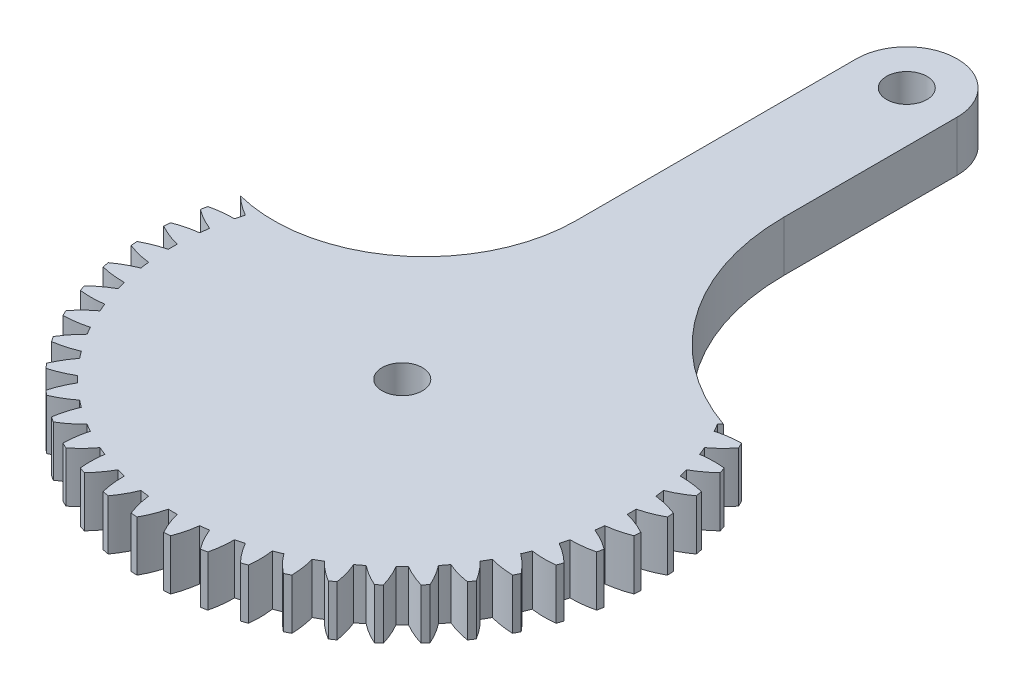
ISO-10303-21;
HEADER;
FILE_DESCRIPTION(('STEP AP214'),'2;1');
FILE_NAME('part.step','',(''),(''),'','','');
FILE_SCHEMA(('AUTOMOTIVE_DESIGN { 1 0 10303 214 1 1 1 1 }'));
ENDSEC;
DATA;
#1=APPLICATION_CONTEXT('core data for automotive mechanical design processes');
#2=APPLICATION_PROTOCOL_DEFINITION('international standard','automotive_design',2000,#1);
#3=PRODUCT_CONTEXT('',#1,'mechanical');
#4=PRODUCT('Part','Part','',(#3));
#5=PRODUCT_RELATED_PRODUCT_CATEGORY('part','',(#4));
#6=PRODUCT_DEFINITION_FORMATION('','',#4);
#7=PRODUCT_DEFINITION_CONTEXT('part definition',#1,'design');
#8=PRODUCT_DEFINITION('design','',#6,#7);
#9=PRODUCT_DEFINITION_SHAPE('','',#8);
#10=(LENGTH_UNIT() NAMED_UNIT(*) SI_UNIT(.MILLI.,.METRE.));
#11=(NAMED_UNIT(*) PLANE_ANGLE_UNIT() SI_UNIT($,.RADIAN.));
#12=(NAMED_UNIT(*) SI_UNIT($,.STERADIAN.) SOLID_ANGLE_UNIT());
#13=UNCERTAINTY_MEASURE_WITH_UNIT(LENGTH_MEASURE(1.E-05),#10,'distance_accuracy_value','');
#14=(GEOMETRIC_REPRESENTATION_CONTEXT(3) GLOBAL_UNCERTAINTY_ASSIGNED_CONTEXT((#13)) GLOBAL_UNIT_ASSIGNED_CONTEXT((#10,
#11,#12)) REPRESENTATION_CONTEXT('',''));
#15=CARTESIAN_POINT('',(0.,0.,0.));
#16=DIRECTION('',(0.,0.,1.));
#17=DIRECTION('',(1.,0.,0.));
#18=AXIS2_PLACEMENT_3D('',#15,#16,#17);
#19=CARTESIAN_POINT('',(0.,5.,25.));
#20=DIRECTION('',(0.,-1.,0.));
#21=DIRECTION('',(0.,0.,-1.));
#22=AXIS2_PLACEMENT_3D('',#19,#20,#21);
#23=PLANE('',#22);
#24=CARTESIAN_POINT('',(15.0685153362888,5.,8.2224503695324));
#25=DIRECTION('',(0.,1.,0.));
#26=DIRECTION('',(0.,0.,1.));
#27=AXIS2_PLACEMENT_3D('',#24,#25,#26);
#28=CIRCLE('',#27,9.59999999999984);
#29=CARTESIAN_POINT('',(22.559422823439,5.,14.226307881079));
#30=VERTEX_POINT('',#29);
#31=CARTESIAN_POINT('',(20.8452157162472,5.,15.8898966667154));
#32=VERTEX_POINT('',#31);
#33=EDGE_CURVE('E1612',#30,#32,#28,.F.);
#34=ORIENTED_EDGE('',*,*,#33,.F.);
#35=CARTESIAN_POINT('',(0.,5.,25.));
#36=DIRECTION('',(0.,-1.,0.));
#37=DIRECTION('',(0.,0.,-1.));
#38=AXIS2_PLACEMENT_3D('',#35,#36,#37);
#39=CIRCLE('',#38,25.);
#40=CARTESIAN_POINT('',(22.2806511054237,5.,13.6610147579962));
#41=VERTEX_POINT('',#40);
#42=EDGE_CURVE('E1870',#41,#30,#39,.T.);
#43=ORIENTED_EDGE('',*,*,#42,.F.);
#44=CARTESIAN_POINT('',(22.4836559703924,5.,23.2588681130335));
#45=DIRECTION('',(0.,1.,0.));
#46=DIRECTION('',(0.,0.,1.));
#47=AXIS2_PLACEMENT_3D('',#44,#45,#46);
#48=CIRCLE('',#47,9.60000000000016);
#49=CARTESIAN_POINT('',(19.917294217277,5.,14.0082580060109));
#50=VERTEX_POINT('',#49);
#51=EDGE_CURVE('E1201',#41,#50,#48,.T.);
#52=ORIENTED_EDGE('',*,*,#51,.T.);
#53=CARTESIAN_POINT('',(0.,5.,25.));
#54=DIRECTION('',(0.,1.,0.));
#55=DIRECTION('',(0.,0.,1.));
#56=AXIS2_PLACEMENT_3D('',#53,#54,#55);
#57=CIRCLE('',#56,22.749);
#58=CARTESIAN_POINT('',(19.477774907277,5.,13.2469882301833));
#59=VERTEX_POINT('',#58);
#60=EDGE_CURVE('E1212',#59,#50,#57,.F.);
#61=ORIENTED_EDGE('',*,*,#60,.F.);
#62=CARTESIAN_POINT('',(12.7496924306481,5.,6.39914870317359));
#63=DIRECTION('',(0.,1.,0.));
#64=DIRECTION('',(0.,0.,1.));
#65=AXIS2_PLACEMENT_3D('',#62,#63,#64);
#66=CIRCLE('',#65,9.59999999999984);
#67=CARTESIAN_POINT('',(19.7738254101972,5.,12.9429668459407));
#68=VERTEX_POINT('',#67);
#69=EDGE_CURVE('E1211',#68,#59,#66,.F.);
#70=ORIENTED_EDGE('',*,*,#69,.F.);
#71=CARTESIAN_POINT('',(27.,5.,-7.83640756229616));
#72=DIRECTION('',(0.,-1.,0.));
#73=DIRECTION('',(0.,0.,-1.));
#74=AXIS2_PLACEMENT_3D('',#71,#72,#73);
#75=CIRCLE('',#74,22.);
#76=CARTESIAN_POINT('',(5.,5.,-7.83640756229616));
#77=VERTEX_POINT('',#76);
#78=EDGE_CURVE('E244',#68,#77,#75,.T.);
#79=ORIENTED_EDGE('',*,*,#78,.T.);
#80=DIRECTION('',(0.,0.,-1.));
#81=VECTOR('',#80,1.);
#82=CARTESIAN_POINT('',(5.,5.,25.));
#83=LINE('',#82,#81);
#84=CARTESIAN_POINT('',(5.,5.,-25.));
#85=VERTEX_POINT('',#84);
#86=EDGE_CURVE('E1890',#77,#85,#83,.T.);
#87=ORIENTED_EDGE('',*,*,#86,.T.);
#88=CARTESIAN_POINT('',(0.,5.,-25.));
#89=DIRECTION('',(0.,1.,0.));
#90=DIRECTION('',(0.,0.,1.));
#91=AXIS2_PLACEMENT_3D('',#88,#89,#90);
#92=CIRCLE('',#91,5.);
#93=CARTESIAN_POINT('',(-5.,5.,-25.));
#94=VERTEX_POINT('',#93);
#95=EDGE_CURVE('E1886',#85,#94,#92,.T.);
#96=ORIENTED_EDGE('',*,*,#95,.T.);
#97=DIRECTION('',(0.,0.,1.));
#98=VECTOR('',#97,1.);
#99=CARTESIAN_POINT('',(-5.,5.,25.));
#100=LINE('',#99,#98);
#101=CARTESIAN_POINT('',(-5.,5.,2.75773300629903));
#102=VERTEX_POINT('',#101);
#103=EDGE_CURVE('E1892',#94,#102,#100,.T.);
#104=ORIENTED_EDGE('',*,*,#103,.T.);
#105=CARTESIAN_POINT('',(-20.,5.,2.75773300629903));
#106=DIRECTION('',(0.,-1.,0.));
#107=DIRECTION('',(0.,0.,-1.));
#108=AXIS2_PLACEMENT_3D('',#105,#106,#107);
#109=CIRCLE('',#108,15.);
#110=CARTESIAN_POINT('',(-23.7547738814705,5.,17.2801871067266));
#111=VERTEX_POINT('',#110);
#112=EDGE_CURVE('E1909',#102,#111,#109,.T.);
#113=ORIENTED_EDGE('',*,*,#112,.T.);
#114=CARTESIAN_POINT('',(-17.1295117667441,5.,10.3328205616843));
#115=DIRECTION('',(0.,1.,0.));
#116=DIRECTION('',(0.,0.,1.));
#117=AXIS2_PLACEMENT_3D('',#114,#115,#116);
#118=CIRCLE('',#117,9.60000000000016);
#119=CARTESIAN_POINT('',(-21.8559891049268,5.,18.6886814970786));
#120=VERTEX_POINT('',#119);
#121=EDGE_CURVE('E1764',#111,#120,#118,.T.);
#122=ORIENTED_EDGE('',*,*,#121,.T.);
#123=CARTESIAN_POINT('',(0.,5.,25.));
#124=DIRECTION('',(0.,1.,0.));
#125=DIRECTION('',(0.,0.,1.));
#126=AXIS2_PLACEMENT_3D('',#123,#124,#125);
#127=CIRCLE('',#126,22.749);
#128=CARTESIAN_POINT('',(-22.0835010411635,5.,19.5377676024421));
#129=VERTEX_POINT('',#128);
#130=EDGE_CURVE('E1773',#129,#120,#127,.F.);
#131=ORIENTED_EDGE('',*,*,#130,.F.);
#132=CARTESIAN_POINT('',(-22.1681820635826,5.,29.1373941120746));
#133=DIRECTION('',(0.,1.,0.));
#134=DIRECTION('',(0.,0.,1.));
#135=AXIS2_PLACEMENT_3D('',#132,#133,#134);
#136=CIRCLE('',#135,9.59999999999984);
#137=CARTESIAN_POINT('',(-24.456201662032,5.,19.8140381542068));
#138=VERTEX_POINT('',#137);
#139=EDGE_CURVE('E1776',#138,#129,#136,.F.);
#140=ORIENTED_EDGE('',*,*,#139,.F.);
#141=CARTESIAN_POINT('',(-24.5791658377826,5.,20.4322208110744));
#142=VERTEX_POINT('',#141);
#143=EDGE_CURVE('E1863',#142,#138,#39,.T.);
#144=ORIENTED_EDGE('',*,*,#143,.F.);
#145=CARTESIAN_POINT('',(-18.8974175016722,5.,12.694150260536));
#146=DIRECTION('',(0.,1.,0.));
#147=DIRECTION('',(0.,0.,1.));
#148=AXIS2_PLACEMENT_3D('',#145,#146,#147);
#149=CIRCLE('',#148,9.60000000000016);
#150=CARTESIAN_POINT('',(-22.492800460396,5.,21.5954547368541));
#151=VERTEX_POINT('',#150);
#152=EDGE_CURVE('E1628',#142,#151,#149,.T.);
#153=ORIENTED_EDGE('',*,*,#152,.T.);
#154=CARTESIAN_POINT('',(0.,5.,25.));
#155=DIRECTION('',(0.,1.,0.));
#156=DIRECTION('',(0.,0.,1.));
#157=AXIS2_PLACEMENT_3D('',#154,#155,#156);
#158=CIRCLE('',#157,22.749);
#159=CARTESIAN_POINT('',(-22.607538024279,5.,22.4669730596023));
#160=VERTEX_POINT('',#159);
#161=EDGE_CURVE('E1639',#160,#151,#158,.F.);
#162=ORIENTED_EDGE('',*,*,#161,.F.);
#163=CARTESIAN_POINT('',(-21.4384918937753,5.,31.9955265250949));
#164=DIRECTION('',(0.,1.,0.));
#165=DIRECTION('',(0.,0.,1.));
#166=AXIS2_PLACEMENT_3D('',#163,#164,#165);
#167=CIRCLE('',#166,9.59999999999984);
#168=CARTESIAN_POINT('',(-24.9238793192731,5.,23.0505796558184));
#169=VERTEX_POINT('',#168);
#170=EDGE_CURVE('E1641',#169,#160,#167,.F.);
#171=ORIENTED_EDGE('',*,*,#170,.F.);
#172=CARTESIAN_POINT('',(-24.9651024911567,5.,23.6795237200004));
#173=VERTEX_POINT('',#172);
#174=EDGE_CURVE('E1869',#173,#169,#39,.T.);
#175=ORIENTED_EDGE('',*,*,#174,.F.);
#176=CARTESIAN_POINT('',(-20.3419831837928,5.,15.266036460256));
#177=DIRECTION('',(0.,1.,0.));
#178=DIRECTION('',(0.,0.,1.));
#179=AXIS2_PLACEMENT_3D('',#176,#177,#178);
#180=CIRCLE('',#179,9.60000000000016);
#181=CARTESIAN_POINT('',(-22.7447537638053,5.,24.5604806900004));
#182=VERTEX_POINT('',#181);
#183=EDGE_CURVE('E1656',#173,#182,#180,.T.);
#184=ORIENTED_EDGE('',*,*,#183,.T.);
#185=CARTESIAN_POINT('',(0.,5.,25.));
#186=DIRECTION('',(0.,1.,0.));
#187=DIRECTION('',(0.,0.,1.));
#188=AXIS2_PLACEMENT_3D('',#185,#186,#187);
#189=CIRCLE('',#188,22.749);
#190=CARTESIAN_POINT('',(-22.7447537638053,5.,25.4395193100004));
#191=VERTEX_POINT('',#190);
#192=EDGE_CURVE('E1667',#191,#182,#189,.F.);
#193=ORIENTED_EDGE('',*,*,#192,.F.);
#194=CARTESIAN_POINT('',(-20.3419831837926,5.,34.7339635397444));
#195=DIRECTION('',(0.,1.,0.));
#196=DIRECTION('',(0.,0.,1.));
#197=AXIS2_PLACEMENT_3D('',#194,#195,#196);
#198=CIRCLE('',#197,9.59999999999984);
#199=CARTESIAN_POINT('',(-24.9651024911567,5.,26.3204762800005));
#200=VERTEX_POINT('',#199);
#201=EDGE_CURVE('E1670',#200,#191,#198,.F.);
#202=ORIENTED_EDGE('',*,*,#201,.F.);
#203=CARTESIAN_POINT('',(-24.9238793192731,5.,26.9494203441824));
#204=VERTEX_POINT('',#203);
#205=EDGE_CURVE('E1974',#204,#200,#39,.T.);
#206=ORIENTED_EDGE('',*,*,#205,.F.);
#207=CARTESIAN_POINT('',(-21.4384918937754,5.,18.0044734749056));
#208=DIRECTION('',(0.,1.,0.));
#209=DIRECTION('',(0.,0.,1.));
#210=AXIS2_PLACEMENT_3D('',#207,#208,#209);
#211=CIRCLE('',#210,9.60000000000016);
#212=CARTESIAN_POINT('',(-22.6075380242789,5.,27.5330269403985));
#213=VERTEX_POINT('',#212);
#214=EDGE_CURVE('E1684',#204,#213,#211,.T.);
#215=ORIENTED_EDGE('',*,*,#214,.T.);
#216=CARTESIAN_POINT('',(0.,5.,25.));
#217=DIRECTION('',(0.,1.,0.));
#218=DIRECTION('',(0.,0.,1.));
#219=AXIS2_PLACEMENT_3D('',#216,#217,#218);
#220=CIRCLE('',#219,22.749);
#221=CARTESIAN_POINT('',(-22.4928004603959,5.,28.4045452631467));
#222=VERTEX_POINT('',#221);
#223=EDGE_CURVE('E1692',#222,#213,#220,.F.);
#224=ORIENTED_EDGE('',*,*,#223,.F.);
#225=CARTESIAN_POINT('',(-18.897417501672,5.,37.3058497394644));
#226=DIRECTION('',(0.,1.,0.));
#227=DIRECTION('',(0.,0.,1.));
#228=AXIS2_PLACEMENT_3D('',#225,#226,#227);
#229=CIRCLE('',#228,9.59999999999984);
#230=CARTESIAN_POINT('',(-24.5791658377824,5.,29.5677791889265));
#231=VERTEX_POINT('',#230);
#232=EDGE_CURVE('E1700',#231,#222,#229,.F.);
#233=ORIENTED_EDGE('',*,*,#232,.F.);
#234=CARTESIAN_POINT('',(-24.4562016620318,5.,30.1859618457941));
#235=VERTEX_POINT('',#234);
#236=EDGE_CURVE('E1980',#235,#231,#39,.T.);
#237=ORIENTED_EDGE('',*,*,#236,.F.);
#238=CARTESIAN_POINT('',(-22.1681820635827,5.,20.8626058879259));
#239=DIRECTION('',(0.,1.,0.));
#240=DIRECTION('',(0.,0.,1.));
#241=AXIS2_PLACEMENT_3D('',#238,#239,#240);
#242=CIRCLE('',#241,9.60000000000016);
#243=CARTESIAN_POINT('',(-22.0835010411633,5.,30.4622323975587));
#244=VERTEX_POINT('',#243);
#245=EDGE_CURVE('E1708',#235,#244,#242,.T.);
#246=ORIENTED_EDGE('',*,*,#245,.T.);
#247=CARTESIAN_POINT('',(0.,5.,25.));
#248=DIRECTION('',(0.,1.,0.));
#249=DIRECTION('',(0.,0.,1.));
#250=AXIS2_PLACEMENT_3D('',#247,#248,#249);
#251=CIRCLE('',#250,22.749);
#252=CARTESIAN_POINT('',(-21.8559891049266,5.,31.3113185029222));
#253=VERTEX_POINT('',#252);
#254=EDGE_CURVE('E1718',#253,#244,#251,.F.);
#255=ORIENTED_EDGE('',*,*,#254,.F.);
#256=CARTESIAN_POINT('',(-17.1295117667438,5.,39.6671794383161));
#257=DIRECTION('',(0.,1.,0.));
#258=DIRECTION('',(0.,0.,1.));
#259=AXIS2_PLACEMENT_3D('',#256,#257,#258);
#260=CIRCLE('',#259,9.59999999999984);
#261=CARTESIAN_POINT('',(-23.7726728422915,5.,32.7369261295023));
#262=VERTEX_POINT('',#261);
#263=EDGE_CURVE('E1725',#262,#253,#260,.F.);
#264=ORIENTED_EDGE('',*,*,#263,.F.);
#265=CARTESIAN_POINT('',(-23.5700716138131,5.,33.3337701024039));
#266=VERTEX_POINT('',#265);
#267=EDGE_CURVE('E1982',#266,#262,#39,.T.);
#268=ORIENTED_EDGE('',*,*,#267,.F.);
#269=CARTESIAN_POINT('',(-22.5185684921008,5.,23.7915302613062));
#270=DIRECTION('',(0.,1.,0.));
#271=DIRECTION('',(0.,0.,1.));
#272=AXIS2_PLACEMENT_3D('',#269,#270,#271);
#273=CIRCLE('',#272,9.60000000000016);
#274=CARTESIAN_POINT('',(-21.1816092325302,5.,33.2979775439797));
#275=VERTEX_POINT('',#274);
#276=EDGE_CURVE('E1418',#266,#275,#273,.T.);
#277=ORIENTED_EDGE('',*,*,#276,.T.);
#278=CARTESIAN_POINT('',(0.,5.,25.));
#279=DIRECTION('',(0.,1.,0.));
#280=DIRECTION('',(0.,0.,1.));
#281=AXIS2_PLACEMENT_3D('',#278,#279,#280);
#282=CIRCLE('',#281,22.749);
#283=CARTESIAN_POINT('',(-20.8452157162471,5.,34.1101033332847));
#284=VERTEX_POINT('',#283);
#285=EDGE_CURVE('E1429',#284,#275,#282,.F.);
#286=ORIENTED_EDGE('',*,*,#285,.F.);
#287=CARTESIAN_POINT('',(-15.0685153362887,5.,41.7775496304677));
#288=DIRECTION('',(0.,1.,0.));
#289=DIRECTION('',(0.,0.,1.));
#290=AXIS2_PLACEMENT_3D('',#287,#288,#289);
#291=CIRCLE('',#290,9.59999999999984);
#292=CARTESIAN_POINT('',(-22.5594228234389,5.,35.7736921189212));
#293=VERTEX_POINT('',#292);
#294=EDGE_CURVE('E1432',#293,#284,#291,.F.);
#295=ORIENTED_EDGE('',*,*,#294,.F.);
#296=CARTESIAN_POINT('',(-22.2806511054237,5.,36.338985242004));
#297=VERTEX_POINT('',#296);
#298=EDGE_CURVE('E1990',#297,#293,#39,.T.);
#299=ORIENTED_EDGE('',*,*,#298,.F.);
#300=CARTESIAN_POINT('',(-22.4836559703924,5.,26.7411318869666));
#301=DIRECTION('',(0.,1.,0.));
#302=DIRECTION('',(0.,0.,1.));
#303=AXIS2_PLACEMENT_3D('',#300,#301,#302);
#304=CIRCLE('',#303,9.60000000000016);
#305=CARTESIAN_POINT('',(-19.9172942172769,5.,35.9917419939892));
#306=VERTEX_POINT('',#305);
#307=EDGE_CURVE('E1448',#297,#306,#304,.T.);
#308=ORIENTED_EDGE('',*,*,#307,.T.);
#309=CARTESIAN_POINT('',(0.,5.,25.));
#310=DIRECTION('',(0.,1.,0.));
#311=DIRECTION('',(0.,0.,1.));
#312=AXIS2_PLACEMENT_3D('',#309,#310,#311);
#313=CIRCLE('',#312,22.749);
#314=CARTESIAN_POINT('',(-19.4777749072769,5.,36.7530117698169));
#315=VERTEX_POINT('',#314);
#316=EDGE_CURVE('E1457',#315,#306,#313,.F.);
#317=ORIENTED_EDGE('',*,*,#316,.F.);
#318=CARTESIAN_POINT('',(-12.749692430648,5.,43.6008512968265));
#319=DIRECTION('',(0.,1.,0.));
#320=DIRECTION('',(0.,0.,1.));
#321=AXIS2_PLACEMENT_3D('',#318,#319,#320);
#322=CIRCLE('',#321,9.59999999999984);
#323=CARTESIAN_POINT('',(-20.9601748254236,5.,38.6261172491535));
#324=VERTEX_POINT('',#323);
#325=EDGE_CURVE('E1459',#324,#315,#322,.F.);
#326=ORIENTED_EDGE('',*,*,#325,.F.);
#327=CARTESIAN_POINT('',(-20.6100024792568,5.,39.1501872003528));
#328=VERTEX_POINT('',#327);
#329=EDGE_CURVE('E1995',#328,#324,#39,.T.);
#330=ORIENTED_EDGE('',*,*,#329,.F.);
#331=CARTESIAN_POINT('',(-22.0640418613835,5.,29.6609422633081));
#332=DIRECTION('',(0.,1.,0.));
#333=DIRECTION('',(0.,0.,1.));
#334=AXIS2_PLACEMENT_3D('',#331,#332,#333);
#335=CIRCLE('',#334,9.60000000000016);
#336=CARTESIAN_POINT('',(-18.3121887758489,5.,38.497434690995));
#337=VERTEX_POINT('',#336);
#338=EDGE_CURVE('E1740',#328,#337,#335,.T.);
#339=ORIENTED_EDGE('',*,*,#338,.T.);
#340=CARTESIAN_POINT('',(0.,5.,25.));
#341=DIRECTION('',(0.,1.,0.));
#342=DIRECTION('',(0.,0.,1.));
#343=AXIS2_PLACEMENT_3D('',#340,#341,#342);
#344=CIRCLE('',#343,22.749);
#345=CARTESIAN_POINT('',(-17.7770639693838,5.,39.194822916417));
#346=VERTEX_POINT('',#345);
#347=EDGE_CURVE('E1746',#346,#337,#344,.F.);
#348=ORIENTED_EDGE('',*,*,#347,.F.);
#349=CARTESIAN_POINT('',(-10.2127187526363,5.,45.1058872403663));
#350=DIRECTION('',(0.,1.,0.));
#351=DIRECTION('',(0.,0.,1.));
#352=AXIS2_PLACEMENT_3D('',#349,#350,#351);
#353=CIRCLE('',#352,9.59999999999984);
#354=CARTESIAN_POINT('',(-19.002292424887,5.,41.2453957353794));
#355=VERTEX_POINT('',#354);
#356=EDGE_CURVE('E1747',#355,#346,#353,.F.);
#357=ORIENTED_EDGE('',*,*,#356,.F.);
#358=CARTESIAN_POINT('',(-18.5867109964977,5.,41.7192755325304));
#359=VERTEX_POINT('',#358);
#360=EDGE_CURVE('E2000',#359,#355,#39,.T.);
#361=ORIENTED_EDGE('',*,*,#360,.F.);
#362=CARTESIAN_POINT('',(-21.2669058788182,5.,32.501002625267));
#363=DIRECTION('',(0.,1.,0.));
#364=DIRECTION('',(0.,0.,1.));
#365=AXIS2_PLACEMENT_3D('',#362,#363,#364);
#366=CIRCLE('',#365,9.60000000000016);
#367=CARTESIAN_POINT('',(-16.3937567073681,5.,40.7721825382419));
#368=VERTEX_POINT('',#367);
#369=EDGE_CURVE('E1819',#359,#368,#366,.T.);
#370=ORIENTED_EDGE('',*,*,#369,.T.);
#371=CARTESIAN_POINT('',(0.,5.,25.));
#372=DIRECTION('',(0.,1.,0.));
#373=DIRECTION('',(0.,0.,1.));
#374=AXIS2_PLACEMENT_3D('',#371,#372,#373);
#375=CIRCLE('',#374,22.749);
#376=CARTESIAN_POINT('',(-15.7721825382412,5.,41.3937567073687));
#377=VERTEX_POINT('',#376);
#378=EDGE_CURVE('E1830',#377,#368,#375,.F.);
#379=ORIENTED_EDGE('',*,*,#378,.F.);
#380=CARTESIAN_POINT('',(-7.50100262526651,5.,46.2669058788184));
#381=DIRECTION('',(0.,1.,0.));
#382=DIRECTION('',(0.,0.,1.));
#383=AXIS2_PLACEMENT_3D('',#380,#381,#382);
#384=CIRCLE('',#383,9.59999999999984);
#385=CARTESIAN_POINT('',(-16.7192755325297,5.,43.5867109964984));
#386=VERTEX_POINT('',#385);
#387=EDGE_CURVE('E1828',#386,#377,#384,.F.);
#388=ORIENTED_EDGE('',*,*,#387,.F.);
#389=CARTESIAN_POINT('',(-16.2453957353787,5.,44.0022924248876));
#390=VERTEX_POINT('',#389);
#391=EDGE_CURVE('E2005',#390,#386,#39,.T.);
#392=ORIENTED_EDGE('',*,*,#391,.F.);
#393=CARTESIAN_POINT('',(-20.105887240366,5.,35.2127187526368));
#394=DIRECTION('',(0.,1.,0.));
#395=DIRECTION('',(0.,0.,1.));
#396=AXIS2_PLACEMENT_3D('',#393,#394,#395);
#397=CIRCLE('',#396,9.60000000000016);
#398=CARTESIAN_POINT('',(-14.1948229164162,5.,42.7770639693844));
#399=VERTEX_POINT('',#398);
#400=EDGE_CURVE('E1847',#390,#399,#397,.T.);
#401=ORIENTED_EDGE('',*,*,#400,.T.);
#402=CARTESIAN_POINT('',(0.,5.,25.));
#403=DIRECTION('',(0.,1.,0.));
#404=DIRECTION('',(0.,0.,1.));
#405=AXIS2_PLACEMENT_3D('',#402,#403,#404);
#406=CIRCLE('',#405,22.749);
#407=CARTESIAN_POINT('',(-13.4974346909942,5.,43.3121887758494));
#408=VERTEX_POINT('',#407);
#409=EDGE_CURVE('E1846',#408,#399,#406,.F.);
#410=ORIENTED_EDGE('',*,*,#409,.F.);
#411=CARTESIAN_POINT('',(-4.66094226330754,5.,47.0640418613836));
#412=DIRECTION('',(0.,1.,0.));
#413=DIRECTION('',(0.,0.,1.));
#414=AXIS2_PLACEMENT_3D('',#411,#412,#413);
#415=CIRCLE('',#414,9.59999999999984);
#416=CARTESIAN_POINT('',(-14.1501872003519,5.,45.6100024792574));
#417=VERTEX_POINT('',#416);
#418=EDGE_CURVE('E1843',#417,#408,#415,.F.);
#419=ORIENTED_EDGE('',*,*,#418,.F.);
#420=CARTESIAN_POINT('',(-13.6261172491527,5.,45.9601748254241));
#421=VERTEX_POINT('',#420);
#422=EDGE_CURVE('E2010',#421,#417,#39,.T.);
#423=ORIENTED_EDGE('',*,*,#422,.F.);
#424=CARTESIAN_POINT('',(-18.6008512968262,5.,37.7496924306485));
#425=DIRECTION('',(0.,1.,0.));
#426=DIRECTION('',(0.,0.,1.));
#427=AXIS2_PLACEMENT_3D('',#424,#425,#426);
#428=CIRCLE('',#427,9.60000000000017);
#429=CARTESIAN_POINT('',(-11.7530117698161,5.,44.4777749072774));
#430=VERTEX_POINT('',#429);
#431=EDGE_CURVE('E1791',#421,#430,#428,.T.);
#432=ORIENTED_EDGE('',*,*,#431,.T.);
#433=CARTESIAN_POINT('',(0.,5.,25.));
#434=DIRECTION('',(0.,1.,0.));
#435=DIRECTION('',(0.,0.,1.));
#436=AXIS2_PLACEMENT_3D('',#433,#434,#435);
#437=CIRCLE('',#436,22.749);
#438=CARTESIAN_POINT('',(-10.9917419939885,5.,44.9172942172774));
#439=VERTEX_POINT('',#438);
#440=EDGE_CURVE('E1799',#439,#430,#437,.F.);
#441=ORIENTED_EDGE('',*,*,#440,.F.);
#442=CARTESIAN_POINT('',(-1.74113188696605,5.,47.4836559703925));
#443=DIRECTION('',(0.,1.,0.));
#444=DIRECTION('',(0.,0.,1.));
#445=AXIS2_PLACEMENT_3D('',#442,#443,#444);
#446=CIRCLE('',#445,9.59999999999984);
#447=CARTESIAN_POINT('',(-11.3389852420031,5.,47.2806511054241));
#448=VERTEX_POINT('',#447);
#449=EDGE_CURVE('E1804',#448,#439,#446,.F.);
#450=ORIENTED_EDGE('',*,*,#449,.F.);
#451=CARTESIAN_POINT('',(-10.7736921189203,5.,47.5594228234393));
#452=VERTEX_POINT('',#451);
#453=EDGE_CURVE('E2015',#452,#448,#39,.T.);
#454=ORIENTED_EDGE('',*,*,#453,.F.);
#455=CARTESIAN_POINT('',(-16.7775496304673,5.,40.0685153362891));
#456=DIRECTION('',(0.,1.,0.));
#457=DIRECTION('',(0.,0.,1.));
#458=AXIS2_PLACEMENT_3D('',#455,#456,#457);
#459=CIRCLE('',#458,9.60000000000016);
#460=CARTESIAN_POINT('',(-9.11010333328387,5.,45.8452157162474));
#461=VERTEX_POINT('',#460);
#462=EDGE_CURVE('E1474',#452,#461,#459,.T.);
#463=ORIENTED_EDGE('',*,*,#462,.T.);
#464=CARTESIAN_POINT('',(0.,5.,25.));
#465=DIRECTION('',(0.,1.,0.));
#466=DIRECTION('',(0.,0.,1.));
#467=AXIS2_PLACEMENT_3D('',#464,#465,#466);
#468=CIRCLE('',#467,22.749);
#469=CARTESIAN_POINT('',(-8.2979775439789,5.,46.1816092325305));
#470=VERTEX_POINT('',#469);
#471=EDGE_CURVE('E1481',#470,#461,#468,.F.);
#472=ORIENTED_EDGE('',*,*,#471,.F.);
#473=CARTESIAN_POINT('',(1.20846973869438,5.,47.5185684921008));
#474=DIRECTION('',(0.,1.,0.));
#475=DIRECTION('',(0.,0.,1.));
#476=AXIS2_PLACEMENT_3D('',#473,#474,#475);
#477=CIRCLE('',#476,9.59999999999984);
#478=CARTESIAN_POINT('',(-8.33377010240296,5.,48.5700716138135));
#479=VERTEX_POINT('',#478);
#480=EDGE_CURVE('E1490',#479,#470,#477,.F.);
#481=ORIENTED_EDGE('',*,*,#480,.F.);
#482=CARTESIAN_POINT('',(-7.73692612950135,5.,48.7726728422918));
#483=VERTEX_POINT('',#482);
#484=EDGE_CURVE('E2017',#483,#479,#39,.T.);
#485=ORIENTED_EDGE('',*,*,#484,.F.);
#486=CARTESIAN_POINT('',(-14.6671794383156,5.,42.1295117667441));
#487=DIRECTION('',(0.,1.,0.));
#488=DIRECTION('',(0.,0.,1.));
#489=AXIS2_PLACEMENT_3D('',#486,#487,#488);
#490=CIRCLE('',#489,9.60000000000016);
#491=CARTESIAN_POINT('',(-6.31131850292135,5.,46.8559891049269));
#492=VERTEX_POINT('',#491);
#493=EDGE_CURVE('E1505',#483,#492,#490,.T.);
#494=ORIENTED_EDGE('',*,*,#493,.T.);
#495=CARTESIAN_POINT('',(0.,5.,25.));
#496=DIRECTION('',(0.,1.,0.));
#497=DIRECTION('',(0.,0.,1.));
#498=AXIS2_PLACEMENT_3D('',#495,#496,#497);
#499=CIRCLE('',#498,22.749);
#500=CARTESIAN_POINT('',(-5.46223239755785,5.,47.0835010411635));
#501=VERTEX_POINT('',#500);
#502=EDGE_CURVE('E1512',#501,#492,#499,.F.);
#503=ORIENTED_EDGE('',*,*,#502,.F.);
#504=CARTESIAN_POINT('',(4.13739411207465,5.,47.1681820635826));
#505=DIRECTION('',(0.,1.,0.));
#506=DIRECTION('',(0.,0.,1.));
#507=AXIS2_PLACEMENT_3D('',#504,#505,#506);
#508=CIRCLE('',#507,9.59999999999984);
#509=CARTESIAN_POINT('',(-5.1859618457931,5.,49.456201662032));
#510=VERTEX_POINT('',#509);
#511=EDGE_CURVE('E1511',#510,#501,#508,.F.);
#512=ORIENTED_EDGE('',*,*,#511,.F.);
#513=CARTESIAN_POINT('',(-4.56777918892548,5.,49.5791658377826));
#514=VERTEX_POINT('',#513);
#515=EDGE_CURVE('E2025',#514,#510,#39,.T.);
#516=ORIENTED_EDGE('',*,*,#515,.F.);
#517=CARTESIAN_POINT('',(-12.305849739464,5.,43.8974175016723));
#518=DIRECTION('',(0.,1.,0.));
#519=DIRECTION('',(0.,0.,1.));
#520=AXIS2_PLACEMENT_3D('',#517,#518,#519);
#521=CIRCLE('',#520,9.60000000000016);
#522=CARTESIAN_POINT('',(-3.40454526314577,5.,47.492800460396));
#523=VERTEX_POINT('',#522);
#524=EDGE_CURVE('E1526',#514,#523,#521,.T.);
#525=ORIENTED_EDGE('',*,*,#524,.T.);
#526=CARTESIAN_POINT('',(0.,5.,25.));
#527=DIRECTION('',(0.,1.,0.));
#528=DIRECTION('',(0.,0.,1.));
#529=AXIS2_PLACEMENT_3D('',#526,#527,#528);
#530=CIRCLE('',#529,22.749);
#531=CARTESIAN_POINT('',(-2.53302694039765,5.,47.607538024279));
#532=VERTEX_POINT('',#531);
#533=EDGE_CURVE('E1536',#532,#523,#530,.F.);
#534=ORIENTED_EDGE('',*,*,#533,.F.);
#535=CARTESIAN_POINT('',(6.99552652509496,5.,46.4384918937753));
#536=DIRECTION('',(0.,1.,0.));
#537=DIRECTION('',(0.,0.,1.));
#538=AXIS2_PLACEMENT_3D('',#535,#536,#537);
#539=CIRCLE('',#538,9.59999999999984);
#540=CARTESIAN_POINT('',(-1.94942034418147,5.,49.9238793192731));
#541=VERTEX_POINT('',#540);
#542=EDGE_CURVE('E1541',#541,#532,#539,.F.);
#543=ORIENTED_EDGE('',*,*,#542,.F.);
#544=CARTESIAN_POINT('',(-1.32047627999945,5.,49.9651024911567));
#545=VERTEX_POINT('',#544);
#546=EDGE_CURVE('E2030',#545,#541,#39,.T.);
#547=ORIENTED_EDGE('',*,*,#546,.F.);
#548=CARTESIAN_POINT('',(-9.73396353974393,5.,45.3419831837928));
#549=DIRECTION('',(0.,1.,0.));
#550=DIRECTION('',(0.,0.,1.));
#551=AXIS2_PLACEMENT_3D('',#548,#549,#550);
#552=CIRCLE('',#551,9.60000000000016);
#553=CARTESIAN_POINT('',(-0.439519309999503,5.,47.7447537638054));
#554=VERTEX_POINT('',#553);
#555=EDGE_CURVE('E1563',#545,#554,#552,.T.);
#556=ORIENTED_EDGE('',*,*,#555,.T.);
#557=CARTESIAN_POINT('',(0.,5.,25.));
#558=DIRECTION('',(0.,1.,0.));
#559=DIRECTION('',(0.,0.,1.));
#560=AXIS2_PLACEMENT_3D('',#557,#558,#559);
#561=CIRCLE('',#560,22.749);
#562=CARTESIAN_POINT('',(0.439519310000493,5.,47.7447537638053));
#563=VERTEX_POINT('',#562);
#564=EDGE_CURVE('E1555',#563,#554,#561,.F.);
#565=ORIENTED_EDGE('',*,*,#564,.F.);
#566=CARTESIAN_POINT('',(9.73396353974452,5.,45.3419831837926));
#567=DIRECTION('',(0.,1.,0.));
#568=DIRECTION('',(0.,0.,1.));
#569=AXIS2_PLACEMENT_3D('',#566,#567,#568);
#570=CIRCLE('',#569,9.59999999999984);
#571=CARTESIAN_POINT('',(1.32047628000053,5.,49.9651024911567));
#572=VERTEX_POINT('',#571);
#573=EDGE_CURVE('E1565',#572,#563,#570,.F.);
#574=ORIENTED_EDGE('',*,*,#573,.F.);
#575=CARTESIAN_POINT('',(1.94942034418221,5.,49.9238793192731));
#576=VERTEX_POINT('',#575);
#577=EDGE_CURVE('E2035',#576,#572,#39,.T.);
#578=ORIENTED_EDGE('',*,*,#577,.F.);
#579=CARTESIAN_POINT('',(-6.99552652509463,5.,46.4384918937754));
#580=DIRECTION('',(0.,1.,0.));
#581=DIRECTION('',(0.,0.,1.));
#582=AXIS2_PLACEMENT_3D('',#579,#580,#581);
#583=CIRCLE('',#582,9.60000000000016);
#584=CARTESIAN_POINT('',(2.53302694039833,5.,47.6075380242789));
#585=VERTEX_POINT('',#584);
#586=EDGE_CURVE('E1164',#576,#585,#583,.T.);
#587=ORIENTED_EDGE('',*,*,#586,.T.);
#588=CARTESIAN_POINT('',(0.,5.,25.));
#589=DIRECTION('',(0.,-1.,0.));
#590=DIRECTION('',(0.,0.,-1.));
#591=AXIS2_PLACEMENT_3D('',#588,#589,#590);
#592=CIRCLE('',#591,22.749);
#593=CARTESIAN_POINT('',(3.40454526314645,5.,47.4928004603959));
#594=VERTEX_POINT('',#593);
#595=EDGE_CURVE('E1163',#594,#585,#592,.T.);
#596=ORIENTED_EDGE('',*,*,#595,.F.);
#597=CARTESIAN_POINT('',(12.3058497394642,5.,43.8974175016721));
#598=DIRECTION('',(0.,-1.,0.));
#599=DIRECTION('',(0.,0.,-1.));
#600=AXIS2_PLACEMENT_3D('',#597,#598,#599);
#601=CIRCLE('',#600,9.59999999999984);
#602=CARTESIAN_POINT('',(4.56777918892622,5.,49.5791658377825));
#603=VERTEX_POINT('',#602);
#604=EDGE_CURVE('E1156',#603,#594,#601,.T.);
#605=ORIENTED_EDGE('',*,*,#604,.F.);
#606=CARTESIAN_POINT('',(5.18596184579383,5.,49.4562016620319));
#607=VERTEX_POINT('',#606);
#608=EDGE_CURVE('E2040',#607,#603,#39,.T.);
#609=ORIENTED_EDGE('',*,*,#608,.F.);
#610=CARTESIAN_POINT('',(-4.13739411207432,5.,47.1681820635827));
#611=DIRECTION('',(0.,1.,0.));
#612=DIRECTION('',(0.,0.,1.));
#613=AXIS2_PLACEMENT_3D('',#610,#611,#612);
#614=CIRCLE('',#613,9.60000000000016);
#615=CARTESIAN_POINT('',(5.4622323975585,5.,47.0835010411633));
#616=VERTEX_POINT('',#615);
#617=EDGE_CURVE('E1581',#607,#616,#614,.T.);
#618=ORIENTED_EDGE('',*,*,#617,.T.);
#619=CARTESIAN_POINT('',(0.,5.,25.));
#620=DIRECTION('',(0.,1.,0.));
#621=DIRECTION('',(0.,0.,1.));
#622=AXIS2_PLACEMENT_3D('',#619,#620,#621);
#623=CIRCLE('',#622,22.749);
#624=CARTESIAN_POINT('',(6.311318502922,5.,46.8559891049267));
#625=VERTEX_POINT('',#624);
#626=EDGE_CURVE('E1591',#625,#616,#623,.F.);
#627=ORIENTED_EDGE('',*,*,#626,.F.);
#628=CARTESIAN_POINT('',(14.6671794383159,5.,42.1295117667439));
#629=DIRECTION('',(0.,1.,0.));
#630=DIRECTION('',(0.,0.,1.));
#631=AXIS2_PLACEMENT_3D('',#628,#629,#630);
#632=CIRCLE('',#631,9.59999999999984);
#633=CARTESIAN_POINT('',(7.73692612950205,5.,48.7726728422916));
#634=VERTEX_POINT('',#633);
#635=EDGE_CURVE('E1594',#634,#625,#632,.F.);
#636=ORIENTED_EDGE('',*,*,#635,.F.);
#637=CARTESIAN_POINT('',(8.33377010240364,5.,48.5700716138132));
#638=VERTEX_POINT('',#637);
#639=EDGE_CURVE('E2042',#638,#634,#39,.T.);
#640=ORIENTED_EDGE('',*,*,#639,.F.);
#641=CARTESIAN_POINT('',(-1.20846973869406,5.,47.5185684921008));
#642=DIRECTION('',(0.,1.,0.));
#643=DIRECTION('',(0.,0.,1.));
#644=AXIS2_PLACEMENT_3D('',#641,#642,#643);
#645=CIRCLE('',#644,9.60000000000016);
#646=CARTESIAN_POINT('',(8.29797754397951,5.,46.1816092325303));
#647=VERTEX_POINT('',#646);
#648=EDGE_CURVE('E1186',#638,#647,#645,.T.);
#649=ORIENTED_EDGE('',*,*,#648,.T.);
#650=CARTESIAN_POINT('',(0.,5.,25.));
#651=DIRECTION('',(0.,-1.,0.));
#652=DIRECTION('',(0.,0.,-1.));
#653=AXIS2_PLACEMENT_3D('',#650,#651,#652);
#654=CIRCLE('',#653,22.749);
#655=CARTESIAN_POINT('',(9.11010333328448,5.,45.8452157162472));
#656=VERTEX_POINT('',#655);
#657=EDGE_CURVE('E1187',#656,#647,#654,.T.);
#658=ORIENTED_EDGE('',*,*,#657,.F.);
#659=CARTESIAN_POINT('',(16.7775496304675,5.,40.0685153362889));
#660=DIRECTION('',(0.,-1.,0.));
#661=DIRECTION('',(0.,0.,-1.));
#662=AXIS2_PLACEMENT_3D('',#659,#660,#661);
#663=CIRCLE('',#662,9.59999999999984);
#664=CARTESIAN_POINT('',(10.7736921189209,5.,47.559422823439));
#665=VERTEX_POINT('',#664);
#666=EDGE_CURVE('E1184',#665,#656,#663,.T.);
#667=ORIENTED_EDGE('',*,*,#666,.F.);
#668=CARTESIAN_POINT('',(11.3389852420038,5.,47.2806511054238));
#669=VERTEX_POINT('',#668);
#670=EDGE_CURVE('E2050',#669,#665,#39,.T.);
#671=ORIENTED_EDGE('',*,*,#670,.F.);
#672=CARTESIAN_POINT('',(1.74113188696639,5.,47.4836559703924));
#673=DIRECTION('',(0.,1.,0.));
#674=DIRECTION('',(0.,0.,1.));
#675=AXIS2_PLACEMENT_3D('',#672,#673,#674);
#676=CIRCLE('',#675,9.60000000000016);
#677=CARTESIAN_POINT('',(10.991741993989,5.,44.9172942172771));
#678=VERTEX_POINT('',#677);
#679=EDGE_CURVE('E1076',#669,#678,#676,.T.);
#680=ORIENTED_EDGE('',*,*,#679,.T.);
#681=CARTESIAN_POINT('',(0.,5.,25.));
#682=DIRECTION('',(0.,-1.,0.));
#683=DIRECTION('',(0.,0.,-1.));
#684=AXIS2_PLACEMENT_3D('',#681,#682,#683);
#685=CIRCLE('',#684,22.749);
#686=CARTESIAN_POINT('',(11.7530117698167,5.,44.4777749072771));
#687=VERTEX_POINT('',#686);
#688=EDGE_CURVE('E1077',#687,#678,#685,.T.);
#689=ORIENTED_EDGE('',*,*,#688,.F.);
#690=CARTESIAN_POINT('',(18.6008512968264,5.,37.7496924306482));
#691=DIRECTION('',(0.,-1.,0.));
#692=DIRECTION('',(0.,0.,-1.));
#693=AXIS2_PLACEMENT_3D('',#690,#691,#692);
#694=CIRCLE('',#693,9.59999999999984);
#695=CARTESIAN_POINT('',(13.6261172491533,5.,45.9601748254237));
#696=VERTEX_POINT('',#695);
#697=EDGE_CURVE('E1073',#696,#687,#694,.T.);
#698=ORIENTED_EDGE('',*,*,#697,.F.);
#699=CARTESIAN_POINT('',(14.1501872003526,5.,45.610002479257));
#700=VERTEX_POINT('',#699);
#701=EDGE_CURVE('E2055',#700,#696,#39,.T.);
#702=ORIENTED_EDGE('',*,*,#701,.F.);
#703=CARTESIAN_POINT('',(4.66094226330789,5.,47.0640418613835));
#704=DIRECTION('',(0.,1.,0.));
#705=DIRECTION('',(0.,0.,1.));
#706=AXIS2_PLACEMENT_3D('',#703,#704,#705);
#707=CIRCLE('',#706,9.60000000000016);
#708=CARTESIAN_POINT('',(13.4974346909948,5.,43.312188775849));
#709=VERTEX_POINT('',#708);
#710=EDGE_CURVE('E1056',#700,#709,#707,.T.);
#711=ORIENTED_EDGE('',*,*,#710,.T.);
#712=CARTESIAN_POINT('',(0.,5.,25.));
#713=DIRECTION('',(0.,-1.,0.));
#714=DIRECTION('',(0.,0.,-1.));
#715=AXIS2_PLACEMENT_3D('',#712,#713,#714);
#716=CIRCLE('',#715,22.749);
#717=CARTESIAN_POINT('',(14.1948229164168,5.,42.777063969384));
#718=VERTEX_POINT('',#717);
#719=EDGE_CURVE('E1057',#718,#709,#716,.T.);
#720=ORIENTED_EDGE('',*,*,#719,.F.);
#721=CARTESIAN_POINT('',(20.1058872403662,5.,35.2127187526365));
#722=DIRECTION('',(0.,-1.,0.));
#723=DIRECTION('',(0.,0.,-1.));
#724=AXIS2_PLACEMENT_3D('',#721,#722,#723);
#725=CIRCLE('',#724,9.59999999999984);
#726=CARTESIAN_POINT('',(16.2453957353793,5.,44.0022924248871));
#727=VERTEX_POINT('',#726);
#728=EDGE_CURVE('E1039',#727,#718,#725,.T.);
#729=ORIENTED_EDGE('',*,*,#728,.F.);
#730=CARTESIAN_POINT('',(16.7192755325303,5.,43.5867109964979));
#731=VERTEX_POINT('',#730);
#732=EDGE_CURVE('E2057',#731,#727,#39,.T.);
#733=ORIENTED_EDGE('',*,*,#732,.F.);
#734=CARTESIAN_POINT('',(7.50100262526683,5.,46.2669058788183));
#735=DIRECTION('',(0.,1.,0.));
#736=DIRECTION('',(0.,0.,1.));
#737=AXIS2_PLACEMENT_3D('',#734,#735,#736);
#738=CIRCLE('',#737,9.60000000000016);
#739=CARTESIAN_POINT('',(15.7721825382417,5.,41.3937567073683));
#740=VERTEX_POINT('',#739);
#741=EDGE_CURVE('E1395',#731,#740,#738,.T.);
#742=ORIENTED_EDGE('',*,*,#741,.T.);
#743=CARTESIAN_POINT('',(0.,5.,25.));
#744=DIRECTION('',(0.,1.,0.));
#745=DIRECTION('',(0.,0.,1.));
#746=AXIS2_PLACEMENT_3D('',#743,#744,#745);
#747=CIRCLE('',#746,22.749);
#748=CARTESIAN_POINT('',(16.3937567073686,5.,40.7721825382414));
#749=VERTEX_POINT('',#748);
#750=EDGE_CURVE('E1401',#749,#740,#747,.F.);
#751=ORIENTED_EDGE('',*,*,#750,.F.);
#752=CARTESIAN_POINT('',(21.2669058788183,5.,32.5010026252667));
#753=DIRECTION('',(0.,1.,0.));
#754=DIRECTION('',(0.,0.,1.));
#755=AXIS2_PLACEMENT_3D('',#752,#753,#754);
#756=CIRCLE('',#755,9.59999999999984);
#757=CARTESIAN_POINT('',(18.5867109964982,5.,41.7192755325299));
#758=VERTEX_POINT('',#757);
#759=EDGE_CURVE('E1403',#758,#749,#756,.F.);
#760=ORIENTED_EDGE('',*,*,#759,.F.);
#761=CARTESIAN_POINT('',(19.0022924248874,5.,41.2453957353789));
#762=VERTEX_POINT('',#761);
#763=EDGE_CURVE('E2065',#762,#758,#39,.T.);
#764=ORIENTED_EDGE('',*,*,#763,.F.);
#765=CARTESIAN_POINT('',(10.2127187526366,5.,45.1058872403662));
#766=DIRECTION('',(0.,1.,0.));
#767=DIRECTION('',(0.,0.,1.));
#768=AXIS2_PLACEMENT_3D('',#765,#766,#767);
#769=CIRCLE('',#768,9.60000000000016);
#770=CARTESIAN_POINT('',(17.7770639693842,5.,39.1948229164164));
#771=VERTEX_POINT('',#770);
#772=EDGE_CURVE('E1339',#762,#771,#769,.T.);
#773=ORIENTED_EDGE('',*,*,#772,.T.);
#774=CARTESIAN_POINT('',(0.,5.,25.));
#775=DIRECTION('',(0.,1.,0.));
#776=DIRECTION('',(0.,0.,1.));
#777=AXIS2_PLACEMENT_3D('',#774,#775,#776);
#778=CIRCLE('',#777,22.749);
#779=CARTESIAN_POINT('',(18.3121887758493,5.,38.4974346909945));
#780=VERTEX_POINT('',#779);
#781=EDGE_CURVE('E1350',#780,#771,#778,.F.);
#782=ORIENTED_EDGE('',*,*,#781,.F.);
#783=CARTESIAN_POINT('',(22.0640418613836,5.,29.6609422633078));
#784=DIRECTION('',(0.,1.,0.));
#785=DIRECTION('',(0.,0.,1.));
#786=AXIS2_PLACEMENT_3D('',#783,#784,#785);
#787=CIRCLE('',#786,9.59999999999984);
#788=CARTESIAN_POINT('',(20.6100024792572,5.,39.1501872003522));
#789=VERTEX_POINT('',#788);
#790=EDGE_CURVE('E1349',#789,#780,#787,.F.);
#791=ORIENTED_EDGE('',*,*,#790,.F.);
#792=CARTESIAN_POINT('',(20.960174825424,5.,38.6261172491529));
#793=VERTEX_POINT('',#792);
#794=EDGE_CURVE('E2066',#793,#789,#39,.T.);
#795=ORIENTED_EDGE('',*,*,#794,.F.);
#796=CARTESIAN_POINT('',(12.7496924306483,5.,43.6008512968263));
#797=DIRECTION('',(0.,1.,0.));
#798=DIRECTION('',(0.,0.,1.));
#799=AXIS2_PLACEMENT_3D('',#796,#797,#798);
#800=CIRCLE('',#799,9.60000000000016);
#801=CARTESIAN_POINT('',(19.4777749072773,5.,36.7530117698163));
#802=VERTEX_POINT('',#801);
#803=EDGE_CURVE('E1313',#793,#802,#800,.T.);
#804=ORIENTED_EDGE('',*,*,#803,.T.);
#805=CARTESIAN_POINT('',(0.,5.,25.));
#806=DIRECTION('',(0.,1.,0.));
#807=DIRECTION('',(0.,0.,1.));
#808=AXIS2_PLACEMENT_3D('',#805,#806,#807);
#809=CIRCLE('',#808,22.749);
#810=CARTESIAN_POINT('',(19.9172942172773,5.,35.9917419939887));
#811=VERTEX_POINT('',#810);
#812=EDGE_CURVE('E1319',#811,#802,#809,.F.);
#813=ORIENTED_EDGE('',*,*,#812,.F.);
#814=CARTESIAN_POINT('',(22.4836559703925,5.,26.7411318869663));
#815=DIRECTION('',(0.,1.,0.));
#816=DIRECTION('',(0.,0.,1.));
#817=AXIS2_PLACEMENT_3D('',#814,#815,#816);
#818=CIRCLE('',#817,9.59999999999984);
#819=CARTESIAN_POINT('',(22.280651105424,5.,36.3389852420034));
#820=VERTEX_POINT('',#819);
#821=EDGE_CURVE('E1323',#820,#811,#818,.F.);
#822=ORIENTED_EDGE('',*,*,#821,.F.);
#823=CARTESIAN_POINT('',(22.5594228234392,5.,35.7736921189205));
#824=VERTEX_POINT('',#823);
#825=EDGE_CURVE('E2071',#824,#820,#39,.T.);
#826=ORIENTED_EDGE('',*,*,#825,.F.);
#827=CARTESIAN_POINT('',(15.068515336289,5.,41.7775496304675));
#828=DIRECTION('',(0.,1.,0.));
#829=DIRECTION('',(0.,0.,1.));
#830=AXIS2_PLACEMENT_3D('',#827,#828,#829);
#831=CIRCLE('',#830,9.60000000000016);
#832=CARTESIAN_POINT('',(20.8452157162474,5.,34.1101033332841));
#833=VERTEX_POINT('',#832);
#834=EDGE_CURVE('E1096',#824,#833,#831,.T.);
#835=ORIENTED_EDGE('',*,*,#834,.T.);
#836=CARTESIAN_POINT('',(0.,5.,25.));
#837=DIRECTION('',(0.,1.,0.));
#838=DIRECTION('',(0.,0.,1.));
#839=AXIS2_PLACEMENT_3D('',#836,#837,#838);
#840=CIRCLE('',#839,22.749);
#841=CARTESIAN_POINT('',(21.1816092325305,5.,33.2979775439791));
#842=VERTEX_POINT('',#841);
#843=EDGE_CURVE('E1104',#842,#833,#840,.F.);
#844=ORIENTED_EDGE('',*,*,#843,.F.);
#845=CARTESIAN_POINT('',(22.5185684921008,5.,23.7915302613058));
#846=DIRECTION('',(0.,1.,0.));
#847=DIRECTION('',(0.,0.,1.));
#848=AXIS2_PLACEMENT_3D('',#845,#846,#847);
#849=CIRCLE('',#848,9.59999999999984);
#850=CARTESIAN_POINT('',(23.5700716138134,5.,33.3337701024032));
#851=VERTEX_POINT('',#850);
#852=EDGE_CURVE('E1109',#851,#842,#849,.F.);
#853=ORIENTED_EDGE('',*,*,#852,.F.);
#854=CARTESIAN_POINT('',(23.7726728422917,5.,32.7369261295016));
#855=VERTEX_POINT('',#854);
#856=EDGE_CURVE('E2076',#855,#851,#39,.T.);
#857=ORIENTED_EDGE('',*,*,#856,.F.);
#858=CARTESIAN_POINT('',(17.129511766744,5.,39.6671794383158));
#859=DIRECTION('',(0.,1.,0.));
#860=DIRECTION('',(0.,0.,1.));
#861=AXIS2_PLACEMENT_3D('',#858,#859,#860);
#862=CIRCLE('',#861,9.60000000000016);
#863=CARTESIAN_POINT('',(21.8559891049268,5.,31.3113185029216));
#864=VERTEX_POINT('',#863);
#865=EDGE_CURVE('E1124',#855,#864,#862,.T.);
#866=ORIENTED_EDGE('',*,*,#865,.T.);
#867=CARTESIAN_POINT('',(0.,5.,25.));
#868=DIRECTION('',(0.,1.,0.));
#869=DIRECTION('',(0.,0.,1.));
#870=AXIS2_PLACEMENT_3D('',#867,#868,#869);
#871=CIRCLE('',#870,22.749);
#872=CARTESIAN_POINT('',(22.0835010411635,5.,30.4622323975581));
#873=VERTEX_POINT('',#872);
#874=EDGE_CURVE('E1134',#873,#864,#871,.F.);
#875=ORIENTED_EDGE('',*,*,#874,.F.);
#876=CARTESIAN_POINT('',(22.1681820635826,5.,20.8626058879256));
#877=DIRECTION('',(0.,1.,0.));
#878=DIRECTION('',(0.,0.,1.));
#879=AXIS2_PLACEMENT_3D('',#876,#877,#878);
#880=CIRCLE('',#879,9.59999999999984);
#881=CARTESIAN_POINT('',(24.456201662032,5.,30.1859618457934));
#882=VERTEX_POINT('',#881);
#883=EDGE_CURVE('E1140',#882,#873,#880,.F.);
#884=ORIENTED_EDGE('',*,*,#883,.F.);
#885=CARTESIAN_POINT('',(24.5791658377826,5.,29.5677791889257));
#886=VERTEX_POINT('',#885);
#887=EDGE_CURVE('E2082',#886,#882,#39,.T.);
#888=ORIENTED_EDGE('',*,*,#887,.F.);
#889=CARTESIAN_POINT('',(18.8974175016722,5.,37.3058497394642));
#890=DIRECTION('',(0.,1.,0.));
#891=DIRECTION('',(0.,0.,1.));
#892=AXIS2_PLACEMENT_3D('',#889,#890,#891);
#893=CIRCLE('',#892,9.60000000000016);
#894=CARTESIAN_POINT('',(22.492800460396,5.,28.404545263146));
#895=VERTEX_POINT('',#894);
#896=EDGE_CURVE('E1367',#886,#895,#893,.T.);
#897=ORIENTED_EDGE('',*,*,#896,.T.);
#898=CARTESIAN_POINT('',(0.,5.,25.));
#899=DIRECTION('',(0.,1.,0.));
#900=DIRECTION('',(0.,0.,1.));
#901=AXIS2_PLACEMENT_3D('',#898,#899,#900);
#902=CIRCLE('',#901,22.749);
#903=CARTESIAN_POINT('',(22.607538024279,5.,27.5330269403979));
#904=VERTEX_POINT('',#903);
#905=EDGE_CURVE('E1377',#904,#895,#902,.F.);
#906=ORIENTED_EDGE('',*,*,#905,.F.);
#907=CARTESIAN_POINT('',(21.4384918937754,5.,18.0044734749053));
#908=DIRECTION('',(0.,1.,0.));
#909=DIRECTION('',(0.,0.,1.));
#910=AXIS2_PLACEMENT_3D('',#907,#908,#909);
#911=CIRCLE('',#910,9.59999999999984);
#912=CARTESIAN_POINT('',(24.9238793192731,5.,26.9494203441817));
#913=VERTEX_POINT('',#912);
#914=EDGE_CURVE('E1376',#913,#904,#911,.F.);
#915=ORIENTED_EDGE('',*,*,#914,.F.);
#916=CARTESIAN_POINT('',(24.9651024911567,5.,26.3204762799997));
#917=VERTEX_POINT('',#916);
#918=EDGE_CURVE('E2087',#917,#913,#39,.T.);
#919=ORIENTED_EDGE('',*,*,#918,.F.);
#920=CARTESIAN_POINT('',(20.3419831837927,5.,34.7339635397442));
#921=DIRECTION('',(0.,1.,0.));
#922=DIRECTION('',(0.,0.,1.));
#923=AXIS2_PLACEMENT_3D('',#920,#921,#922);
#924=CIRCLE('',#923,9.60000000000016);
#925=CARTESIAN_POINT('',(22.7447537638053,5.,25.4395193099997));
#926=VERTEX_POINT('',#925);
#927=EDGE_CURVE('E1287',#917,#926,#924,.T.);
#928=ORIENTED_EDGE('',*,*,#927,.T.);
#929=CARTESIAN_POINT('',(0.,5.,25.));
#930=DIRECTION('',(0.,1.,0.));
#931=DIRECTION('',(0.,0.,1.));
#932=AXIS2_PLACEMENT_3D('',#929,#930,#931);
#933=CIRCLE('',#932,22.749);
#934=CARTESIAN_POINT('',(22.7447537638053,5.,24.5604806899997));
#935=VERTEX_POINT('',#934);
#936=EDGE_CURVE('E1295',#935,#926,#933,.F.);
#937=ORIENTED_EDGE('',*,*,#936,.F.);
#938=CARTESIAN_POINT('',(20.3419831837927,5.,15.2660364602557));
#939=DIRECTION('',(0.,1.,0.));
#940=DIRECTION('',(0.,0.,1.));
#941=AXIS2_PLACEMENT_3D('',#938,#939,#940);
#942=CIRCLE('',#941,9.59999999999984);
#943=CARTESIAN_POINT('',(24.9651024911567,5.,23.6795237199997));
#944=VERTEX_POINT('',#943);
#945=EDGE_CURVE('E1298',#944,#935,#942,.F.);
#946=ORIENTED_EDGE('',*,*,#945,.F.);
#947=CARTESIAN_POINT('',(24.9238793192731,5.,23.0505796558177));
#948=VERTEX_POINT('',#947);
#949=EDGE_CURVE('E2091',#948,#944,#39,.T.);
#950=ORIENTED_EDGE('',*,*,#949,.F.);
#951=CARTESIAN_POINT('',(21.4384918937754,5.,31.9955265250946));
#952=DIRECTION('',(0.,1.,0.));
#953=DIRECTION('',(0.,0.,1.));
#954=AXIS2_PLACEMENT_3D('',#951,#952,#953);
#955=CIRCLE('',#954,9.60000000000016);
#956=CARTESIAN_POINT('',(22.6075380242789,5.,22.4669730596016));
#957=VERTEX_POINT('',#956);
#958=EDGE_CURVE('E1256',#948,#957,#955,.T.);
#959=ORIENTED_EDGE('',*,*,#958,.T.);
#960=CARTESIAN_POINT('',(0.,5.,25.));
#961=DIRECTION('',(0.,1.,0.));
#962=DIRECTION('',(0.,0.,1.));
#963=AXIS2_PLACEMENT_3D('',#960,#961,#962);
#964=CIRCLE('',#963,22.749);
#965=CARTESIAN_POINT('',(22.4928004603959,5.,21.5954547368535));
#966=VERTEX_POINT('',#965);
#967=EDGE_CURVE('E1269',#966,#957,#964,.F.);
#968=ORIENTED_EDGE('',*,*,#967,.F.);
#969=CARTESIAN_POINT('',(18.8974175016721,5.,12.6941502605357));
#970=DIRECTION('',(0.,1.,0.));
#971=DIRECTION('',(0.,0.,1.));
#972=AXIS2_PLACEMENT_3D('',#969,#970,#971);
#973=CIRCLE('',#972,9.59999999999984);
#974=CARTESIAN_POINT('',(24.5791658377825,5.,20.4322208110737));
#975=VERTEX_POINT('',#974);
#976=EDGE_CURVE('E1271',#975,#966,#973,.F.);
#977=ORIENTED_EDGE('',*,*,#976,.F.);
#978=CARTESIAN_POINT('',(24.4562016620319,5.,19.8140381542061));
#979=VERTEX_POINT('',#978);
#980=EDGE_CURVE('E2096',#979,#975,#39,.T.);
#981=ORIENTED_EDGE('',*,*,#980,.F.);
#982=CARTESIAN_POINT('',(22.1681820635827,5.,29.1373941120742));
#983=DIRECTION('',(0.,1.,0.));
#984=DIRECTION('',(0.,0.,1.));
#985=AXIS2_PLACEMENT_3D('',#982,#983,#984);
#986=CIRCLE('',#985,9.60000000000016);
#987=CARTESIAN_POINT('',(22.0835010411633,5.,19.5377676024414));
#988=VERTEX_POINT('',#987);
#989=EDGE_CURVE('E1232',#979,#988,#986,.T.);
#990=ORIENTED_EDGE('',*,*,#989,.T.);
#991=CARTESIAN_POINT('',(0.,5.,25.));
#992=DIRECTION('',(0.,1.,0.));
#993=DIRECTION('',(0.,0.,1.));
#994=AXIS2_PLACEMENT_3D('',#991,#992,#993);
#995=CIRCLE('',#994,22.749);
#996=CARTESIAN_POINT('',(21.8559891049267,5.,18.6886814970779));
#997=VERTEX_POINT('',#996);
#998=EDGE_CURVE('E1241',#997,#988,#995,.F.);
#999=ORIENTED_EDGE('',*,*,#998,.F.);
#1000=CARTESIAN_POINT('',(17.1295117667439,5.,10.3328205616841));
#1001=DIRECTION('',(0.,1.,0.));
#1002=DIRECTION('',(0.,0.,1.));
#1003=AXIS2_PLACEMENT_3D('',#1000,#1001,#1002);
#1004=CIRCLE('',#1003,9.59999999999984);
#1005=CARTESIAN_POINT('',(23.7726728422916,5.,17.2630738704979));
#1006=VERTEX_POINT('',#1005);
#1007=EDGE_CURVE('E1242',#1006,#997,#1004,.F.);
#1008=ORIENTED_EDGE('',*,*,#1007,.F.);
#1009=CARTESIAN_POINT('',(23.5700716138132,5.,16.6662298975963));
#1010=VERTEX_POINT('',#1009);
#1011=EDGE_CURVE('E2102',#1010,#1006,#39,.T.);
#1012=ORIENTED_EDGE('',*,*,#1011,.F.);
#1013=CARTESIAN_POINT('',(22.5185684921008,5.,26.208469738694));
#1014=DIRECTION('',(0.,1.,0.));
#1015=DIRECTION('',(0.,0.,1.));
#1016=AXIS2_PLACEMENT_3D('',#1013,#1014,#1015);
#1017=CIRCLE('',#1016,9.60000000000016);
#1018=CARTESIAN_POINT('',(21.1816092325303,5.,16.7020224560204));
#1019=VERTEX_POINT('',#1018);
#1020=EDGE_CURVE('E1603',#1010,#1019,#1017,.T.);
#1021=ORIENTED_EDGE('',*,*,#1020,.T.);
#1022=CARTESIAN_POINT('',(0.,5.,25.));
#1023=DIRECTION('',(0.,1.,0.));
#1024=DIRECTION('',(0.,0.,1.));
#1025=AXIS2_PLACEMENT_3D('',#1022,#1023,#1024);
#1026=CIRCLE('',#1025,22.749);
#1027=EDGE_CURVE('E1611',#32,#1019,#1026,.F.);
#1028=ORIENTED_EDGE('',*,*,#1027,.F.);
#1029=EDGE_LOOP('',(#34,#43,#52,#61,#70,#79,#87,#96,#104,#113,#122,#131,#140,#144,#153,#162,
#171,#175,#184,#193,#202,#206,#215,#224,#233,#237,#246,#255,#264,#268,#277,#286,#295,#299,#308,
#317,#326,#330,#339,#348,#357,#361,#370,#379,#388,#392,#401,#410,#419,#423,#432,#441,#450,#454,
#463,#472,#481,#485,#494,#503,#512,#516,#525,#534,#543,#547,#556,#565,#574,#578,#587,#596,#605,
#609,#618,#627,#636,#640,#649,#658,#667,#671,#680,#689,#698,#702,#711,#720,#729,#733,#742,#751,
#760,#764,#773,#782,#791,#795,#804,#813,#822,#826,#835,#844,#853,#857,#866,#875,#884,#888,#897,
#906,#915,#919,#928,#937,#946,#950,#959,#968,#977,#981,#990,#999,#1008,#1012,#1021,#1028));
#1030=FACE_BOUND('',#1029,.T.);
#1031=CARTESIAN_POINT('',(0.,5.,-25.));
#1032=DIRECTION('',(0.,1.,0.));
#1033=DIRECTION('',(0.,0.,1.));
#1034=AXIS2_PLACEMENT_3D('',#1031,#1032,#1033);
#1035=CIRCLE('',#1034,2.);
#1036=CARTESIAN_POINT('',(0.,5.,-23.));
#1037=VERTEX_POINT('',#1036);
#1038=EDGE_CURVE('E1882',#1037,#1037,#1035,.T.);
#1039=ORIENTED_EDGE('',*,*,#1038,.F.);
#1040=EDGE_LOOP('',(#1039));
#1041=FACE_BOUND('',#1040,.T.);
#1042=CARTESIAN_POINT('',(0.,5.,25.));
#1043=DIRECTION('',(0.,1.,0.));
#1044=DIRECTION('',(0.,0.,1.));
#1045=AXIS2_PLACEMENT_3D('',#1042,#1043,#1044);
#1046=CIRCLE('',#1045,2.);
#1047=CARTESIAN_POINT('',(0.,5.,27.));
#1048=VERTEX_POINT('',#1047);
#1049=EDGE_CURVE('E1872',#1048,#1048,#1046,.T.);
#1050=ORIENTED_EDGE('',*,*,#1049,.F.);
#1051=EDGE_LOOP('',(#1050));
#1052=FACE_BOUND('',#1051,.T.);
#1053=ADVANCED_FACE('F233',(#1030,#1041,#1052),#23,.F.);
#1054=CARTESIAN_POINT('',(0.,0.,25.));
#1055=DIRECTION('',(0.,-1.,0.));
#1056=DIRECTION('',(0.,0.,-1.));
#1057=AXIS2_PLACEMENT_3D('',#1054,#1055,#1056);
#1058=PLANE('',#1057);
#1059=CARTESIAN_POINT('',(0.,0.,-25.));
#1060=DIRECTION('',(0.,1.,0.));
#1061=DIRECTION('',(0.,0.,1.));
#1062=AXIS2_PLACEMENT_3D('',#1059,#1060,#1061);
#1063=CIRCLE('',#1062,2.);
#1064=CARTESIAN_POINT('',(0.,0.,-23.));
#1065=VERTEX_POINT('',#1064);
#1066=EDGE_CURVE('E1880',#1065,#1065,#1063,.T.);
#1067=ORIENTED_EDGE('',*,*,#1066,.T.);
#1068=EDGE_LOOP('',(#1067));
#1069=FACE_BOUND('',#1068,.T.);
#1070=CARTESIAN_POINT('',(0.,0.,25.));
#1071=DIRECTION('',(0.,1.,0.));
#1072=DIRECTION('',(0.,0.,1.));
#1073=AXIS2_PLACEMENT_3D('',#1070,#1071,#1072);
#1074=CIRCLE('',#1073,2.);
#1075=CARTESIAN_POINT('',(0.,0.,27.));
#1076=VERTEX_POINT('',#1075);
#1077=EDGE_CURVE('E1879',#1076,#1076,#1074,.T.);
#1078=ORIENTED_EDGE('',*,*,#1077,.T.);
#1079=EDGE_LOOP('',(#1078));
#1080=FACE_BOUND('',#1079,.T.);
#1081=CARTESIAN_POINT('',(-9.73396353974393,0.,45.3419831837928));
#1082=DIRECTION('',(0.,-1.,0.));
#1083=DIRECTION('',(0.,0.,-1.));
#1084=AXIS2_PLACEMENT_3D('',#1081,#1082,#1083);
#1085=CIRCLE('',#1084,9.60000000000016);
#1086=CARTESIAN_POINT('',(-1.32047627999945,0.,49.9651024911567));
#1087=VERTEX_POINT('',#1086);
#1088=CARTESIAN_POINT('',(-0.439519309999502,0.,47.7447537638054));
#1089=VERTEX_POINT('',#1088);
#1090=EDGE_CURVE('E1569',#1087,#1089,#1085,.F.);
#1091=ORIENTED_EDGE('',*,*,#1090,.F.);
#1092=CARTESIAN_POINT('',(0.,0.,25.));
#1093=DIRECTION('',(0.,1.,0.));
#1094=DIRECTION('',(0.,0.,1.));
#1095=AXIS2_PLACEMENT_3D('',#1092,#1093,#1094);
#1096=CIRCLE('',#1095,25.);
#1097=CARTESIAN_POINT('',(-1.94942034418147,0.,49.9238793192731));
#1098=VERTEX_POINT('',#1097);
#1099=EDGE_CURVE('E3146',#1098,#1087,#1096,.T.);
#1100=ORIENTED_EDGE('',*,*,#1099,.F.);
#1101=CARTESIAN_POINT('',(6.99552652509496,0.,46.4384918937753));
#1102=DIRECTION('',(0.,-1.,0.));
#1103=DIRECTION('',(0.,0.,-1.));
#1104=AXIS2_PLACEMENT_3D('',#1101,#1102,#1103);
#1105=CIRCLE('',#1104,9.59999999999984);
#1106=CARTESIAN_POINT('',(-2.53302694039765,0.,47.607538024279));
#1107=VERTEX_POINT('',#1106);
#1108=EDGE_CURVE('E1542',#1098,#1107,#1105,.T.);
#1109=ORIENTED_EDGE('',*,*,#1108,.T.);
#1110=CARTESIAN_POINT('',(0.,0.,25.));
#1111=DIRECTION('',(0.,-1.,0.));
#1112=DIRECTION('',(0.,0.,-1.));
#1113=AXIS2_PLACEMENT_3D('',#1110,#1111,#1112);
#1114=CIRCLE('',#1113,22.749);
#1115=CARTESIAN_POINT('',(-3.40454526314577,0.,47.492800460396));
#1116=VERTEX_POINT('',#1115);
#1117=EDGE_CURVE('E1525',#1107,#1116,#1114,.T.);
#1118=ORIENTED_EDGE('',*,*,#1117,.T.);
#1119=CARTESIAN_POINT('',(-12.305849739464,0.,43.8974175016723));
#1120=DIRECTION('',(0.,-1.,0.));
#1121=DIRECTION('',(0.,0.,-1.));
#1122=AXIS2_PLACEMENT_3D('',#1119,#1120,#1121);
#1123=CIRCLE('',#1122,9.60000000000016);
#1124=CARTESIAN_POINT('',(-4.56777918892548,0.,49.5791658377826));
#1125=VERTEX_POINT('',#1124);
#1126=EDGE_CURVE('E1497',#1125,#1116,#1123,.F.);
#1127=ORIENTED_EDGE('',*,*,#1126,.F.);
#1128=CARTESIAN_POINT('',(-5.1859618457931,0.,49.456201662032));
#1129=VERTEX_POINT('',#1128);
#1130=EDGE_CURVE('E3144',#1129,#1125,#1096,.T.);
#1131=ORIENTED_EDGE('',*,*,#1130,.F.);
#1132=CARTESIAN_POINT('',(4.13739411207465,0.,47.1681820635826));
#1133=DIRECTION('',(0.,-1.,0.));
#1134=DIRECTION('',(0.,0.,-1.));
#1135=AXIS2_PLACEMENT_3D('',#1132,#1133,#1134);
#1136=CIRCLE('',#1135,9.59999999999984);
#1137=CARTESIAN_POINT('',(-5.46223239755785,0.,47.0835010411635));
#1138=VERTEX_POINT('',#1137);
#1139=EDGE_CURVE('E1517',#1129,#1138,#1136,.T.);
#1140=ORIENTED_EDGE('',*,*,#1139,.T.);
#1141=CARTESIAN_POINT('',(0.,0.,25.));
#1142=DIRECTION('',(0.,-1.,0.));
#1143=DIRECTION('',(0.,0.,-1.));
#1144=AXIS2_PLACEMENT_3D('',#1141,#1142,#1143);
#1145=CIRCLE('',#1144,22.749);
#1146=CARTESIAN_POINT('',(-6.31131850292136,0.,46.8559891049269));
#1147=VERTEX_POINT('',#1146);
#1148=EDGE_CURVE('E1495',#1138,#1147,#1145,.T.);
#1149=ORIENTED_EDGE('',*,*,#1148,.T.);
#1150=CARTESIAN_POINT('',(-14.6671794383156,0.,42.1295117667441));
#1151=DIRECTION('',(0.,-1.,0.));
#1152=DIRECTION('',(0.,0.,-1.));
#1153=AXIS2_PLACEMENT_3D('',#1150,#1151,#1152);
#1154=CIRCLE('',#1153,9.60000000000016);
#1155=CARTESIAN_POINT('',(-7.73692612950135,0.,48.7726728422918));
#1156=VERTEX_POINT('',#1155);
#1157=EDGE_CURVE('E1475',#1156,#1147,#1154,.F.);
#1158=ORIENTED_EDGE('',*,*,#1157,.F.);
#1159=CARTESIAN_POINT('',(-8.33377010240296,0.,48.5700716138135));
#1160=VERTEX_POINT('',#1159);
#1161=EDGE_CURVE('E3138',#1160,#1156,#1096,.T.);
#1162=ORIENTED_EDGE('',*,*,#1161,.F.);
#1163=CARTESIAN_POINT('',(1.20846973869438,0.,47.5185684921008));
#1164=DIRECTION('',(0.,-1.,0.));
#1165=DIRECTION('',(0.,0.,-1.));
#1166=AXIS2_PLACEMENT_3D('',#1163,#1164,#1165);
#1167=CIRCLE('',#1166,9.59999999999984);
#1168=CARTESIAN_POINT('',(-8.2979775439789,0.,46.1816092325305));
#1169=VERTEX_POINT('',#1168);
#1170=EDGE_CURVE('E1488',#1160,#1169,#1167,.T.);
#1171=ORIENTED_EDGE('',*,*,#1170,.T.);
#1172=CARTESIAN_POINT('',(0.,0.,25.));
#1173=DIRECTION('',(0.,-1.,0.));
#1174=DIRECTION('',(0.,0.,-1.));
#1175=AXIS2_PLACEMENT_3D('',#1172,#1173,#1174);
#1176=CIRCLE('',#1175,22.749);
#1177=CARTESIAN_POINT('',(-9.11010333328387,0.,45.8452157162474));
#1178=VERTEX_POINT('',#1177);
#1179=EDGE_CURVE('E1468',#1169,#1178,#1176,.T.);
#1180=ORIENTED_EDGE('',*,*,#1179,.T.);
#1181=CARTESIAN_POINT('',(-16.7775496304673,0.,40.0685153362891));
#1182=DIRECTION('',(0.,-1.,0.));
#1183=DIRECTION('',(0.,0.,-1.));
#1184=AXIS2_PLACEMENT_3D('',#1181,#1182,#1183);
#1185=CIRCLE('',#1184,9.60000000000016);
#1186=CARTESIAN_POINT('',(-10.7736921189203,0.,47.5594228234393));
#1187=VERTEX_POINT('',#1186);
#1188=EDGE_CURVE('E1445',#1187,#1178,#1185,.F.);
#1189=ORIENTED_EDGE('',*,*,#1188,.F.);
#1190=CARTESIAN_POINT('',(-11.3389852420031,0.,47.2806511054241));
#1191=VERTEX_POINT('',#1190);
#1192=EDGE_CURVE('E3140',#1191,#1187,#1096,.T.);
#1193=ORIENTED_EDGE('',*,*,#1192,.F.);
#1194=CARTESIAN_POINT('',(-1.74113188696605,0.,47.4836559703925));
#1195=DIRECTION('',(0.,-1.,0.));
#1196=DIRECTION('',(0.,0.,-1.));
#1197=AXIS2_PLACEMENT_3D('',#1194,#1195,#1196);
#1198=CIRCLE('',#1197,9.59999999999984);
#1199=CARTESIAN_POINT('',(-10.9917419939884,0.,44.9172942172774));
#1200=VERTEX_POINT('',#1199);
#1201=EDGE_CURVE('E1807',#1191,#1200,#1198,.T.);
#1202=ORIENTED_EDGE('',*,*,#1201,.T.);
#1203=CARTESIAN_POINT('',(0.,0.,25.));
#1204=DIRECTION('',(0.,-1.,0.));
#1205=DIRECTION('',(0.,0.,-1.));
#1206=AXIS2_PLACEMENT_3D('',#1203,#1204,#1205);
#1207=CIRCLE('',#1206,22.749);
#1208=CARTESIAN_POINT('',(-11.7530117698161,0.,44.4777749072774));
#1209=VERTEX_POINT('',#1208);
#1210=EDGE_CURVE('E1781',#1200,#1209,#1207,.T.);
#1211=ORIENTED_EDGE('',*,*,#1210,.T.);
#1212=CARTESIAN_POINT('',(-18.6008512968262,0.,37.7496924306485));
#1213=DIRECTION('',(0.,-1.,0.));
#1214=DIRECTION('',(0.,0.,-1.));
#1215=AXIS2_PLACEMENT_3D('',#1212,#1213,#1214);
#1216=CIRCLE('',#1215,9.60000000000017);
#1217=CARTESIAN_POINT('',(-13.6261172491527,0.,45.9601748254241));
#1218=VERTEX_POINT('',#1217);
#1219=EDGE_CURVE('E1809',#1218,#1209,#1216,.F.);
#1220=ORIENTED_EDGE('',*,*,#1219,.F.);
#1221=CARTESIAN_POINT('',(-14.1501872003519,0.,45.6100024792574));
#1222=VERTEX_POINT('',#1221);
#1223=EDGE_CURVE('E3131',#1222,#1218,#1096,.T.);
#1224=ORIENTED_EDGE('',*,*,#1223,.F.);
#1225=CARTESIAN_POINT('',(-4.66094226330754,0.,47.0640418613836));
#1226=DIRECTION('',(0.,-1.,0.));
#1227=DIRECTION('',(0.,0.,-1.));
#1228=AXIS2_PLACEMENT_3D('',#1225,#1226,#1227);
#1229=CIRCLE('',#1228,9.59999999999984);
#1230=CARTESIAN_POINT('',(-13.4974346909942,0.,43.3121887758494));
#1231=VERTEX_POINT('',#1230);
#1232=EDGE_CURVE('E1837',#1222,#1231,#1229,.T.);
#1233=ORIENTED_EDGE('',*,*,#1232,.T.);
#1234=CARTESIAN_POINT('',(0.,0.,25.));
#1235=DIRECTION('',(0.,-1.,0.));
#1236=DIRECTION('',(0.,0.,-1.));
#1237=AXIS2_PLACEMENT_3D('',#1234,#1235,#1236);
#1238=CIRCLE('',#1237,22.749);
#1239=CARTESIAN_POINT('',(-14.1948229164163,0.,42.7770639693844));
#1240=VERTEX_POINT('',#1239);
#1241=EDGE_CURVE('E1854',#1231,#1240,#1238,.T.);
#1242=ORIENTED_EDGE('',*,*,#1241,.T.);
#1243=CARTESIAN_POINT('',(-20.105887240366,0.,35.2127187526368));
#1244=DIRECTION('',(0.,-1.,0.));
#1245=DIRECTION('',(0.,0.,-1.));
#1246=AXIS2_PLACEMENT_3D('',#1243,#1244,#1245);
#1247=CIRCLE('',#1246,9.60000000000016);
#1248=CARTESIAN_POINT('',(-16.2453957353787,0.,44.0022924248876));
#1249=VERTEX_POINT('',#1248);
#1250=EDGE_CURVE('E1815',#1249,#1240,#1247,.F.);
#1251=ORIENTED_EDGE('',*,*,#1250,.F.);
#1252=CARTESIAN_POINT('',(-16.7192755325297,0.,43.5867109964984));
#1253=VERTEX_POINT('',#1252);
#1254=EDGE_CURVE('E3132',#1253,#1249,#1096,.T.);
#1255=ORIENTED_EDGE('',*,*,#1254,.F.);
#1256=CARTESIAN_POINT('',(-7.50100262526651,0.,46.2669058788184));
#1257=DIRECTION('',(0.,-1.,0.));
#1258=DIRECTION('',(0.,0.,-1.));
#1259=AXIS2_PLACEMENT_3D('',#1256,#1257,#1258);
#1260=CIRCLE('',#1259,9.59999999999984);
#1261=CARTESIAN_POINT('',(-15.7721825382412,0.,41.3937567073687));
#1262=VERTEX_POINT('',#1261);
#1263=EDGE_CURVE('E1831',#1253,#1262,#1260,.T.);
#1264=ORIENTED_EDGE('',*,*,#1263,.T.);
#1265=CARTESIAN_POINT('',(0.,0.,25.));
#1266=DIRECTION('',(0.,-1.,0.));
#1267=DIRECTION('',(0.,0.,-1.));
#1268=AXIS2_PLACEMENT_3D('',#1265,#1266,#1267);
#1269=CIRCLE('',#1268,22.749);
#1270=CARTESIAN_POINT('',(-16.3937567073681,0.,40.7721825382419));
#1271=VERTEX_POINT('',#1270);
#1272=EDGE_CURVE('E1756',#1262,#1271,#1269,.T.);
#1273=ORIENTED_EDGE('',*,*,#1272,.T.);
#1274=CARTESIAN_POINT('',(-21.2669058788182,0.,32.501002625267));
#1275=DIRECTION('',(0.,-1.,0.));
#1276=DIRECTION('',(0.,0.,-1.));
#1277=AXIS2_PLACEMENT_3D('',#1274,#1275,#1276);
#1278=CIRCLE('',#1277,9.60000000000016);
#1279=CARTESIAN_POINT('',(-18.5867109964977,0.,41.7192755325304));
#1280=VERTEX_POINT('',#1279);
#1281=EDGE_CURVE('E1789',#1280,#1271,#1278,.F.);
#1282=ORIENTED_EDGE('',*,*,#1281,.F.);
#1283=CARTESIAN_POINT('',(-19.002292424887,0.,41.2453957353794));
#1284=VERTEX_POINT('',#1283);
#1285=EDGE_CURVE('E3127',#1284,#1280,#1096,.T.);
#1286=ORIENTED_EDGE('',*,*,#1285,.F.);
#1287=CARTESIAN_POINT('',(-10.2127187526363,0.,45.1058872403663));
#1288=DIRECTION('',(0.,-1.,0.));
#1289=DIRECTION('',(0.,0.,-1.));
#1290=AXIS2_PLACEMENT_3D('',#1287,#1288,#1289);
#1291=CIRCLE('',#1290,9.59999999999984);
#1292=CARTESIAN_POINT('',(-17.7770639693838,0.,39.194822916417));
#1293=VERTEX_POINT('',#1292);
#1294=EDGE_CURVE('E1755',#1284,#1293,#1291,.T.);
#1295=ORIENTED_EDGE('',*,*,#1294,.T.);
#1296=CARTESIAN_POINT('',(0.,0.,25.));
#1297=DIRECTION('',(0.,-1.,0.));
#1298=DIRECTION('',(0.,0.,-1.));
#1299=AXIS2_PLACEMENT_3D('',#1296,#1297,#1298);
#1300=CIRCLE('',#1299,22.749);
#1301=CARTESIAN_POINT('',(-18.3121887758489,0.,38.497434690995));
#1302=VERTEX_POINT('',#1301);
#1303=EDGE_CURVE('E1728',#1293,#1302,#1300,.T.);
#1304=ORIENTED_EDGE('',*,*,#1303,.T.);
#1305=CARTESIAN_POINT('',(-22.0640418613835,0.,29.6609422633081));
#1306=DIRECTION('',(0.,-1.,0.));
#1307=DIRECTION('',(0.,0.,-1.));
#1308=AXIS2_PLACEMENT_3D('',#1305,#1306,#1307);
#1309=CIRCLE('',#1308,9.60000000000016);
#1310=CARTESIAN_POINT('',(-20.6100024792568,0.,39.1501872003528));
#1311=VERTEX_POINT('',#1310);
#1312=EDGE_CURVE('E1753',#1311,#1302,#1309,.F.);
#1313=ORIENTED_EDGE('',*,*,#1312,.F.);
#1314=CARTESIAN_POINT('',(-20.9601748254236,0.,38.6261172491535));
#1315=VERTEX_POINT('',#1314);
#1316=EDGE_CURVE('E3124',#1315,#1311,#1096,.T.);
#1317=ORIENTED_EDGE('',*,*,#1316,.F.);
#1318=CARTESIAN_POINT('',(-12.749692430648,0.,43.6008512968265));
#1319=DIRECTION('',(0.,-1.,0.));
#1320=DIRECTION('',(0.,0.,-1.));
#1321=AXIS2_PLACEMENT_3D('',#1318,#1319,#1320);
#1322=CIRCLE('',#1321,9.59999999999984);
#1323=CARTESIAN_POINT('',(-19.4777749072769,0.,36.7530117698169));
#1324=VERTEX_POINT('',#1323);
#1325=EDGE_CURVE('E1461',#1315,#1324,#1322,.T.);
#1326=ORIENTED_EDGE('',*,*,#1325,.T.);
#1327=CARTESIAN_POINT('',(0.,0.,25.));
#1328=DIRECTION('',(0.,-1.,0.));
#1329=DIRECTION('',(0.,0.,-1.));
#1330=AXIS2_PLACEMENT_3D('',#1327,#1328,#1329);
#1331=CIRCLE('',#1330,22.749);
#1332=CARTESIAN_POINT('',(-19.9172942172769,0.,35.9917419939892));
#1333=VERTEX_POINT('',#1332);
#1334=EDGE_CURVE('E1441',#1324,#1333,#1331,.T.);
#1335=ORIENTED_EDGE('',*,*,#1334,.T.);
#1336=CARTESIAN_POINT('',(-22.4836559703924,0.,26.7411318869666));
#1337=DIRECTION('',(0.,-1.,0.));
#1338=DIRECTION('',(0.,0.,-1.));
#1339=AXIS2_PLACEMENT_3D('',#1336,#1337,#1338);
#1340=CIRCLE('',#1339,9.60000000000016);
#1341=CARTESIAN_POINT('',(-22.2806511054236,0.,36.338985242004));
#1342=VERTEX_POINT('',#1341);
#1343=EDGE_CURVE('E1416',#1342,#1333,#1340,.F.);
#1344=ORIENTED_EDGE('',*,*,#1343,.F.);
#1345=CARTESIAN_POINT('',(-22.5594228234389,0.,35.7736921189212));
#1346=VERTEX_POINT('',#1345);
#1347=EDGE_CURVE('E3121',#1346,#1342,#1096,.T.);
#1348=ORIENTED_EDGE('',*,*,#1347,.F.);
#1349=CARTESIAN_POINT('',(-15.0685153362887,0.,41.7775496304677));
#1350=DIRECTION('',(0.,-1.,0.));
#1351=DIRECTION('',(0.,0.,-1.));
#1352=AXIS2_PLACEMENT_3D('',#1349,#1350,#1351);
#1353=CIRCLE('',#1352,9.59999999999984);
#1354=CARTESIAN_POINT('',(-20.8452157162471,0.,34.1101033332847));
#1355=VERTEX_POINT('',#1354);
#1356=EDGE_CURVE('E1434',#1346,#1355,#1353,.T.);
#1357=ORIENTED_EDGE('',*,*,#1356,.T.);
#1358=CARTESIAN_POINT('',(0.,0.,25.));
#1359=DIRECTION('',(0.,-1.,0.));
#1360=DIRECTION('',(0.,0.,-1.));
#1361=AXIS2_PLACEMENT_3D('',#1358,#1359,#1360);
#1362=CIRCLE('',#1361,22.749);
#1363=CARTESIAN_POINT('',(-21.1816092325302,0.,33.2979775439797));
#1364=VERTEX_POINT('',#1363);
#1365=EDGE_CURVE('E1415',#1355,#1364,#1362,.T.);
#1366=ORIENTED_EDGE('',*,*,#1365,.T.);
#1367=CARTESIAN_POINT('',(-22.5185684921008,0.,23.7915302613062));
#1368=DIRECTION('',(0.,-1.,0.));
#1369=DIRECTION('',(0.,0.,-1.));
#1370=AXIS2_PLACEMENT_3D('',#1367,#1368,#1369);
#1371=CIRCLE('',#1370,9.60000000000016);
#1372=CARTESIAN_POINT('',(-23.5700716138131,0.,33.3337701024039));
#1373=VERTEX_POINT('',#1372);
#1374=EDGE_CURVE('E1440',#1373,#1364,#1371,.F.);
#1375=ORIENTED_EDGE('',*,*,#1374,.F.);
#1376=CARTESIAN_POINT('',(-23.7726728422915,0.,32.7369261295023));
#1377=VERTEX_POINT('',#1376);
#1378=EDGE_CURVE('E3118',#1377,#1373,#1096,.T.);
#1379=ORIENTED_EDGE('',*,*,#1378,.F.);
#1380=CARTESIAN_POINT('',(-17.1295117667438,0.,39.6671794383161));
#1381=DIRECTION('',(0.,-1.,0.));
#1382=DIRECTION('',(0.,0.,-1.));
#1383=AXIS2_PLACEMENT_3D('',#1380,#1381,#1382);
#1384=CIRCLE('',#1383,9.59999999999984);
#1385=CARTESIAN_POINT('',(-21.8559891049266,0.,31.3113185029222));
#1386=VERTEX_POINT('',#1385);
#1387=EDGE_CURVE('E1724',#1377,#1386,#1384,.T.);
#1388=ORIENTED_EDGE('',*,*,#1387,.T.);
#1389=CARTESIAN_POINT('',(0.,0.,25.));
#1390=DIRECTION('',(0.,-1.,0.));
#1391=DIRECTION('',(0.,0.,-1.));
#1392=AXIS2_PLACEMENT_3D('',#1389,#1390,#1391);
#1393=CIRCLE('',#1392,22.749);
#1394=CARTESIAN_POINT('',(-22.0835010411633,0.,30.4622323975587));
#1395=VERTEX_POINT('',#1394);
#1396=EDGE_CURVE('E1438',#1386,#1395,#1393,.T.);
#1397=ORIENTED_EDGE('',*,*,#1396,.T.);
#1398=CARTESIAN_POINT('',(-22.1681820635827,0.,20.8626058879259));
#1399=DIRECTION('',(0.,-1.,0.));
#1400=DIRECTION('',(0.,0.,-1.));
#1401=AXIS2_PLACEMENT_3D('',#1398,#1399,#1400);
#1402=CIRCLE('',#1401,9.60000000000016);
#1403=CARTESIAN_POINT('',(-24.4562016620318,0.,30.1859618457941));
#1404=VERTEX_POINT('',#1403);
#1405=EDGE_CURVE('E1682',#1404,#1395,#1402,.F.);
#1406=ORIENTED_EDGE('',*,*,#1405,.F.);
#1407=CARTESIAN_POINT('',(-24.5791658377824,0.,29.5677791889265));
#1408=VERTEX_POINT('',#1407);
#1409=EDGE_CURVE('E3119',#1408,#1404,#1096,.T.);
#1410=ORIENTED_EDGE('',*,*,#1409,.F.);
#1411=CARTESIAN_POINT('',(-18.897417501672,0.,37.3058497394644));
#1412=DIRECTION('',(0.,-1.,0.));
#1413=DIRECTION('',(0.,0.,-1.));
#1414=AXIS2_PLACEMENT_3D('',#1411,#1412,#1413);
#1415=CIRCLE('',#1414,9.59999999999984);
#1416=CARTESIAN_POINT('',(-22.4928004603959,0.,28.4045452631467));
#1417=VERTEX_POINT('',#1416);
#1418=EDGE_CURVE('E1699',#1408,#1417,#1415,.T.);
#1419=ORIENTED_EDGE('',*,*,#1418,.T.);
#1420=CARTESIAN_POINT('',(0.,0.,25.));
#1421=DIRECTION('',(0.,-1.,0.));
#1422=DIRECTION('',(0.,0.,-1.));
#1423=AXIS2_PLACEMENT_3D('',#1420,#1421,#1422);
#1424=CIRCLE('',#1423,22.749);
#1425=CARTESIAN_POINT('',(-22.6075380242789,0.,27.5330269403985));
#1426=VERTEX_POINT('',#1425);
#1427=EDGE_CURVE('E1679',#1417,#1426,#1424,.T.);
#1428=ORIENTED_EDGE('',*,*,#1427,.T.);
#1429=CARTESIAN_POINT('',(-21.4384918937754,0.,18.0044734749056));
#1430=DIRECTION('',(0.,-1.,0.));
#1431=DIRECTION('',(0.,0.,-1.));
#1432=AXIS2_PLACEMENT_3D('',#1429,#1430,#1431);
#1433=CIRCLE('',#1432,9.60000000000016);
#1434=CARTESIAN_POINT('',(-24.9238793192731,0.,26.9494203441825));
#1435=VERTEX_POINT('',#1434);
#1436=EDGE_CURVE('E1653',#1435,#1426,#1433,.F.);
#1437=ORIENTED_EDGE('',*,*,#1436,.F.);
#1438=CARTESIAN_POINT('',(-24.9651024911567,0.,26.3204762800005));
#1439=VERTEX_POINT('',#1438);
#1440=EDGE_CURVE('E3123',#1439,#1435,#1096,.T.);
#1441=ORIENTED_EDGE('',*,*,#1440,.F.);
#1442=CARTESIAN_POINT('',(-20.3419831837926,0.,34.7339635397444));
#1443=DIRECTION('',(0.,-1.,0.));
#1444=DIRECTION('',(0.,0.,-1.));
#1445=AXIS2_PLACEMENT_3D('',#1442,#1443,#1444);
#1446=CIRCLE('',#1445,9.59999999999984);
#1447=CARTESIAN_POINT('',(-22.7447537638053,0.,25.4395193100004));
#1448=VERTEX_POINT('',#1447);
#1449=EDGE_CURVE('E1673',#1439,#1448,#1446,.T.);
#1450=ORIENTED_EDGE('',*,*,#1449,.T.);
#1451=CARTESIAN_POINT('',(0.,0.,25.));
#1452=DIRECTION('',(0.,-1.,0.));
#1453=DIRECTION('',(0.,0.,-1.));
#1454=AXIS2_PLACEMENT_3D('',#1451,#1452,#1453);
#1455=CIRCLE('',#1454,22.749);
#1456=CARTESIAN_POINT('',(-22.7447537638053,0.,24.5604806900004));
#1457=VERTEX_POINT('',#1456);
#1458=EDGE_CURVE('E1652',#1448,#1457,#1455,.T.);
#1459=ORIENTED_EDGE('',*,*,#1458,.T.);
#1460=CARTESIAN_POINT('',(-20.3419831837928,0.,15.266036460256));
#1461=DIRECTION('',(0.,-1.,0.));
#1462=DIRECTION('',(0.,0.,-1.));
#1463=AXIS2_PLACEMENT_3D('',#1460,#1461,#1462);
#1464=CIRCLE('',#1463,9.60000000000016);
#1465=CARTESIAN_POINT('',(-24.9651024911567,0.,23.6795237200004));
#1466=VERTEX_POINT('',#1465);
#1467=EDGE_CURVE('E1626',#1466,#1457,#1464,.F.);
#1468=ORIENTED_EDGE('',*,*,#1467,.F.);
#1469=CARTESIAN_POINT('',(-24.9238793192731,0.,23.0505796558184));
#1470=VERTEX_POINT('',#1469);
#1471=EDGE_CURVE('E3264',#1470,#1466,#1096,.T.);
#1472=ORIENTED_EDGE('',*,*,#1471,.F.);
#1473=CARTESIAN_POINT('',(-21.4384918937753,0.,31.9955265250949));
#1474=DIRECTION('',(0.,-1.,0.));
#1475=DIRECTION('',(0.,0.,-1.));
#1476=AXIS2_PLACEMENT_3D('',#1473,#1474,#1475);
#1477=CIRCLE('',#1476,9.59999999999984);
#1478=CARTESIAN_POINT('',(-22.607538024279,0.,22.4669730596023));
#1479=VERTEX_POINT('',#1478);
#1480=EDGE_CURVE('E1643',#1470,#1479,#1477,.T.);
#1481=ORIENTED_EDGE('',*,*,#1480,.T.);
#1482=CARTESIAN_POINT('',(0.,0.,25.));
#1483=DIRECTION('',(0.,-1.,0.));
#1484=DIRECTION('',(0.,0.,-1.));
#1485=AXIS2_PLACEMENT_3D('',#1482,#1483,#1484);
#1486=CIRCLE('',#1485,22.749);
#1487=CARTESIAN_POINT('',(-22.492800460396,0.,21.5954547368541));
#1488=VERTEX_POINT('',#1487);
#1489=EDGE_CURVE('E1625',#1479,#1488,#1486,.T.);
#1490=ORIENTED_EDGE('',*,*,#1489,.T.);
#1491=CARTESIAN_POINT('',(-18.8974175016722,0.,12.694150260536));
#1492=DIRECTION('',(0.,-1.,0.));
#1493=DIRECTION('',(0.,0.,-1.));
#1494=AXIS2_PLACEMENT_3D('',#1491,#1492,#1493);
#1495=CIRCLE('',#1494,9.60000000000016);
#1496=CARTESIAN_POINT('',(-24.5791658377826,0.,20.4322208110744));
#1497=VERTEX_POINT('',#1496);
#1498=EDGE_CURVE('E1650',#1497,#1488,#1495,.F.);
#1499=ORIENTED_EDGE('',*,*,#1498,.F.);
#1500=CARTESIAN_POINT('',(-24.456201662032,0.,19.8140381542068));
#1501=VERTEX_POINT('',#1500);
#1502=EDGE_CURVE('E1868',#1501,#1497,#1096,.T.);
#1503=ORIENTED_EDGE('',*,*,#1502,.F.);
#1504=CARTESIAN_POINT('',(-22.1681820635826,0.,29.1373941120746));
#1505=DIRECTION('',(0.,-1.,0.));
#1506=DIRECTION('',(0.,0.,-1.));
#1507=AXIS2_PLACEMENT_3D('',#1504,#1505,#1506);
#1508=CIRCLE('',#1507,9.59999999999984);
#1509=CARTESIAN_POINT('',(-22.0835010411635,0.,19.5377676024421));
#1510=VERTEX_POINT('',#1509);
#1511=EDGE_CURVE('E1778',#1501,#1510,#1508,.T.);
#1512=ORIENTED_EDGE('',*,*,#1511,.T.);
#1513=CARTESIAN_POINT('',(0.,0.,25.));
#1514=DIRECTION('',(0.,-1.,0.));
#1515=DIRECTION('',(0.,0.,-1.));
#1516=AXIS2_PLACEMENT_3D('',#1513,#1514,#1515);
#1517=CIRCLE('',#1516,22.749);
#1518=CARTESIAN_POINT('',(-21.8559891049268,0.,18.6886814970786));
#1519=VERTEX_POINT('',#1518);
#1520=EDGE_CURVE('E1649',#1510,#1519,#1517,.T.);
#1521=ORIENTED_EDGE('',*,*,#1520,.T.);
#1522=CARTESIAN_POINT('',(-17.1295117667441,0.,10.3328205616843));
#1523=DIRECTION('',(0.,-1.,0.));
#1524=DIRECTION('',(0.,0.,-1.));
#1525=AXIS2_PLACEMENT_3D('',#1522,#1523,#1524);
#1526=CIRCLE('',#1525,9.60000000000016);
#1527=CARTESIAN_POINT('',(-23.7547738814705,0.,17.2801871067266));
#1528=VERTEX_POINT('',#1527);
#1529=EDGE_CURVE('E1734',#1528,#1519,#1526,.F.);
#1530=ORIENTED_EDGE('',*,*,#1529,.F.);
#1531=CARTESIAN_POINT('',(-20.,0.,2.75773300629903));
#1532=DIRECTION('',(0.,-1.,0.));
#1533=DIRECTION('',(0.,0.,-1.));
#1534=AXIS2_PLACEMENT_3D('',#1531,#1532,#1533);
#1535=CIRCLE('',#1534,15.);
#1536=CARTESIAN_POINT('',(-5.,0.,2.75773300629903));
#1537=VERTEX_POINT('',#1536);
#1538=EDGE_CURVE('E1906',#1528,#1537,#1535,.F.);
#1539=ORIENTED_EDGE('',*,*,#1538,.T.);
#1540=DIRECTION('',(0.,0.,1.));
#1541=VECTOR('',#1540,1.);
#1542=CARTESIAN_POINT('',(-5.,0.,25.));
#1543=LINE('',#1542,#1541);
#1544=CARTESIAN_POINT('',(-5.,0.,-25.));
#1545=VERTEX_POINT('',#1544);
#1546=EDGE_CURVE('E1888',#1545,#1537,#1543,.T.);
#1547=ORIENTED_EDGE('',*,*,#1546,.F.);
#1548=CARTESIAN_POINT('',(0.,0.,-25.));
#1549=DIRECTION('',(0.,1.,0.));
#1550=DIRECTION('',(0.,0.,1.));
#1551=AXIS2_PLACEMENT_3D('',#1548,#1549,#1550);
#1552=CIRCLE('',#1551,5.);
#1553=CARTESIAN_POINT('',(5.,0.,-25.));
#1554=VERTEX_POINT('',#1553);
#1555=EDGE_CURVE('E1900',#1554,#1545,#1552,.T.);
#1556=ORIENTED_EDGE('',*,*,#1555,.F.);
#1557=DIRECTION('',(0.,0.,-1.));
#1558=VECTOR('',#1557,1.);
#1559=CARTESIAN_POINT('',(5.,0.,25.));
#1560=LINE('',#1559,#1558);
#1561=CARTESIAN_POINT('',(5.,0.,-7.83640756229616));
#1562=VERTEX_POINT('',#1561);
#1563=EDGE_CURVE('E1884',#1562,#1554,#1560,.T.);
#1564=ORIENTED_EDGE('',*,*,#1563,.F.);
#1565=CARTESIAN_POINT('',(27.,0.,-7.83640756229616));
#1566=DIRECTION('',(0.,-1.,0.));
#1567=DIRECTION('',(0.,0.,-1.));
#1568=AXIS2_PLACEMENT_3D('',#1565,#1566,#1567);
#1569=CIRCLE('',#1568,22.);
#1570=CARTESIAN_POINT('',(19.7738254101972,0.,12.9429668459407));
#1571=VERTEX_POINT('',#1570);
#1572=EDGE_CURVE('E12',#1562,#1571,#1569,.F.);
#1573=ORIENTED_EDGE('',*,*,#1572,.T.);
#1574=CARTESIAN_POINT('',(12.7496924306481,0.,6.39914870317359));
#1575=DIRECTION('',(0.,-1.,0.));
#1576=DIRECTION('',(0.,0.,-1.));
#1577=AXIS2_PLACEMENT_3D('',#1574,#1575,#1576);
#1578=CIRCLE('',#1577,9.59999999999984);
#1579=CARTESIAN_POINT('',(19.477774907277,0.,13.2469882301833));
#1580=VERTEX_POINT('',#1579);
#1581=EDGE_CURVE('E1200',#1571,#1580,#1578,.T.);
#1582=ORIENTED_EDGE('',*,*,#1581,.T.);
#1583=CARTESIAN_POINT('',(0.,0.,25.));
#1584=DIRECTION('',(0.,-1.,0.));
#1585=DIRECTION('',(0.,0.,-1.));
#1586=AXIS2_PLACEMENT_3D('',#1583,#1584,#1585);
#1587=CIRCLE('',#1586,22.749);
#1588=CARTESIAN_POINT('',(19.917294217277,0.,14.0082580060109));
#1589=VERTEX_POINT('',#1588);
#1590=EDGE_CURVE('E1218',#1580,#1589,#1587,.T.);
#1591=ORIENTED_EDGE('',*,*,#1590,.T.);
#1592=CARTESIAN_POINT('',(22.4836559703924,0.,23.2588681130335));
#1593=DIRECTION('',(0.,-1.,0.));
#1594=DIRECTION('',(0.,0.,-1.));
#1595=AXIS2_PLACEMENT_3D('',#1592,#1593,#1594);
#1596=CIRCLE('',#1595,9.60000000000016);
#1597=CARTESIAN_POINT('',(22.2806511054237,0.,13.6610147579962));
#1598=VERTEX_POINT('',#1597);
#1599=EDGE_CURVE('E1217',#1598,#1589,#1596,.F.);
#1600=ORIENTED_EDGE('',*,*,#1599,.F.);
#1601=CARTESIAN_POINT('',(22.559422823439,0.,14.226307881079));
#1602=VERTEX_POINT('',#1601);
#1603=EDGE_CURVE('E1861',#1602,#1598,#1096,.T.);
#1604=ORIENTED_EDGE('',*,*,#1603,.F.);
#1605=CARTESIAN_POINT('',(15.0685153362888,0.,8.2224503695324));
#1606=DIRECTION('',(0.,-1.,0.));
#1607=DIRECTION('',(0.,0.,-1.));
#1608=AXIS2_PLACEMENT_3D('',#1605,#1606,#1607);
#1609=CIRCLE('',#1608,9.59999999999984);
#1610=CARTESIAN_POINT('',(20.8452157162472,0.,15.8898966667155));
#1611=VERTEX_POINT('',#1610);
#1612=EDGE_CURVE('E1618',#1602,#1611,#1609,.T.);
#1613=ORIENTED_EDGE('',*,*,#1612,.T.);
#1614=CARTESIAN_POINT('',(0.,0.,25.));
#1615=DIRECTION('',(0.,-1.,0.));
#1616=DIRECTION('',(0.,0.,-1.));
#1617=AXIS2_PLACEMENT_3D('',#1614,#1615,#1616);
#1618=CIRCLE('',#1617,22.749);
#1619=CARTESIAN_POINT('',(21.1816092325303,0.,16.7020224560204));
#1620=VERTEX_POINT('',#1619);
#1621=EDGE_CURVE('E1222',#1611,#1620,#1618,.T.);
#1622=ORIENTED_EDGE('',*,*,#1621,.T.);
#1623=CARTESIAN_POINT('',(22.5185684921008,0.,26.208469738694));
#1624=DIRECTION('',(0.,-1.,0.));
#1625=DIRECTION('',(0.,0.,-1.));
#1626=AXIS2_PLACEMENT_3D('',#1623,#1624,#1625);
#1627=CIRCLE('',#1626,9.60000000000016);
#1628=CARTESIAN_POINT('',(23.5700716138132,0.,16.6662298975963));
#1629=VERTEX_POINT('',#1628);
#1630=EDGE_CURVE('E1578',#1629,#1620,#1627,.F.);
#1631=ORIENTED_EDGE('',*,*,#1630,.F.);
#1632=CARTESIAN_POINT('',(23.7726728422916,0.,17.2630738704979));
#1633=VERTEX_POINT('',#1632);
#1634=EDGE_CURVE('E1873',#1633,#1629,#1096,.T.);
#1635=ORIENTED_EDGE('',*,*,#1634,.F.);
#1636=CARTESIAN_POINT('',(17.1295117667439,0.,10.3328205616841));
#1637=DIRECTION('',(0.,-1.,0.));
#1638=DIRECTION('',(0.,0.,-1.));
#1639=AXIS2_PLACEMENT_3D('',#1636,#1637,#1638);
#1640=CIRCLE('',#1639,9.59999999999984);
#1641=CARTESIAN_POINT('',(21.8559891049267,0.,18.6886814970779));
#1642=VERTEX_POINT('',#1641);
#1643=EDGE_CURVE('E1250',#1633,#1642,#1640,.T.);
#1644=ORIENTED_EDGE('',*,*,#1643,.T.);
#1645=CARTESIAN_POINT('',(0.,0.,25.));
#1646=DIRECTION('',(0.,-1.,0.));
#1647=DIRECTION('',(0.,0.,-1.));
#1648=AXIS2_PLACEMENT_3D('',#1645,#1646,#1647);
#1649=CIRCLE('',#1648,22.749);
#1650=CARTESIAN_POINT('',(22.0835010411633,0.,19.5377676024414));
#1651=VERTEX_POINT('',#1650);
#1652=EDGE_CURVE('E1224',#1642,#1651,#1649,.T.);
#1653=ORIENTED_EDGE('',*,*,#1652,.T.);
#1654=CARTESIAN_POINT('',(22.1681820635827,0.,29.1373941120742));
#1655=DIRECTION('',(0.,-1.,0.));
#1656=DIRECTION('',(0.,0.,-1.));
#1657=AXIS2_PLACEMENT_3D('',#1654,#1655,#1656);
#1658=CIRCLE('',#1657,9.60000000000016);
#1659=CARTESIAN_POINT('',(24.4562016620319,0.,19.8140381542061));
#1660=VERTEX_POINT('',#1659);
#1661=EDGE_CURVE('E1202',#1660,#1651,#1658,.F.);
#1662=ORIENTED_EDGE('',*,*,#1661,.F.);
#1663=CARTESIAN_POINT('',(24.5791658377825,0.,20.4322208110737));
#1664=VERTEX_POINT('',#1663);
#1665=EDGE_CURVE('E3075',#1664,#1660,#1096,.T.);
#1666=ORIENTED_EDGE('',*,*,#1665,.F.);
#1667=CARTESIAN_POINT('',(18.8974175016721,0.,12.6941502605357));
#1668=DIRECTION('',(0.,-1.,0.));
#1669=DIRECTION('',(0.,0.,-1.));
#1670=AXIS2_PLACEMENT_3D('',#1667,#1668,#1669);
#1671=CIRCLE('',#1670,9.59999999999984);
#1672=CARTESIAN_POINT('',(22.4928004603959,0.,21.5954547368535));
#1673=VERTEX_POINT('',#1672);
#1674=EDGE_CURVE('E1272',#1664,#1673,#1671,.T.);
#1675=ORIENTED_EDGE('',*,*,#1674,.T.);
#1676=CARTESIAN_POINT('',(0.,0.,25.));
#1677=DIRECTION('',(0.,-1.,0.));
#1678=DIRECTION('',(0.,0.,-1.));
#1679=AXIS2_PLACEMENT_3D('',#1676,#1677,#1678);
#1680=CIRCLE('',#1679,22.749);
#1681=CARTESIAN_POINT('',(22.6075380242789,0.,22.4669730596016));
#1682=VERTEX_POINT('',#1681);
#1683=EDGE_CURVE('E1255',#1673,#1682,#1680,.T.);
#1684=ORIENTED_EDGE('',*,*,#1683,.T.);
#1685=CARTESIAN_POINT('',(21.4384918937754,0.,31.9955265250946));
#1686=DIRECTION('',(0.,-1.,0.));
#1687=DIRECTION('',(0.,0.,-1.));
#1688=AXIS2_PLACEMENT_3D('',#1685,#1686,#1687);
#1689=CIRCLE('',#1688,9.60000000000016);
#1690=CARTESIAN_POINT('',(24.9238793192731,0.,23.0505796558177));
#1691=VERTEX_POINT('',#1690);
#1692=EDGE_CURVE('E1226',#1691,#1682,#1689,.F.);
#1693=ORIENTED_EDGE('',*,*,#1692,.F.);
#1694=CARTESIAN_POINT('',(24.9651024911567,0.,23.6795237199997));
#1695=VERTEX_POINT('',#1694);
#1696=EDGE_CURVE('E3068',#1695,#1691,#1096,.T.);
#1697=ORIENTED_EDGE('',*,*,#1696,.F.);
#1698=CARTESIAN_POINT('',(20.3419831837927,0.,15.2660364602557));
#1699=DIRECTION('',(0.,-1.,0.));
#1700=DIRECTION('',(0.,0.,-1.));
#1701=AXIS2_PLACEMENT_3D('',#1698,#1699,#1700);
#1702=CIRCLE('',#1701,9.59999999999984);
#1703=CARTESIAN_POINT('',(22.7447537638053,0.,24.5604806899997));
#1704=VERTEX_POINT('',#1703);
#1705=EDGE_CURVE('E1302',#1695,#1704,#1702,.T.);
#1706=ORIENTED_EDGE('',*,*,#1705,.T.);
#1707=CARTESIAN_POINT('',(0.,0.,25.));
#1708=DIRECTION('',(0.,-1.,0.));
#1709=DIRECTION('',(0.,0.,-1.));
#1710=AXIS2_PLACEMENT_3D('',#1707,#1708,#1709);
#1711=CIRCLE('',#1710,22.749);
#1712=CARTESIAN_POINT('',(22.7447537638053,0.,25.4395193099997));
#1713=VERTEX_POINT('',#1712);
#1714=EDGE_CURVE('E1276',#1704,#1713,#1711,.T.);
#1715=ORIENTED_EDGE('',*,*,#1714,.T.);
#1716=CARTESIAN_POINT('',(20.3419831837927,0.,34.7339635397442));
#1717=DIRECTION('',(0.,-1.,0.));
#1718=DIRECTION('',(0.,0.,-1.));
#1719=AXIS2_PLACEMENT_3D('',#1716,#1717,#1718);
#1720=CIRCLE('',#1719,9.60000000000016);
#1721=CARTESIAN_POINT('',(24.9651024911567,0.,26.3204762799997));
#1722=VERTEX_POINT('',#1721);
#1723=EDGE_CURVE('E1257',#1722,#1713,#1720,.F.);
#1724=ORIENTED_EDGE('',*,*,#1723,.F.);
#1725=CARTESIAN_POINT('',(24.9238793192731,0.,26.9494203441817));
#1726=VERTEX_POINT('',#1725);
#1727=EDGE_CURVE('E3066',#1726,#1722,#1096,.T.);
#1728=ORIENTED_EDGE('',*,*,#1727,.F.);
#1729=CARTESIAN_POINT('',(21.4384918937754,0.,18.0044734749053));
#1730=DIRECTION('',(0.,-1.,0.));
#1731=DIRECTION('',(0.,0.,-1.));
#1732=AXIS2_PLACEMENT_3D('',#1729,#1730,#1731);
#1733=CIRCLE('',#1732,9.59999999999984);
#1734=CARTESIAN_POINT('',(22.607538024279,0.,27.5330269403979));
#1735=VERTEX_POINT('',#1734);
#1736=EDGE_CURVE('E1382',#1726,#1735,#1733,.T.);
#1737=ORIENTED_EDGE('',*,*,#1736,.T.);
#1738=CARTESIAN_POINT('',(0.,0.,25.));
#1739=DIRECTION('',(0.,-1.,0.));
#1740=DIRECTION('',(0.,0.,-1.));
#1741=AXIS2_PLACEMENT_3D('',#1738,#1739,#1740);
#1742=CIRCLE('',#1741,22.749);
#1743=CARTESIAN_POINT('',(22.492800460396,0.,28.404545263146));
#1744=VERTEX_POINT('',#1743);
#1745=EDGE_CURVE('E1358',#1735,#1744,#1742,.T.);
#1746=ORIENTED_EDGE('',*,*,#1745,.T.);
#1747=CARTESIAN_POINT('',(18.8974175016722,0.,37.3058497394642));
#1748=DIRECTION('',(0.,-1.,0.));
#1749=DIRECTION('',(0.,0.,-1.));
#1750=AXIS2_PLACEMENT_3D('',#1747,#1748,#1749);
#1751=CIRCLE('',#1750,9.60000000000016);
#1752=CARTESIAN_POINT('',(24.5791658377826,0.,29.5677791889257));
#1753=VERTEX_POINT('',#1752);
#1754=EDGE_CURVE('E1281',#1753,#1744,#1751,.F.);
#1755=ORIENTED_EDGE('',*,*,#1754,.F.);
#1756=CARTESIAN_POINT('',(24.456201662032,0.,30.1859618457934));
#1757=VERTEX_POINT('',#1756);
#1758=EDGE_CURVE('E3064',#1757,#1753,#1096,.T.);
#1759=ORIENTED_EDGE('',*,*,#1758,.F.);
#1760=CARTESIAN_POINT('',(22.1681820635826,0.,20.8626058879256));
#1761=DIRECTION('',(0.,-1.,0.));
#1762=DIRECTION('',(0.,0.,-1.));
#1763=AXIS2_PLACEMENT_3D('',#1760,#1761,#1762);
#1764=CIRCLE('',#1763,9.59999999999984);
#1765=CARTESIAN_POINT('',(22.0835010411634,0.,30.4622323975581));
#1766=VERTEX_POINT('',#1765);
#1767=EDGE_CURVE('E1138',#1757,#1766,#1764,.T.);
#1768=ORIENTED_EDGE('',*,*,#1767,.T.);
#1769=CARTESIAN_POINT('',(0.,0.,25.));
#1770=DIRECTION('',(0.,-1.,0.));
#1771=DIRECTION('',(0.,0.,-1.));
#1772=AXIS2_PLACEMENT_3D('',#1769,#1770,#1771);
#1773=CIRCLE('',#1772,22.749);
#1774=CARTESIAN_POINT('',(21.8559891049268,0.,31.3113185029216));
#1775=VERTEX_POINT('',#1774);
#1776=EDGE_CURVE('E1119',#1766,#1775,#1773,.T.);
#1777=ORIENTED_EDGE('',*,*,#1776,.T.);
#1778=CARTESIAN_POINT('',(17.129511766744,0.,39.6671794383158));
#1779=DIRECTION('',(0.,-1.,0.));
#1780=DIRECTION('',(0.,0.,-1.));
#1781=AXIS2_PLACEMENT_3D('',#1778,#1779,#1780);
#1782=CIRCLE('',#1781,9.60000000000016);
#1783=CARTESIAN_POINT('',(23.7726728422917,0.,32.7369261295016));
#1784=VERTEX_POINT('',#1783);
#1785=EDGE_CURVE('E1093',#1784,#1775,#1782,.F.);
#1786=ORIENTED_EDGE('',*,*,#1785,.F.);
#1787=CARTESIAN_POINT('',(23.5700716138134,0.,33.3337701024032));
#1788=VERTEX_POINT('',#1787);
#1789=EDGE_CURVE('E3056',#1788,#1784,#1096,.T.);
#1790=ORIENTED_EDGE('',*,*,#1789,.F.);
#1791=CARTESIAN_POINT('',(22.5185684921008,0.,23.7915302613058));
#1792=DIRECTION('',(0.,-1.,0.));
#1793=DIRECTION('',(0.,0.,-1.));
#1794=AXIS2_PLACEMENT_3D('',#1791,#1792,#1793);
#1795=CIRCLE('',#1794,9.59999999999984);
#1796=CARTESIAN_POINT('',(21.1816092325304,0.,33.2979775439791));
#1797=VERTEX_POINT('',#1796);
#1798=EDGE_CURVE('E1112',#1788,#1797,#1795,.T.);
#1799=ORIENTED_EDGE('',*,*,#1798,.T.);
#1800=CARTESIAN_POINT('',(0.,0.,25.));
#1801=DIRECTION('',(0.,-1.,0.));
#1802=DIRECTION('',(0.,0.,-1.));
#1803=AXIS2_PLACEMENT_3D('',#1800,#1801,#1802);
#1804=CIRCLE('',#1803,22.749);
#1805=CARTESIAN_POINT('',(20.8452157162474,0.,34.1101033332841));
#1806=VERTEX_POINT('',#1805);
#1807=EDGE_CURVE('E1089',#1797,#1806,#1804,.T.);
#1808=ORIENTED_EDGE('',*,*,#1807,.T.);
#1809=CARTESIAN_POINT('',(15.068515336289,0.,41.7775496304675));
#1810=DIRECTION('',(0.,-1.,0.));
#1811=DIRECTION('',(0.,0.,-1.));
#1812=AXIS2_PLACEMENT_3D('',#1809,#1810,#1811);
#1813=CIRCLE('',#1812,9.60000000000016);
#1814=CARTESIAN_POINT('',(22.5594228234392,0.,35.7736921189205));
#1815=VERTEX_POINT('',#1814);
#1816=EDGE_CURVE('E1111',#1815,#1806,#1813,.F.);
#1817=ORIENTED_EDGE('',*,*,#1816,.F.);
#1818=CARTESIAN_POINT('',(22.280651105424,0.,36.3389852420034));
#1819=VERTEX_POINT('',#1818);
#1820=EDGE_CURVE('E3060',#1819,#1815,#1096,.T.);
#1821=ORIENTED_EDGE('',*,*,#1820,.F.);
#1822=CARTESIAN_POINT('',(22.4836559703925,0.,26.7411318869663));
#1823=DIRECTION('',(0.,-1.,0.));
#1824=DIRECTION('',(0.,0.,-1.));
#1825=AXIS2_PLACEMENT_3D('',#1822,#1823,#1824);
#1826=CIRCLE('',#1825,9.59999999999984);
#1827=CARTESIAN_POINT('',(19.9172942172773,0.,35.9917419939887));
#1828=VERTEX_POINT('',#1827);
#1829=EDGE_CURVE('E1326',#1819,#1828,#1826,.T.);
#1830=ORIENTED_EDGE('',*,*,#1829,.T.);
#1831=CARTESIAN_POINT('',(0.,0.,25.));
#1832=DIRECTION('',(0.,-1.,0.));
#1833=DIRECTION('',(0.,0.,-1.));
#1834=AXIS2_PLACEMENT_3D('',#1831,#1832,#1833);
#1835=CIRCLE('',#1834,22.749);
#1836=CARTESIAN_POINT('',(19.4777749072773,0.,36.7530117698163));
#1837=VERTEX_POINT('',#1836);
#1838=EDGE_CURVE('E1117',#1828,#1837,#1835,.T.);
#1839=ORIENTED_EDGE('',*,*,#1838,.T.);
#1840=CARTESIAN_POINT('',(12.7496924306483,0.,43.6008512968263));
#1841=DIRECTION('',(0.,-1.,0.));
#1842=DIRECTION('',(0.,0.,-1.));
#1843=AXIS2_PLACEMENT_3D('',#1840,#1841,#1842);
#1844=CIRCLE('',#1843,9.60000000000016);
#1845=CARTESIAN_POINT('',(20.960174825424,0.,38.6261172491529));
#1846=VERTEX_POINT('',#1845);
#1847=EDGE_CURVE('E1328',#1846,#1837,#1844,.F.);
#1848=ORIENTED_EDGE('',*,*,#1847,.F.);
#1849=CARTESIAN_POINT('',(20.6100024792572,0.,39.1501872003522));
#1850=VERTEX_POINT('',#1849);
#1851=EDGE_CURVE('E3059',#1850,#1846,#1096,.T.);
#1852=ORIENTED_EDGE('',*,*,#1851,.F.);
#1853=CARTESIAN_POINT('',(22.0640418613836,0.,29.6609422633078));
#1854=DIRECTION('',(0.,-1.,0.));
#1855=DIRECTION('',(0.,0.,-1.));
#1856=AXIS2_PLACEMENT_3D('',#1853,#1854,#1855);
#1857=CIRCLE('',#1856,9.59999999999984);
#1858=CARTESIAN_POINT('',(18.3121887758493,0.,38.4974346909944));
#1859=VERTEX_POINT('',#1858);
#1860=EDGE_CURVE('E1354',#1850,#1859,#1857,.T.);
#1861=ORIENTED_EDGE('',*,*,#1860,.T.);
#1862=CARTESIAN_POINT('',(0.,0.,25.));
#1863=DIRECTION('',(0.,-1.,0.));
#1864=DIRECTION('',(0.,0.,-1.));
#1865=AXIS2_PLACEMENT_3D('',#1862,#1863,#1864);
#1866=CIRCLE('',#1865,22.749);
#1867=CARTESIAN_POINT('',(17.7770639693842,0.,39.1948229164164));
#1868=VERTEX_POINT('',#1867);
#1869=EDGE_CURVE('E1335',#1859,#1868,#1866,.T.);
#1870=ORIENTED_EDGE('',*,*,#1869,.T.);
#1871=CARTESIAN_POINT('',(10.2127187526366,0.,45.1058872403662));
#1872=DIRECTION('',(0.,-1.,0.));
#1873=DIRECTION('',(0.,0.,-1.));
#1874=AXIS2_PLACEMENT_3D('',#1871,#1872,#1873);
#1875=CIRCLE('',#1874,9.60000000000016);
#1876=CARTESIAN_POINT('',(19.0022924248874,0.,41.2453957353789));
#1877=VERTEX_POINT('',#1876);
#1878=EDGE_CURVE('E1357',#1877,#1868,#1875,.F.);
#1879=ORIENTED_EDGE('',*,*,#1878,.F.);
#1880=CARTESIAN_POINT('',(18.5867109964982,0.,41.7192755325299));
#1881=VERTEX_POINT('',#1880);
#1882=EDGE_CURVE('E3062',#1881,#1877,#1096,.T.);
#1883=ORIENTED_EDGE('',*,*,#1882,.F.);
#1884=CARTESIAN_POINT('',(21.2669058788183,0.,32.5010026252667));
#1885=DIRECTION('',(0.,-1.,0.));
#1886=DIRECTION('',(0.,0.,-1.));
#1887=AXIS2_PLACEMENT_3D('',#1884,#1885,#1886);
#1888=CIRCLE('',#1887,9.59999999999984);
#1889=CARTESIAN_POINT('',(16.3937567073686,0.,40.7721825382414));
#1890=VERTEX_POINT('',#1889);
#1891=EDGE_CURVE('E1410',#1881,#1890,#1888,.T.);
#1892=ORIENTED_EDGE('',*,*,#1891,.T.);
#1893=CARTESIAN_POINT('',(0.,0.,25.));
#1894=DIRECTION('',(0.,-1.,0.));
#1895=DIRECTION('',(0.,0.,-1.));
#1896=AXIS2_PLACEMENT_3D('',#1893,#1894,#1895);
#1897=CIRCLE('',#1896,22.749);
#1898=CARTESIAN_POINT('',(15.7721825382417,0.,41.3937567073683));
#1899=VERTEX_POINT('',#1898);
#1900=EDGE_CURVE('E1359',#1890,#1899,#1897,.T.);
#1901=ORIENTED_EDGE('',*,*,#1900,.T.);
#1902=CARTESIAN_POINT('',(7.50100262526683,0.,46.2669058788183));
#1903=DIRECTION('',(0.,-1.,0.));
#1904=DIRECTION('',(0.,0.,-1.));
#1905=AXIS2_PLACEMENT_3D('',#1902,#1903,#1904);
#1906=CIRCLE('',#1905,9.60000000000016);
#1907=CARTESIAN_POINT('',(16.7192755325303,0.,43.5867109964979));
#1908=VERTEX_POINT('',#1907);
#1909=EDGE_CURVE('E1361',#1908,#1899,#1906,.F.);
#1910=ORIENTED_EDGE('',*,*,#1909,.F.);
#1911=CARTESIAN_POINT('',(16.2453957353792,0.,44.0022924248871));
#1912=VERTEX_POINT('',#1911);
#1913=EDGE_CURVE('E1050',#1912,#1908,#1096,.T.);
#1914=ORIENTED_EDGE('',*,*,#1913,.F.);
#1915=CARTESIAN_POINT('',(20.1058872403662,0.,35.2127187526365));
#1916=DIRECTION('',(0.,-1.,0.));
#1917=DIRECTION('',(0.,0.,-1.));
#1918=AXIS2_PLACEMENT_3D('',#1915,#1916,#1917);
#1919=CIRCLE('',#1918,9.59999999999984);
#1920=CARTESIAN_POINT('',(14.1948229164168,0.,42.777063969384));
#1921=VERTEX_POINT('',#1920);
#1922=EDGE_CURVE('E1033',#1912,#1921,#1919,.T.);
#1923=ORIENTED_EDGE('',*,*,#1922,.T.);
#1924=CARTESIAN_POINT('',(0.,0.,25.));
#1925=DIRECTION('',(0.,-1.,0.));
#1926=DIRECTION('',(0.,0.,-1.));
#1927=AXIS2_PLACEMENT_3D('',#1924,#1925,#1926);
#1928=CIRCLE('',#1927,22.749);
#1929=CARTESIAN_POINT('',(13.4974346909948,0.,43.312188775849));
#1930=VERTEX_POINT('',#1929);
#1931=EDGE_CURVE('E1017',#1921,#1930,#1928,.T.);
#1932=ORIENTED_EDGE('',*,*,#1931,.T.);
#1933=CARTESIAN_POINT('',(4.66094226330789,0.,47.0640418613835));
#1934=DIRECTION('',(0.,-1.,0.));
#1935=DIRECTION('',(0.,0.,-1.));
#1936=AXIS2_PLACEMENT_3D('',#1933,#1934,#1935);
#1937=CIRCLE('',#1936,9.60000000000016);
#1938=CARTESIAN_POINT('',(14.1501872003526,0.,45.610002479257));
#1939=VERTEX_POINT('',#1938);
#1940=EDGE_CURVE('E1032',#1939,#1930,#1937,.F.);
#1941=ORIENTED_EDGE('',*,*,#1940,.F.);
#1942=CARTESIAN_POINT('',(13.6261172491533,0.,45.9601748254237));
#1943=VERTEX_POINT('',#1942);
#1944=EDGE_CURVE('E3162',#1943,#1939,#1096,.T.);
#1945=ORIENTED_EDGE('',*,*,#1944,.F.);
#1946=CARTESIAN_POINT('',(18.6008512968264,0.,37.7496924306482));
#1947=DIRECTION('',(0.,-1.,0.));
#1948=DIRECTION('',(0.,0.,-1.));
#1949=AXIS2_PLACEMENT_3D('',#1946,#1947,#1948);
#1950=CIRCLE('',#1949,9.59999999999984);
#1951=CARTESIAN_POINT('',(11.7530117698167,0.,44.4777749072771));
#1952=VERTEX_POINT('',#1951);
#1953=EDGE_CURVE('E1029',#1943,#1952,#1950,.T.);
#1954=ORIENTED_EDGE('',*,*,#1953,.T.);
#1955=CARTESIAN_POINT('',(0.,0.,25.));
#1956=DIRECTION('',(0.,-1.,0.));
#1957=DIRECTION('',(0.,0.,-1.));
#1958=AXIS2_PLACEMENT_3D('',#1955,#1956,#1957);
#1959=CIRCLE('',#1958,22.749);
#1960=CARTESIAN_POINT('',(10.991741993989,0.,44.9172942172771));
#1961=VERTEX_POINT('',#1960);
#1962=EDGE_CURVE('E1084',#1952,#1961,#1959,.T.);
#1963=ORIENTED_EDGE('',*,*,#1962,.T.);
#1964=CARTESIAN_POINT('',(1.74113188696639,0.,47.4836559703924));
#1965=DIRECTION('',(0.,-1.,0.));
#1966=DIRECTION('',(0.,0.,-1.));
#1967=AXIS2_PLACEMENT_3D('',#1964,#1965,#1966);
#1968=CIRCLE('',#1967,9.60000000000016);
#1969=CARTESIAN_POINT('',(11.3389852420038,0.,47.2806511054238));
#1970=VERTEX_POINT('',#1969);
#1971=EDGE_CURVE('E1082',#1970,#1961,#1968,.F.);
#1972=ORIENTED_EDGE('',*,*,#1971,.F.);
#1973=CARTESIAN_POINT('',(10.7736921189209,0.,47.559422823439));
#1974=VERTEX_POINT('',#1973);
#1975=EDGE_CURVE('E3156',#1974,#1970,#1096,.T.);
#1976=ORIENTED_EDGE('',*,*,#1975,.F.);
#1977=CARTESIAN_POINT('',(16.7775496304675,0.,40.0685153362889));
#1978=DIRECTION('',(0.,-1.,0.));
#1979=DIRECTION('',(0.,0.,-1.));
#1980=AXIS2_PLACEMENT_3D('',#1977,#1978,#1979);
#1981=CIRCLE('',#1980,9.59999999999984);
#1982=CARTESIAN_POINT('',(9.11010333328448,0.,45.8452157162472));
#1983=VERTEX_POINT('',#1982);
#1984=EDGE_CURVE('E1086',#1974,#1983,#1981,.T.);
#1985=ORIENTED_EDGE('',*,*,#1984,.T.);
#1986=CARTESIAN_POINT('',(0.,0.,25.));
#1987=DIRECTION('',(0.,-1.,0.));
#1988=DIRECTION('',(0.,0.,-1.));
#1989=AXIS2_PLACEMENT_3D('',#1986,#1987,#1988);
#1990=CIRCLE('',#1989,22.749);
#1991=CARTESIAN_POINT('',(8.29797754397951,0.,46.1816092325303));
#1992=VERTEX_POINT('',#1991);
#1993=EDGE_CURVE('E1147',#1983,#1992,#1990,.T.);
#1994=ORIENTED_EDGE('',*,*,#1993,.T.);
#1995=CARTESIAN_POINT('',(-1.20846973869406,0.,47.5185684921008));
#1996=DIRECTION('',(0.,-1.,0.));
#1997=DIRECTION('',(0.,0.,-1.));
#1998=AXIS2_PLACEMENT_3D('',#1995,#1996,#1997);
#1999=CIRCLE('',#1998,9.60000000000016);
#2000=CARTESIAN_POINT('',(8.33377010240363,0.,48.5700716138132));
#2001=VERTEX_POINT('',#2000);
#2002=EDGE_CURVE('E1192',#2001,#1992,#1999,.F.);
#2003=ORIENTED_EDGE('',*,*,#2002,.F.);
#2004=CARTESIAN_POINT('',(7.73692612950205,0.,48.7726728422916));
#2005=VERTEX_POINT('',#2004);
#2006=EDGE_CURVE('E3153',#2005,#2001,#1096,.T.);
#2007=ORIENTED_EDGE('',*,*,#2006,.F.);
#2008=CARTESIAN_POINT('',(14.6671794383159,0.,42.1295117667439));
#2009=DIRECTION('',(0.,-1.,0.));
#2010=DIRECTION('',(0.,0.,-1.));
#2011=AXIS2_PLACEMENT_3D('',#2008,#2009,#2010);
#2012=CIRCLE('',#2011,9.59999999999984);
#2013=CARTESIAN_POINT('',(6.311318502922,0.,46.8559891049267));
#2014=VERTEX_POINT('',#2013);
#2015=EDGE_CURVE('E1596',#2005,#2014,#2012,.T.);
#2016=ORIENTED_EDGE('',*,*,#2015,.T.);
#2017=CARTESIAN_POINT('',(0.,0.,25.));
#2018=DIRECTION('',(0.,-1.,0.));
#2019=DIRECTION('',(0.,0.,-1.));
#2020=AXIS2_PLACEMENT_3D('',#2017,#2018,#2019);
#2021=CIRCLE('',#2020,22.749);
#2022=CARTESIAN_POINT('',(5.4622323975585,0.,47.0835010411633));
#2023=VERTEX_POINT('',#2022);
#2024=EDGE_CURVE('E1577',#2014,#2023,#2021,.T.);
#2025=ORIENTED_EDGE('',*,*,#2024,.T.);
#2026=CARTESIAN_POINT('',(-4.13739411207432,0.,47.1681820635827));
#2027=DIRECTION('',(0.,-1.,0.));
#2028=DIRECTION('',(0.,0.,-1.));
#2029=AXIS2_PLACEMENT_3D('',#2026,#2027,#2028);
#2030=CIRCLE('',#2029,9.60000000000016);
#2031=CARTESIAN_POINT('',(5.18596184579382,0.,49.4562016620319));
#2032=VERTEX_POINT('',#2031);
#2033=EDGE_CURVE('E1556',#2032,#2023,#2030,.F.);
#2034=ORIENTED_EDGE('',*,*,#2033,.F.);
#2035=CARTESIAN_POINT('',(4.56777918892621,0.,49.5791658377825));
#2036=VERTEX_POINT('',#2035);
#2037=EDGE_CURVE('E3155',#2036,#2032,#1096,.T.);
#2038=ORIENTED_EDGE('',*,*,#2037,.F.);
#2039=CARTESIAN_POINT('',(12.3058497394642,0.,43.8974175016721));
#2040=DIRECTION('',(0.,-1.,0.));
#2041=DIRECTION('',(0.,0.,-1.));
#2042=AXIS2_PLACEMENT_3D('',#2039,#2040,#2041);
#2043=CIRCLE('',#2042,9.59999999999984);
#2044=CARTESIAN_POINT('',(3.40454526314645,0.,47.4928004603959));
#2045=VERTEX_POINT('',#2044);
#2046=EDGE_CURVE('E1145',#2036,#2045,#2043,.T.);
#2047=ORIENTED_EDGE('',*,*,#2046,.T.);
#2048=CARTESIAN_POINT('',(0.,0.,25.));
#2049=DIRECTION('',(0.,-1.,0.));
#2050=DIRECTION('',(0.,0.,-1.));
#2051=AXIS2_PLACEMENT_3D('',#2048,#2049,#2050);
#2052=CIRCLE('',#2051,22.749);
#2053=CARTESIAN_POINT('',(2.53302694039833,0.,47.6075380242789));
#2054=VERTEX_POINT('',#2053);
#2055=EDGE_CURVE('E1125',#2045,#2054,#2052,.T.);
#2056=ORIENTED_EDGE('',*,*,#2055,.T.);
#2057=CARTESIAN_POINT('',(-6.99552652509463,0.,46.4384918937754));
#2058=DIRECTION('',(0.,-1.,0.));
#2059=DIRECTION('',(0.,0.,-1.));
#2060=AXIS2_PLACEMENT_3D('',#2057,#2058,#2059);
#2061=CIRCLE('',#2060,9.60000000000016);
#2062=CARTESIAN_POINT('',(1.94942034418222,0.,49.9238793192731));
#2063=VERTEX_POINT('',#2062);
#2064=EDGE_CURVE('E1170',#2063,#2054,#2061,.F.);
#2065=ORIENTED_EDGE('',*,*,#2064,.F.);
#2066=CARTESIAN_POINT('',(1.32047628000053,0.,49.9651024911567));
#2067=VERTEX_POINT('',#2066);
#2068=EDGE_CURVE('E3147',#2067,#2063,#1096,.T.);
#2069=ORIENTED_EDGE('',*,*,#2068,.F.);
#2070=CARTESIAN_POINT('',(9.73396353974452,0.,45.3419831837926));
#2071=DIRECTION('',(0.,-1.,0.));
#2072=DIRECTION('',(0.,0.,-1.));
#2073=AXIS2_PLACEMENT_3D('',#2070,#2071,#2072);
#2074=CIRCLE('',#2073,9.59999999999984);
#2075=CARTESIAN_POINT('',(0.439519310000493,0.,47.7447537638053));
#2076=VERTEX_POINT('',#2075);
#2077=EDGE_CURVE('E1527',#2067,#2076,#2074,.T.);
#2078=ORIENTED_EDGE('',*,*,#2077,.T.);
#2079=CARTESIAN_POINT('',(0.,0.,25.));
#2080=DIRECTION('',(0.,-1.,0.));
#2081=DIRECTION('',(0.,0.,-1.));
#2082=AXIS2_PLACEMENT_3D('',#2079,#2080,#2081);
#2083=CIRCLE('',#2082,22.749);
#2084=EDGE_CURVE('E1571',#2076,#1089,#2083,.T.);
#2085=ORIENTED_EDGE('',*,*,#2084,.T.);
#2086=EDGE_LOOP('',(#1091,#1100,#1109,#1118,#1127,#1131,#1140,#1149,#1158,#1162,#1171,#1180,
#1189,#1193,#1202,#1211,#1220,#1224,#1233,#1242,#1251,#1255,#1264,#1273,#1282,#1286,#1295,#1304,
#1313,#1317,#1326,#1335,#1344,#1348,#1357,#1366,#1375,#1379,#1388,#1397,#1406,#1410,#1419,#1428,
#1437,#1441,#1450,#1459,#1468,#1472,#1481,#1490,#1499,#1503,#1512,#1521,#1530,#1539,#1547,#1556,
#1564,#1573,#1582,#1591,#1600,#1604,#1613,#1622,#1631,#1635,#1644,#1653,#1662,#1666,#1675,#1684,
#1693,#1697,#1706,#1715,#1724,#1728,#1737,#1746,#1755,#1759,#1768,#1777,#1786,#1790,#1799,#1808,
#1817,#1821,#1830,#1839,#1848,#1852,#1861,#1870,#1879,#1883,#1892,#1901,#1910,#1914,#1923,#1932,
#1941,#1945,#1954,#1963,#1972,#1976,#1985,#1994,#2003,#2007,#2016,#2025,#2034,#2038,#2047,#2056,
#2065,#2069,#2078,#2085));
#2087=FACE_BOUND('',#2086,.T.);
#2088=ADVANCED_FACE('F1043',(#1069,#1080,#2087),#1058,.T.);
#2089=CARTESIAN_POINT('',(0.,66.8167067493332,25.));
#2090=DIRECTION('',(0.,-1.,0.));
#2091=DIRECTION('',(0.,0.,-1.));
#2092=AXIS2_PLACEMENT_3D('',#2089,#2090,#2091);
#2093=CYLINDRICAL_SURFACE('',#2092,25.);
#2094=DIRECTION('',(0.,1.,0.));
#2095=VECTOR('',#2094,1.);
#2096=CARTESIAN_POINT('',(22.559422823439,-0.00100000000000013,14.226307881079));
#2097=LINE('',#2096,#2095);
#2098=EDGE_CURVE('E1605',#1602,#30,#2097,.T.);
#2099=ORIENTED_EDGE('',*,*,#2098,.F.);
#2100=ORIENTED_EDGE('',*,*,#1603,.T.);
#2101=DIRECTION('',(0.,1.,0.));
#2102=VECTOR('',#2101,1.);
#2103=CARTESIAN_POINT('',(22.2806511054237,-0.00100000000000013,13.6610147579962));
#2104=LINE('',#2103,#2102);
#2105=EDGE_CURVE('E1199',#1598,#41,#2104,.T.);
#2106=ORIENTED_EDGE('',*,*,#2105,.T.);
#2107=ORIENTED_EDGE('',*,*,#42,.T.);
#2108=EDGE_LOOP('',(#2099,#2100,#2106,#2107));
#2109=FACE_BOUND('',#2108,.T.);
#2110=ADVANCED_FACE('F2114',(#2109),#2093,.T.);
#2111=DIRECTION('',(0.,1.,0.));
#2112=VECTOR('',#2111,1.);
#2113=CARTESIAN_POINT('',(7.73692612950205,-0.00100000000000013,48.7726728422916));
#2114=LINE('',#2113,#2112);
#2115=EDGE_CURVE('E1576',#2005,#634,#2114,.T.);
#2116=ORIENTED_EDGE('',*,*,#2115,.F.);
#2117=ORIENTED_EDGE('',*,*,#2006,.T.);
#2118=DIRECTION('',(0.,1.,0.));
#2119=VECTOR('',#2118,1.);
#2120=CARTESIAN_POINT('',(8.33377010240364,-0.00100000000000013,48.5700716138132));
#2121=LINE('',#2120,#2119);
#2122=EDGE_CURVE('E1172',#2001,#638,#2121,.T.);
#2123=ORIENTED_EDGE('',*,*,#2122,.T.);
#2124=ORIENTED_EDGE('',*,*,#639,.T.);
#2125=EDGE_LOOP('',(#2116,#2117,#2123,#2124));
#2126=FACE_BOUND('',#2125,.T.);
#2127=ADVANCED_FACE('F2180',(#2126),#2093,.T.);
#2128=DIRECTION('',(0.,1.,0.));
#2129=VECTOR('',#2128,1.);
#2130=CARTESIAN_POINT('',(1.32047628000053,-0.00100000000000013,49.9651024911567));
#2131=LINE('',#2130,#2129);
#2132=EDGE_CURVE('E1552',#2067,#572,#2131,.T.);
#2133=ORIENTED_EDGE('',*,*,#2132,.F.);
#2134=ORIENTED_EDGE('',*,*,#2068,.T.);
#2135=DIRECTION('',(0.,1.,0.));
#2136=VECTOR('',#2135,1.);
#2137=CARTESIAN_POINT('',(1.94942034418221,-0.00100000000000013,49.9238793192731));
#2138=LINE('',#2137,#2136);
#2139=EDGE_CURVE('E1148',#2063,#576,#2138,.T.);
#2140=ORIENTED_EDGE('',*,*,#2139,.T.);
#2141=ORIENTED_EDGE('',*,*,#577,.T.);
#2142=EDGE_LOOP('',(#2133,#2134,#2140,#2141));
#2143=FACE_BOUND('',#2142,.T.);
#2144=ADVANCED_FACE('F3202',(#2143),#2093,.T.);
#2145=ORIENTED_EDGE('',*,*,#1099,.T.);
#2146=DIRECTION('',(0.,1.,0.));
#2147=VECTOR('',#2146,1.);
#2148=CARTESIAN_POINT('',(-1.32047627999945,-0.00100000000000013,49.9651024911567));
#2149=LINE('',#2148,#2147);
#2150=EDGE_CURVE('E1547',#1087,#545,#2149,.T.);
#2151=ORIENTED_EDGE('',*,*,#2150,.T.);
#2152=ORIENTED_EDGE('',*,*,#546,.T.);
#2153=DIRECTION('',(0.,1.,0.));
#2154=VECTOR('',#2153,1.);
#2155=CARTESIAN_POINT('',(-1.94942034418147,-0.00100000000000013,49.9238793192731));
#2156=LINE('',#2155,#2154);
#2157=EDGE_CURVE('E1524',#1098,#541,#2156,.T.);
#2158=ORIENTED_EDGE('',*,*,#2157,.F.);
#2159=EDGE_LOOP('',(#2145,#2151,#2152,#2158));
#2160=FACE_BOUND('',#2159,.T.);
#2161=ADVANCED_FACE('F3210',(#2160),#2093,.T.);
#2162=ORIENTED_EDGE('',*,*,#1130,.T.);
#2163=DIRECTION('',(0.,1.,0.));
#2164=VECTOR('',#2163,1.);
#2165=CARTESIAN_POINT('',(-4.56777918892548,-0.00100000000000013,49.5791658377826));
#2166=LINE('',#2165,#2164);
#2167=EDGE_CURVE('E1532',#1125,#514,#2166,.T.);
#2168=ORIENTED_EDGE('',*,*,#2167,.T.);
#2169=ORIENTED_EDGE('',*,*,#515,.T.);
#2170=DIRECTION('',(0.,1.,0.));
#2171=VECTOR('',#2170,1.);
#2172=CARTESIAN_POINT('',(-5.1859618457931,-0.00100000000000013,49.456201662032));
#2173=LINE('',#2172,#2171);
#2174=EDGE_CURVE('E1498',#1129,#510,#2173,.T.);
#2175=ORIENTED_EDGE('',*,*,#2174,.F.);
#2176=EDGE_LOOP('',(#2162,#2168,#2169,#2175));
#2177=FACE_BOUND('',#2176,.T.);
#2178=ADVANCED_FACE('F3215',(#2177),#2093,.T.);
#2179=ORIENTED_EDGE('',*,*,#1161,.T.);
#2180=DIRECTION('',(0.,1.,0.));
#2181=VECTOR('',#2180,1.);
#2182=CARTESIAN_POINT('',(-7.73692612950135,-0.00100000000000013,48.7726728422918));
#2183=LINE('',#2182,#2181);
#2184=EDGE_CURVE('E1503',#1156,#483,#2183,.T.);
#2185=ORIENTED_EDGE('',*,*,#2184,.T.);
#2186=ORIENTED_EDGE('',*,*,#484,.T.);
#2187=DIRECTION('',(0.,1.,0.));
#2188=VECTOR('',#2187,1.);
#2189=CARTESIAN_POINT('',(-8.33377010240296,-0.00100000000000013,48.5700716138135));
#2190=LINE('',#2189,#2188);
#2191=EDGE_CURVE('E1471',#1160,#479,#2190,.T.);
#2192=ORIENTED_EDGE('',*,*,#2191,.F.);
#2193=EDGE_LOOP('',(#2179,#2185,#2186,#2192));
#2194=FACE_BOUND('',#2193,.T.);
#2195=ADVANCED_FACE('F3217',(#2194),#2093,.T.);
#2196=DIRECTION('',(0.,1.,0.));
#2197=VECTOR('',#2196,1.);
#2198=CARTESIAN_POINT('',(-20.9601748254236,-0.00100000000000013,38.6261172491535));
#2199=LINE('',#2198,#2197);
#2200=EDGE_CURVE('E1443',#1315,#324,#2199,.T.);
#2201=ORIENTED_EDGE('',*,*,#2200,.F.);
#2202=ORIENTED_EDGE('',*,*,#1316,.T.);
#2203=DIRECTION('',(0.,1.,0.));
#2204=VECTOR('',#2203,1.);
#2205=CARTESIAN_POINT('',(-20.6100024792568,-0.00100000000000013,39.1501872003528));
#2206=LINE('',#2205,#2204);
#2207=EDGE_CURVE('E1738',#1311,#328,#2206,.T.);
#2208=ORIENTED_EDGE('',*,*,#2207,.T.);
#2209=ORIENTED_EDGE('',*,*,#329,.T.);
#2210=EDGE_LOOP('',(#2201,#2202,#2208,#2209));
#2211=FACE_BOUND('',#2210,.T.);
#2212=ADVANCED_FACE('F3241',(#2211),#2093,.T.);
#2213=ORIENTED_EDGE('',*,*,#1347,.T.);
#2214=DIRECTION('',(0.,1.,0.));
#2215=VECTOR('',#2214,1.);
#2216=CARTESIAN_POINT('',(-22.2806511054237,-0.00100000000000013,36.338985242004));
#2217=LINE('',#2216,#2215);
#2218=EDGE_CURVE('E1452',#1342,#297,#2217,.T.);
#2219=ORIENTED_EDGE('',*,*,#2218,.T.);
#2220=ORIENTED_EDGE('',*,*,#298,.T.);
#2221=DIRECTION('',(0.,1.,0.));
#2222=VECTOR('',#2221,1.);
#2223=CARTESIAN_POINT('',(-22.5594228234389,-0.00100000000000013,35.7736921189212));
#2224=LINE('',#2223,#2222);
#2225=EDGE_CURVE('E1413',#1346,#293,#2224,.T.);
#2226=ORIENTED_EDGE('',*,*,#2225,.F.);
#2227=EDGE_LOOP('',(#2213,#2219,#2220,#2226));
#2228=FACE_BOUND('',#2227,.T.);
#2229=ADVANCED_FACE('F3246',(#2228),#2093,.T.);
#2230=DIRECTION('',(0.,1.,0.));
#2231=VECTOR('',#2230,1.);
#2232=CARTESIAN_POINT('',(-24.456201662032,-0.00100000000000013,19.8140381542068));
#2233=LINE('',#2232,#2231);
#2234=EDGE_CURVE('E1763',#1501,#138,#2233,.T.);
#2235=ORIENTED_EDGE('',*,*,#2234,.F.);
#2236=ORIENTED_EDGE('',*,*,#1502,.T.);
#2237=DIRECTION('',(0.,1.,0.));
#2238=VECTOR('',#2237,1.);
#2239=CARTESIAN_POINT('',(-24.5791658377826,-0.00100000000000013,20.4322208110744));
#2240=LINE('',#2239,#2238);
#2241=EDGE_CURVE('E1635',#1497,#142,#2240,.T.);
#2242=ORIENTED_EDGE('',*,*,#2241,.T.);
#2243=ORIENTED_EDGE('',*,*,#143,.T.);
#2244=EDGE_LOOP('',(#2235,#2236,#2242,#2243));
#2245=FACE_BOUND('',#2244,.T.);
#2246=ADVANCED_FACE('F1957',(#2245),#2093,.T.);
#2247=DIRECTION('',(0.,1.,0.));
#2248=VECTOR('',#2247,1.);
#2249=CARTESIAN_POINT('',(-19.002292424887,-0.00100000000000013,41.2453957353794));
#2250=LINE('',#2249,#2248);
#2251=EDGE_CURVE('E1731',#1284,#355,#2250,.T.);
#2252=ORIENTED_EDGE('',*,*,#2251,.F.);
#2253=ORIENTED_EDGE('',*,*,#1285,.T.);
#2254=DIRECTION('',(0.,1.,0.));
#2255=VECTOR('',#2254,1.);
#2256=CARTESIAN_POINT('',(-18.5867109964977,-0.00100000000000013,41.7192755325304));
#2257=LINE('',#2256,#2255);
#2258=EDGE_CURVE('E1821',#1280,#359,#2257,.T.);
#2259=ORIENTED_EDGE('',*,*,#2258,.T.);
#2260=ORIENTED_EDGE('',*,*,#360,.T.);
#2261=EDGE_LOOP('',(#2252,#2253,#2259,#2260));
#2262=FACE_BOUND('',#2261,.T.);
#2263=ADVANCED_FACE('F3237',(#2262),#2093,.T.);
#2264=DIRECTION('',(0.,1.,0.));
#2265=VECTOR('',#2264,1.);
#2266=CARTESIAN_POINT('',(-16.7192755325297,-0.00100000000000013,43.5867109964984));
#2267=LINE('',#2266,#2265);
#2268=EDGE_CURVE('E1813',#1253,#386,#2267,.T.);
#2269=ORIENTED_EDGE('',*,*,#2268,.F.);
#2270=ORIENTED_EDGE('',*,*,#1254,.T.);
#2271=DIRECTION('',(0.,1.,0.));
#2272=VECTOR('',#2271,1.);
#2273=CARTESIAN_POINT('',(-16.2453957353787,-0.00100000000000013,44.0022924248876));
#2274=LINE('',#2273,#2272);
#2275=EDGE_CURVE('E1857',#1249,#390,#2274,.T.);
#2276=ORIENTED_EDGE('',*,*,#2275,.T.);
#2277=ORIENTED_EDGE('',*,*,#391,.T.);
#2278=EDGE_LOOP('',(#2269,#2270,#2276,#2277));
#2279=FACE_BOUND('',#2278,.T.);
#2280=ADVANCED_FACE('F3232',(#2279),#2093,.T.);
#2281=ORIENTED_EDGE('',*,*,#1192,.T.);
#2282=DIRECTION('',(0.,1.,0.));
#2283=VECTOR('',#2282,1.);
#2284=CARTESIAN_POINT('',(-10.7736921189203,-0.00100000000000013,47.5594228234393));
#2285=LINE('',#2284,#2283);
#2286=EDGE_CURVE('E1477',#1187,#452,#2285,.T.);
#2287=ORIENTED_EDGE('',*,*,#2286,.T.);
#2288=ORIENTED_EDGE('',*,*,#453,.T.);
#2289=DIRECTION('',(0.,1.,0.));
#2290=VECTOR('',#2289,1.);
#2291=CARTESIAN_POINT('',(-11.3389852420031,-0.00100000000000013,47.2806511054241));
#2292=LINE('',#2291,#2290);
#2293=EDGE_CURVE('E1790',#1191,#448,#2292,.T.);
#2294=ORIENTED_EDGE('',*,*,#2293,.F.);
#2295=EDGE_LOOP('',(#2281,#2287,#2288,#2294));
#2296=FACE_BOUND('',#2295,.T.);
#2297=ADVANCED_FACE('F3225',(#2296),#2093,.T.);
#2298=DIRECTION('',(0.,1.,0.));
#2299=VECTOR('',#2298,1.);
#2300=CARTESIAN_POINT('',(-24.9238793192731,-0.00100000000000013,23.0505796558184));
#2301=LINE('',#2300,#2299);
#2302=EDGE_CURVE('E1624',#1470,#169,#2301,.T.);
#2303=ORIENTED_EDGE('',*,*,#2302,.F.);
#2304=ORIENTED_EDGE('',*,*,#1471,.T.);
#2305=DIRECTION('',(0.,1.,0.));
#2306=VECTOR('',#2305,1.);
#2307=CARTESIAN_POINT('',(-24.9651024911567,-0.00100000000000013,23.6795237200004));
#2308=LINE('',#2307,#2306);
#2309=EDGE_CURVE('E1662',#1466,#173,#2308,.T.);
#2310=ORIENTED_EDGE('',*,*,#2309,.T.);
#2311=ORIENTED_EDGE('',*,*,#174,.T.);
#2312=EDGE_LOOP('',(#2303,#2304,#2310,#2311));
#2313=FACE_BOUND('',#2312,.T.);
#2314=ADVANCED_FACE('F1973',(#2313),#2093,.T.);
#2315=DIRECTION('',(0.,1.,0.));
#2316=VECTOR('',#2315,1.);
#2317=CARTESIAN_POINT('',(-24.9651024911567,-0.00100000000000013,26.3204762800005));
#2318=LINE('',#2317,#2316);
#2319=EDGE_CURVE('E1651',#1439,#200,#2318,.T.);
#2320=ORIENTED_EDGE('',*,*,#2319,.F.);
#2321=ORIENTED_EDGE('',*,*,#1440,.T.);
#2322=DIRECTION('',(0.,1.,0.));
#2323=VECTOR('',#2322,1.);
#2324=CARTESIAN_POINT('',(-24.9238793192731,-0.00100000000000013,26.9494203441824));
#2325=LINE('',#2324,#2323);
#2326=EDGE_CURVE('E1686',#1435,#204,#2325,.T.);
#2327=ORIENTED_EDGE('',*,*,#2326,.T.);
#2328=ORIENTED_EDGE('',*,*,#205,.T.);
#2329=EDGE_LOOP('',(#2320,#2321,#2327,#2328));
#2330=FACE_BOUND('',#2329,.T.);
#2331=ADVANCED_FACE('F3112',(#2330),#2093,.T.);
#2332=DIRECTION('',(0.,1.,0.));
#2333=VECTOR('',#2332,1.);
#2334=CARTESIAN_POINT('',(-24.5791658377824,-0.00100000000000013,29.5677791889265));
#2335=LINE('',#2334,#2333);
#2336=EDGE_CURVE('E1683',#1408,#231,#2335,.T.);
#2337=ORIENTED_EDGE('',*,*,#2336,.F.);
#2338=ORIENTED_EDGE('',*,*,#1409,.T.);
#2339=DIRECTION('',(0.,1.,0.));
#2340=VECTOR('',#2339,1.);
#2341=CARTESIAN_POINT('',(-24.4562016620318,-0.00100000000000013,30.1859618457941));
#2342=LINE('',#2341,#2340);
#2343=EDGE_CURVE('E1714',#1404,#235,#2342,.T.);
#2344=ORIENTED_EDGE('',*,*,#2343,.T.);
#2345=ORIENTED_EDGE('',*,*,#236,.T.);
#2346=EDGE_LOOP('',(#2337,#2338,#2344,#2345));
#2347=FACE_BOUND('',#2346,.T.);
#2348=ADVANCED_FACE('F3113',(#2347),#2093,.T.);
#2349=ORIENTED_EDGE('',*,*,#1378,.T.);
#2350=DIRECTION('',(0.,1.,0.));
#2351=VECTOR('',#2350,1.);
#2352=CARTESIAN_POINT('',(-23.5700716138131,-0.00100000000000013,33.3337701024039));
#2353=LINE('',#2352,#2351);
#2354=EDGE_CURVE('E1425',#1373,#266,#2353,.T.);
#2355=ORIENTED_EDGE('',*,*,#2354,.T.);
#2356=ORIENTED_EDGE('',*,*,#267,.T.);
#2357=DIRECTION('',(0.,1.,0.));
#2358=VECTOR('',#2357,1.);
#2359=CARTESIAN_POINT('',(-23.7726728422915,-0.00100000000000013,32.7369261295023));
#2360=LINE('',#2359,#2358);
#2361=EDGE_CURVE('E1710',#1377,#262,#2360,.T.);
#2362=ORIENTED_EDGE('',*,*,#2361,.F.);
#2363=EDGE_LOOP('',(#2349,#2355,#2356,#2362));
#2364=FACE_BOUND('',#2363,.T.);
#2365=ADVANCED_FACE('F3103',(#2364),#2093,.T.);
#2366=DIRECTION('',(0.,1.,0.));
#2367=VECTOR('',#2366,1.);
#2368=CARTESIAN_POINT('',(23.5700716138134,-0.00100000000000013,33.3337701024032));
#2369=LINE('',#2368,#2367);
#2370=EDGE_CURVE('E1095',#1788,#851,#2369,.T.);
#2371=ORIENTED_EDGE('',*,*,#2370,.F.);
#2372=ORIENTED_EDGE('',*,*,#1789,.T.);
#2373=DIRECTION('',(0.,1.,0.));
#2374=VECTOR('',#2373,1.);
#2375=CARTESIAN_POINT('',(23.7726728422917,-0.00100000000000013,32.7369261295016));
#2376=LINE('',#2375,#2374);
#2377=EDGE_CURVE('E1129',#1784,#855,#2376,.T.);
#2378=ORIENTED_EDGE('',*,*,#2377,.T.);
#2379=ORIENTED_EDGE('',*,*,#856,.T.);
#2380=EDGE_LOOP('',(#2371,#2372,#2378,#2379));
#2381=FACE_BOUND('',#2380,.T.);
#2382=ADVANCED_FACE('F3104',(#2381),#2093,.T.);
#2383=DIRECTION('',(0.,1.,0.));
#2384=VECTOR('',#2383,1.);
#2385=CARTESIAN_POINT('',(24.456201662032,-0.00100000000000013,30.1859618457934));
#2386=LINE('',#2385,#2384);
#2387=EDGE_CURVE('E1121',#1757,#882,#2386,.T.);
#2388=ORIENTED_EDGE('',*,*,#2387,.F.);
#2389=ORIENTED_EDGE('',*,*,#1758,.T.);
#2390=DIRECTION('',(0.,1.,0.));
#2391=VECTOR('',#2390,1.);
#2392=CARTESIAN_POINT('',(24.5791658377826,-0.00100000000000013,29.5677791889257));
#2393=LINE('',#2392,#2391);
#2394=EDGE_CURVE('E1370',#1753,#886,#2393,.T.);
#2395=ORIENTED_EDGE('',*,*,#2394,.T.);
#2396=ORIENTED_EDGE('',*,*,#887,.T.);
#2397=EDGE_LOOP('',(#2388,#2389,#2395,#2396));
#2398=FACE_BOUND('',#2397,.T.);
#2399=ADVANCED_FACE('F3098',(#2398),#2093,.T.);
#2400=ORIENTED_EDGE('',*,*,#2037,.T.);
#2401=DIRECTION('',(0.,1.,0.));
#2402=VECTOR('',#2401,1.);
#2403=CARTESIAN_POINT('',(5.18596184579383,-0.00100000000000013,49.4562016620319));
#2404=LINE('',#2403,#2402);
#2405=EDGE_CURVE('E1583',#2032,#607,#2404,.T.);
#2406=ORIENTED_EDGE('',*,*,#2405,.T.);
#2407=ORIENTED_EDGE('',*,*,#608,.T.);
#2408=DIRECTION('',(0.,1.,0.));
#2409=VECTOR('',#2408,1.);
#2410=CARTESIAN_POINT('',(4.56777918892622,-0.00100000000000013,49.5791658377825));
#2411=LINE('',#2410,#2409);
#2412=EDGE_CURVE('E1158',#2036,#603,#2411,.T.);
#2413=ORIENTED_EDGE('',*,*,#2412,.F.);
#2414=EDGE_LOOP('',(#2400,#2406,#2407,#2413));
#2415=FACE_BOUND('',#2414,.T.);
#2416=ADVANCED_FACE('F3109',(#2415),#2093,.T.);
#2417=DIRECTION('',(0.,1.,0.));
#2418=VECTOR('',#2417,1.);
#2419=CARTESIAN_POINT('',(10.7736921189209,-0.00100000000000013,47.559422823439));
#2420=LINE('',#2419,#2418);
#2421=EDGE_CURVE('E1182',#1974,#665,#2420,.T.);
#2422=ORIENTED_EDGE('',*,*,#2421,.F.);
#2423=ORIENTED_EDGE('',*,*,#1975,.T.);
#2424=DIRECTION('',(0.,1.,0.));
#2425=VECTOR('',#2424,1.);
#2426=CARTESIAN_POINT('',(11.3389852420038,-0.00100000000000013,47.2806511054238));
#2427=LINE('',#2426,#2425);
#2428=EDGE_CURVE('E1061',#1970,#669,#2427,.T.);
#2429=ORIENTED_EDGE('',*,*,#2428,.T.);
#2430=ORIENTED_EDGE('',*,*,#670,.T.);
#2431=EDGE_LOOP('',(#2422,#2423,#2429,#2430));
#2432=FACE_BOUND('',#2431,.T.);
#2433=ADVANCED_FACE('F3182',(#2432),#2093,.T.);
#2434=DIRECTION('',(0.,1.,0.));
#2435=VECTOR('',#2434,1.);
#2436=CARTESIAN_POINT('',(16.2453957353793,-0.00100000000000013,44.0022924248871));
#2437=LINE('',#2436,#2435);
#2438=EDGE_CURVE('E1038',#1912,#727,#2437,.T.);
#2439=ORIENTED_EDGE('',*,*,#2438,.F.);
#2440=ORIENTED_EDGE('',*,*,#1913,.T.);
#2441=DIRECTION('',(0.,1.,0.));
#2442=VECTOR('',#2441,1.);
#2443=CARTESIAN_POINT('',(16.7192755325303,-0.00100000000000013,43.5867109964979));
#2444=LINE('',#2443,#2442);
#2445=EDGE_CURVE('E1394',#1908,#731,#2444,.T.);
#2446=ORIENTED_EDGE('',*,*,#2445,.T.);
#2447=ORIENTED_EDGE('',*,*,#732,.T.);
#2448=EDGE_LOOP('',(#2439,#2440,#2446,#2447));
#2449=FACE_BOUND('',#2448,.T.);
#2450=ADVANCED_FACE('F3172',(#2449),#2093,.T.);
#2451=ORIENTED_EDGE('',*,*,#1944,.T.);
#2452=DIRECTION('',(0.,1.,0.));
#2453=VECTOR('',#2452,1.);
#2454=CARTESIAN_POINT('',(14.1501872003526,-0.00100000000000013,45.610002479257));
#2455=LINE('',#2454,#2453);
#2456=EDGE_CURVE('E1048',#1939,#700,#2455,.T.);
#2457=ORIENTED_EDGE('',*,*,#2456,.T.);
#2458=ORIENTED_EDGE('',*,*,#701,.T.);
#2459=DIRECTION('',(0.,1.,0.));
#2460=VECTOR('',#2459,1.);
#2461=CARTESIAN_POINT('',(13.6261172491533,-0.00100000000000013,45.9601748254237));
#2462=LINE('',#2461,#2460);
#2463=EDGE_CURVE('E1071',#1943,#696,#2462,.T.);
#2464=ORIENTED_EDGE('',*,*,#2463,.F.);
#2465=EDGE_LOOP('',(#2451,#2457,#2458,#2464));
#2466=FACE_BOUND('',#2465,.T.);
#2467=ADVANCED_FACE('F3177',(#2466),#2093,.T.);
#2468=DIRECTION('',(0.,1.,0.));
#2469=VECTOR('',#2468,1.);
#2470=CARTESIAN_POINT('',(24.9238793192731,-0.00100000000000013,26.9494203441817));
#2471=LINE('',#2470,#2469);
#2472=EDGE_CURVE('E1364',#1726,#913,#2471,.T.);
#2473=ORIENTED_EDGE('',*,*,#2472,.F.);
#2474=ORIENTED_EDGE('',*,*,#1727,.T.);
#2475=DIRECTION('',(0.,1.,0.));
#2476=VECTOR('',#2475,1.);
#2477=CARTESIAN_POINT('',(24.9651024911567,-0.00100000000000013,26.3204762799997));
#2478=LINE('',#2477,#2476);
#2479=EDGE_CURVE('E1286',#1722,#917,#2478,.T.);
#2480=ORIENTED_EDGE('',*,*,#2479,.T.);
#2481=ORIENTED_EDGE('',*,*,#918,.T.);
#2482=EDGE_LOOP('',(#2473,#2474,#2480,#2481));
#2483=FACE_BOUND('',#2482,.T.);
#2484=ADVANCED_FACE('F3094',(#2483),#2093,.T.);
#2485=DIRECTION('',(0.,1.,0.));
#2486=VECTOR('',#2485,1.);
#2487=CARTESIAN_POINT('',(18.5867109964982,-0.00100000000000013,41.7192755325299));
#2488=LINE('',#2487,#2486);
#2489=EDGE_CURVE('E1389',#1881,#758,#2488,.T.);
#2490=ORIENTED_EDGE('',*,*,#2489,.F.);
#2491=ORIENTED_EDGE('',*,*,#1882,.T.);
#2492=DIRECTION('',(0.,1.,0.));
#2493=VECTOR('',#2492,1.);
#2494=CARTESIAN_POINT('',(19.0022924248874,-0.00100000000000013,41.2453957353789));
#2495=LINE('',#2494,#2493);
#2496=EDGE_CURVE('E1341',#1877,#762,#2495,.T.);
#2497=ORIENTED_EDGE('',*,*,#2496,.T.);
#2498=ORIENTED_EDGE('',*,*,#763,.T.);
#2499=EDGE_LOOP('',(#2490,#2491,#2497,#2498));
#2500=FACE_BOUND('',#2499,.T.);
#2501=ADVANCED_FACE('F3167',(#2500),#2093,.T.);
#2502=ORIENTED_EDGE('',*,*,#1820,.T.);
#2503=DIRECTION('',(0.,1.,0.));
#2504=VECTOR('',#2503,1.);
#2505=CARTESIAN_POINT('',(22.5594228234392,-0.00100000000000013,35.7736921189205));
#2506=LINE('',#2505,#2504);
#2507=EDGE_CURVE('E1097',#1815,#824,#2506,.T.);
#2508=ORIENTED_EDGE('',*,*,#2507,.T.);
#2509=ORIENTED_EDGE('',*,*,#825,.T.);
#2510=DIRECTION('',(0.,1.,0.));
#2511=VECTOR('',#2510,1.);
#2512=CARTESIAN_POINT('',(22.280651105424,-0.00100000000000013,36.3389852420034));
#2513=LINE('',#2512,#2511);
#2514=EDGE_CURVE('E1306',#1819,#820,#2513,.T.);
#2515=ORIENTED_EDGE('',*,*,#2514,.F.);
#2516=EDGE_LOOP('',(#2502,#2508,#2509,#2515));
#2517=FACE_BOUND('',#2516,.T.);
#2518=ADVANCED_FACE('F3054',(#2517),#2093,.T.);
#2519=ORIENTED_EDGE('',*,*,#1851,.T.);
#2520=DIRECTION('',(0.,1.,0.));
#2521=VECTOR('',#2520,1.);
#2522=CARTESIAN_POINT('',(20.960174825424,-0.00100000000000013,38.6261172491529));
#2523=LINE('',#2522,#2521);
#2524=EDGE_CURVE('E1314',#1846,#793,#2523,.T.);
#2525=ORIENTED_EDGE('',*,*,#2524,.T.);
#2526=ORIENTED_EDGE('',*,*,#794,.T.);
#2527=DIRECTION('',(0.,1.,0.));
#2528=VECTOR('',#2527,1.);
#2529=CARTESIAN_POINT('',(20.6100024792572,-0.00100000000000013,39.1501872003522));
#2530=LINE('',#2529,#2528);
#2531=EDGE_CURVE('E1333',#1850,#789,#2530,.T.);
#2532=ORIENTED_EDGE('',*,*,#2531,.F.);
#2533=EDGE_LOOP('',(#2519,#2525,#2526,#2532));
#2534=FACE_BOUND('',#2533,.T.);
#2535=ADVANCED_FACE('F3447',(#2534),#2093,.T.);
#2536=DIRECTION('',(0.,1.,0.));
#2537=VECTOR('',#2536,1.);
#2538=CARTESIAN_POINT('',(24.9651024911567,-0.00100000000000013,23.6795237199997));
#2539=LINE('',#2538,#2537);
#2540=EDGE_CURVE('E1285',#1695,#944,#2539,.T.);
#2541=ORIENTED_EDGE('',*,*,#2540,.F.);
#2542=ORIENTED_EDGE('',*,*,#1696,.T.);
#2543=DIRECTION('',(0.,1.,0.));
#2544=VECTOR('',#2543,1.);
#2545=CARTESIAN_POINT('',(24.9238793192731,-0.00100000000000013,23.0505796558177));
#2546=LINE('',#2545,#2544);
#2547=EDGE_CURVE('E1265',#1691,#948,#2546,.T.);
#2548=ORIENTED_EDGE('',*,*,#2547,.T.);
#2549=ORIENTED_EDGE('',*,*,#949,.T.);
#2550=EDGE_LOOP('',(#2541,#2542,#2548,#2549));
#2551=FACE_BOUND('',#2550,.T.);
#2552=ADVANCED_FACE('F3089',(#2551),#2093,.T.);
#2553=DIRECTION('',(0.,1.,0.));
#2554=VECTOR('',#2553,1.);
#2555=CARTESIAN_POINT('',(24.5791658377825,-0.00100000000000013,20.4322208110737));
#2556=LINE('',#2555,#2554);
#2557=EDGE_CURVE('E1254',#1664,#975,#2556,.T.);
#2558=ORIENTED_EDGE('',*,*,#2557,.F.);
#2559=ORIENTED_EDGE('',*,*,#1665,.T.);
#2560=DIRECTION('',(0.,1.,0.));
#2561=VECTOR('',#2560,1.);
#2562=CARTESIAN_POINT('',(24.4562016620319,-0.00100000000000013,19.8140381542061));
#2563=LINE('',#2562,#2561);
#2564=EDGE_CURVE('E1234',#1660,#979,#2563,.T.);
#2565=ORIENTED_EDGE('',*,*,#2564,.T.);
#2566=ORIENTED_EDGE('',*,*,#980,.T.);
#2567=EDGE_LOOP('',(#2558,#2559,#2565,#2566));
#2568=FACE_BOUND('',#2567,.T.);
#2569=ADVANCED_FACE('F3081',(#2568),#2093,.T.);
#2570=ORIENTED_EDGE('',*,*,#1634,.T.);
#2571=DIRECTION('',(0.,1.,0.));
#2572=VECTOR('',#2571,1.);
#2573=CARTESIAN_POINT('',(23.5700716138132,-0.00100000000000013,16.6662298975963));
#2574=LINE('',#2573,#2572);
#2575=EDGE_CURVE('E1607',#1629,#1010,#2574,.T.);
#2576=ORIENTED_EDGE('',*,*,#2575,.T.);
#2577=ORIENTED_EDGE('',*,*,#1011,.T.);
#2578=DIRECTION('',(0.,1.,0.));
#2579=VECTOR('',#2578,1.);
#2580=CARTESIAN_POINT('',(23.7726728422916,-0.00100000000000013,17.2630738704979));
#2581=LINE('',#2580,#2579);
#2582=EDGE_CURVE('E1229',#1633,#1006,#2581,.T.);
#2583=ORIENTED_EDGE('',*,*,#2582,.F.);
#2584=EDGE_LOOP('',(#2570,#2576,#2577,#2583));
#2585=FACE_BOUND('',#2584,.T.);
#2586=ADVANCED_FACE('F3079',(#2585),#2093,.T.);
#2587=ORIENTED_EDGE('',*,*,#1223,.T.);
#2588=DIRECTION('',(0.,1.,0.));
#2589=VECTOR('',#2588,1.);
#2590=CARTESIAN_POINT('',(-13.6261172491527,-0.00100000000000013,45.9601748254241));
#2591=LINE('',#2590,#2589);
#2592=EDGE_CURVE('E1793',#1218,#421,#2591,.T.);
#2593=ORIENTED_EDGE('',*,*,#2592,.T.);
#2594=ORIENTED_EDGE('',*,*,#422,.T.);
#2595=DIRECTION('',(0.,1.,0.));
#2596=VECTOR('',#2595,1.);
#2597=CARTESIAN_POINT('',(-14.1501872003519,-0.00100000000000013,45.6100024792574));
#2598=LINE('',#2597,#2596);
#2599=EDGE_CURVE('E1852',#1222,#417,#2598,.T.);
#2600=ORIENTED_EDGE('',*,*,#2599,.F.);
#2601=EDGE_LOOP('',(#2587,#2593,#2594,#2600));
#2602=FACE_BOUND('',#2601,.T.);
#2603=ADVANCED_FACE('F2179',(#2602),#2093,.T.);
#2604=CARTESIAN_POINT('',(27.,66.8167067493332,-7.83640756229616));
#2605=DIRECTION('',(0.,-1.,0.));
#2606=DIRECTION('',(0.,0.,-1.));
#2607=AXIS2_PLACEMENT_3D('',#2604,#2605,#2606);
#2608=CYLINDRICAL_SURFACE('',#2607,22.);
#2609=DIRECTION('',(0.,-1.,0.));
#2610=VECTOR('',#2609,1.);
#2611=CARTESIAN_POINT('',(19.7738254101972,2.5,12.9429668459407));
#2612=LINE('',#2611,#2610);
#2613=EDGE_CURVE('E1225',#1571,#68,#2612,.F.);
#2614=ORIENTED_EDGE('',*,*,#2613,.F.);
#2615=ORIENTED_EDGE('',*,*,#1572,.F.);
#2616=DIRECTION('',(0.,-1.,0.));
#2617=VECTOR('',#2616,1.);
#2618=CARTESIAN_POINT('',(5.,5.,-7.83640756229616));
#2619=LINE('',#2618,#2617);
#2620=EDGE_CURVE('E1911',#77,#1562,#2619,.T.);
#2621=ORIENTED_EDGE('',*,*,#2620,.F.);
#2622=ORIENTED_EDGE('',*,*,#78,.F.);
#2623=EDGE_LOOP('',(#2614,#2615,#2621,#2622));
#2624=FACE_BOUND('',#2623,.T.);
#2625=ADVANCED_FACE('F240',(#2624),#2608,.F.);
#2626=CARTESIAN_POINT('',(5.,5.,25.));
#2627=DIRECTION('',(-1.,0.,0.));
#2628=DIRECTION('',(0.,0.,1.));
#2629=AXIS2_PLACEMENT_3D('',#2626,#2627,#2628);
#2630=PLANE('',#2629);
#2631=ORIENTED_EDGE('',*,*,#86,.F.);
#2632=ORIENTED_EDGE('',*,*,#2620,.T.);
#2633=ORIENTED_EDGE('',*,*,#1563,.T.);
#2634=DIRECTION('',(0.,-1.,0.));
#2635=VECTOR('',#2634,1.);
#2636=CARTESIAN_POINT('',(5.,5.,-25.));
#2637=LINE('',#2636,#2635);
#2638=EDGE_CURVE('E1904',#85,#1554,#2637,.T.);
#2639=ORIENTED_EDGE('',*,*,#2638,.F.);
#2640=EDGE_LOOP('',(#2631,#2632,#2633,#2639));
#2641=FACE_BOUND('',#2640,.T.);
#2642=ADVANCED_FACE('F1926',(#2641),#2630,.F.);
#2643=CARTESIAN_POINT('',(-5.,5.,25.));
#2644=DIRECTION('',(1.,0.,0.));
#2645=DIRECTION('',(0.,0.,-1.));
#2646=AXIS2_PLACEMENT_3D('',#2643,#2644,#2645);
#2647=PLANE('',#2646);
#2648=ORIENTED_EDGE('',*,*,#1546,.T.);
#2649=DIRECTION('',(0.,-1.,0.));
#2650=VECTOR('',#2649,1.);
#2651=CARTESIAN_POINT('',(-5.,5.,2.75773300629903));
#2652=LINE('',#2651,#2650);
#2653=EDGE_CURVE('E1908',#1537,#102,#2652,.F.);
#2654=ORIENTED_EDGE('',*,*,#2653,.T.);
#2655=ORIENTED_EDGE('',*,*,#103,.F.);
#2656=DIRECTION('',(0.,-1.,0.));
#2657=VECTOR('',#2656,1.);
#2658=CARTESIAN_POINT('',(-5.,5.,-25.));
#2659=LINE('',#2658,#2657);
#2660=EDGE_CURVE('E1895',#94,#1545,#2659,.T.);
#2661=ORIENTED_EDGE('',*,*,#2660,.T.);
#2662=EDGE_LOOP('',(#2648,#2654,#2655,#2661));
#2663=FACE_BOUND('',#2662,.T.);
#2664=ADVANCED_FACE('F2152',(#2663),#2647,.F.);
#2665=CARTESIAN_POINT('',(0.,5.,-25.));
#2666=DIRECTION('',(0.,-1.,0.));
#2667=DIRECTION('',(0.,0.,-1.));
#2668=AXIS2_PLACEMENT_3D('',#2665,#2666,#2667);
#2669=CYLINDRICAL_SURFACE('',#2668,5.);
#2670=ORIENTED_EDGE('',*,*,#1555,.T.);
#2671=ORIENTED_EDGE('',*,*,#2660,.F.);
#2672=ORIENTED_EDGE('',*,*,#95,.F.);
#2673=ORIENTED_EDGE('',*,*,#2638,.T.);
#2674=EDGE_LOOP('',(#2670,#2671,#2672,#2673));
#2675=FACE_BOUND('',#2674,.T.);
#2676=ADVANCED_FACE('F1934',(#2675),#2669,.T.);
#2677=CARTESIAN_POINT('',(0.,5.,-25.));
#2678=DIRECTION('',(0.,-1.,0.));
#2679=DIRECTION('',(0.,0.,-1.));
#2680=AXIS2_PLACEMENT_3D('',#2677,#2678,#2679);
#2681=CYLINDRICAL_SURFACE('',#2680,2.);
#2682=ORIENTED_EDGE('',*,*,#1038,.T.);
#2683=EDGE_LOOP('',(#2682));
#2684=FACE_BOUND('',#2683,.T.);
#2685=ORIENTED_EDGE('',*,*,#1066,.F.);
#2686=EDGE_LOOP('',(#2685));
#2687=FACE_BOUND('',#2686,.T.);
#2688=ADVANCED_FACE('F2149',(#2684,#2687),#2681,.F.);
#2689=CARTESIAN_POINT('',(0.,5.,25.));
#2690=DIRECTION('',(0.,-1.,0.));
#2691=DIRECTION('',(0.,0.,-1.));
#2692=AXIS2_PLACEMENT_3D('',#2689,#2690,#2691);
#2693=CYLINDRICAL_SURFACE('',#2692,2.);
#2694=ORIENTED_EDGE('',*,*,#1049,.T.);
#2695=EDGE_LOOP('',(#2694));
#2696=FACE_BOUND('',#2695,.T.);
#2697=ORIENTED_EDGE('',*,*,#1077,.F.);
#2698=EDGE_LOOP('',(#2697));
#2699=FACE_BOUND('',#2698,.T.);
#2700=ADVANCED_FACE('F2158',(#2696,#2699),#2693,.F.);
#2701=CARTESIAN_POINT('',(-20.,66.8167067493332,2.75773300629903));
#2702=DIRECTION('',(0.,-1.,0.));
#2703=DIRECTION('',(0.,0.,-1.));
#2704=AXIS2_PLACEMENT_3D('',#2701,#2702,#2703);
#2705=CYLINDRICAL_SURFACE('',#2704,15.);
#2706=ORIENTED_EDGE('',*,*,#1538,.F.);
#2707=DIRECTION('',(0.,1.,0.));
#2708=VECTOR('',#2707,1.);
#2709=CARTESIAN_POINT('',(-23.7547738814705,-0.00100000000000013,17.2801871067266));
#2710=LINE('',#2709,#2708);
#2711=EDGE_CURVE('E1770',#1528,#111,#2710,.T.);
#2712=ORIENTED_EDGE('',*,*,#2711,.T.);
#2713=ORIENTED_EDGE('',*,*,#112,.F.);
#2714=ORIENTED_EDGE('',*,*,#2653,.F.);
#2715=EDGE_LOOP('',(#2706,#2712,#2713,#2714));
#2716=FACE_BOUND('',#2715,.T.);
#2717=ADVANCED_FACE('F1941',(#2716),#2705,.F.);
#2718=CARTESIAN_POINT('',(-4.66094226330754,-0.00100000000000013,47.0640418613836));
#2719=DIRECTION('',(0.,1.,0.));
#2720=DIRECTION('',(0.,0.,1.));
#2721=AXIS2_PLACEMENT_3D('',#2718,#2719,#2720);
#2722=CYLINDRICAL_SURFACE('',#2721,9.59999999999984);
#2723=ORIENTED_EDGE('',*,*,#2599,.T.);
#2724=ORIENTED_EDGE('',*,*,#418,.T.);
#2725=DIRECTION('',(0.,1.,0.));
#2726=VECTOR('',#2725,1.);
#2727=CARTESIAN_POINT('',(-13.4974346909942,-0.00100000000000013,43.3121887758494));
#2728=LINE('',#2727,#2726);
#2729=EDGE_CURVE('E1855',#1231,#408,#2728,.T.);
#2730=ORIENTED_EDGE('',*,*,#2729,.F.);
#2731=ORIENTED_EDGE('',*,*,#1232,.F.);
#2732=EDGE_LOOP('',(#2723,#2724,#2730,#2731));
#2733=FACE_BOUND('',#2732,.T.);
#2734=ADVANCED_FACE('F2156',(#2733),#2722,.T.);
#2735=CARTESIAN_POINT('',(-20.105887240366,-0.00100000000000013,35.2127187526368));
#2736=DIRECTION('',(0.,1.,0.));
#2737=DIRECTION('',(0.,0.,1.));
#2738=AXIS2_PLACEMENT_3D('',#2735,#2736,#2737);
#2739=CYLINDRICAL_SURFACE('',#2738,9.60000000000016);
#2740=ORIENTED_EDGE('',*,*,#1250,.T.);
#2741=DIRECTION('',(0.,1.,0.));
#2742=VECTOR('',#2741,1.);
#2743=CARTESIAN_POINT('',(-14.1948229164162,-0.00100000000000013,42.7770639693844));
#2744=LINE('',#2743,#2742);
#2745=EDGE_CURVE('E1856',#1240,#399,#2744,.T.);
#2746=ORIENTED_EDGE('',*,*,#2745,.T.);
#2747=ORIENTED_EDGE('',*,*,#400,.F.);
#2748=ORIENTED_EDGE('',*,*,#2275,.F.);
#2749=EDGE_LOOP('',(#2740,#2746,#2747,#2748));
#2750=FACE_BOUND('',#2749,.T.);
#2751=ADVANCED_FACE('F2163',(#2750),#2739,.T.);
#2752=CARTESIAN_POINT('',(0.,-0.00100000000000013,25.));
#2753=DIRECTION('',(0.,1.,0.));
#2754=DIRECTION('',(0.,0.,1.));
#2755=AXIS2_PLACEMENT_3D('',#2752,#2753,#2754);
#2756=CYLINDRICAL_SURFACE('',#2755,22.749);
#2757=ORIENTED_EDGE('',*,*,#2729,.T.);
#2758=ORIENTED_EDGE('',*,*,#409,.T.);
#2759=ORIENTED_EDGE('',*,*,#2745,.F.);
#2760=ORIENTED_EDGE('',*,*,#1241,.F.);
#2761=EDGE_LOOP('',(#2757,#2758,#2759,#2760));
#2762=FACE_BOUND('',#2761,.T.);
#2763=ADVANCED_FACE('F2178',(#2762),#2756,.T.);
#2764=CARTESIAN_POINT('',(22.4836559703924,-0.00100000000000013,23.2588681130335));
#2765=DIRECTION('',(0.,1.,0.));
#2766=DIRECTION('',(0.,0.,1.));
#2767=AXIS2_PLACEMENT_3D('',#2764,#2765,#2766);
#2768=CYLINDRICAL_SURFACE('',#2767,9.60000000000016);
#2769=ORIENTED_EDGE('',*,*,#1599,.T.);
#2770=DIRECTION('',(0.,1.,0.));
#2771=VECTOR('',#2770,1.);
#2772=CARTESIAN_POINT('',(19.917294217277,-0.00100000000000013,14.0082580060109));
#2773=LINE('',#2772,#2771);
#2774=EDGE_CURVE('E1203',#1589,#50,#2773,.T.);
#2775=ORIENTED_EDGE('',*,*,#2774,.T.);
#2776=ORIENTED_EDGE('',*,*,#51,.F.);
#2777=ORIENTED_EDGE('',*,*,#2105,.F.);
#2778=EDGE_LOOP('',(#2769,#2775,#2776,#2777));
#2779=FACE_BOUND('',#2778,.T.);
#2780=ADVANCED_FACE('F2122',(#2779),#2768,.T.);
#2781=CARTESIAN_POINT('',(0.,-0.00100000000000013,25.));
#2782=DIRECTION('',(0.,1.,0.));
#2783=DIRECTION('',(0.,0.,1.));
#2784=AXIS2_PLACEMENT_3D('',#2781,#2782,#2783);
#2785=CYLINDRICAL_SURFACE('',#2784,22.749);
#2786=DIRECTION('',(0.,1.,0.));
#2787=VECTOR('',#2786,1.);
#2788=CARTESIAN_POINT('',(19.477774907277,-0.00100000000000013,13.2469882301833));
#2789=LINE('',#2788,#2787);
#2790=EDGE_CURVE('E1205',#1580,#59,#2789,.T.);
#2791=ORIENTED_EDGE('',*,*,#2790,.T.);
#2792=ORIENTED_EDGE('',*,*,#60,.T.);
#2793=ORIENTED_EDGE('',*,*,#2774,.F.);
#2794=ORIENTED_EDGE('',*,*,#1590,.F.);
#2795=EDGE_LOOP('',(#2791,#2792,#2793,#2794));
#2796=FACE_BOUND('',#2795,.T.);
#2797=ADVANCED_FACE('F2127',(#2796),#2785,.T.);
#2798=CARTESIAN_POINT('',(12.7496924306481,-0.00100000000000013,6.39914870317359));
#2799=DIRECTION('',(0.,1.,0.));
#2800=DIRECTION('',(0.,0.,1.));
#2801=AXIS2_PLACEMENT_3D('',#2798,#2799,#2800);
#2802=CYLINDRICAL_SURFACE('',#2801,9.59999999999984);
#2803=ORIENTED_EDGE('',*,*,#2613,.T.);
#2804=ORIENTED_EDGE('',*,*,#69,.T.);
#2805=ORIENTED_EDGE('',*,*,#2790,.F.);
#2806=ORIENTED_EDGE('',*,*,#1581,.F.);
#2807=EDGE_LOOP('',(#2803,#2804,#2805,#2806));
#2808=FACE_BOUND('',#2807,.T.);
#2809=ADVANCED_FACE('F2129',(#2808),#2802,.T.);
#2810=CARTESIAN_POINT('',(17.1295117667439,-0.00100000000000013,10.3328205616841));
#2811=DIRECTION('',(0.,1.,0.));
#2812=DIRECTION('',(0.,0.,1.));
#2813=AXIS2_PLACEMENT_3D('',#2810,#2811,#2812);
#2814=CYLINDRICAL_SURFACE('',#2813,9.59999999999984);
#2815=ORIENTED_EDGE('',*,*,#2582,.T.);
#2816=ORIENTED_EDGE('',*,*,#1007,.T.);
#2817=DIRECTION('',(0.,1.,0.));
#2818=VECTOR('',#2817,1.);
#2819=CARTESIAN_POINT('',(21.8559891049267,-0.00100000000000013,18.6886814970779));
#2820=LINE('',#2819,#2818);
#2821=EDGE_CURVE('E1228',#1642,#997,#2820,.T.);
#2822=ORIENTED_EDGE('',*,*,#2821,.F.);
#2823=ORIENTED_EDGE('',*,*,#1643,.F.);
#2824=EDGE_LOOP('',(#2815,#2816,#2822,#2823));
#2825=FACE_BOUND('',#2824,.T.);
#2826=ADVANCED_FACE('F2128',(#2825),#2814,.T.);
#2827=CARTESIAN_POINT('',(22.1681820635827,-0.00100000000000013,29.1373941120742));
#2828=DIRECTION('',(0.,1.,0.));
#2829=DIRECTION('',(0.,0.,1.));
#2830=AXIS2_PLACEMENT_3D('',#2827,#2828,#2829);
#2831=CYLINDRICAL_SURFACE('',#2830,9.60000000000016);
#2832=ORIENTED_EDGE('',*,*,#1661,.T.);
#2833=DIRECTION('',(0.,1.,0.));
#2834=VECTOR('',#2833,1.);
#2835=CARTESIAN_POINT('',(22.0835010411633,-0.00100000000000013,19.5377676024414));
#2836=LINE('',#2835,#2834);
#2837=EDGE_CURVE('E1231',#1651,#988,#2836,.T.);
#2838=ORIENTED_EDGE('',*,*,#2837,.T.);
#2839=ORIENTED_EDGE('',*,*,#989,.F.);
#2840=ORIENTED_EDGE('',*,*,#2564,.F.);
#2841=EDGE_LOOP('',(#2832,#2838,#2839,#2840));
#2842=FACE_BOUND('',#2841,.T.);
#2843=ADVANCED_FACE('F2138',(#2842),#2831,.T.);
#2844=CARTESIAN_POINT('',(0.,-0.00100000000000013,25.));
#2845=DIRECTION('',(0.,1.,0.));
#2846=DIRECTION('',(0.,0.,1.));
#2847=AXIS2_PLACEMENT_3D('',#2844,#2845,#2846);
#2848=CYLINDRICAL_SURFACE('',#2847,22.749);
#2849=ORIENTED_EDGE('',*,*,#2821,.T.);
#2850=ORIENTED_EDGE('',*,*,#998,.T.);
#2851=ORIENTED_EDGE('',*,*,#2837,.F.);
#2852=ORIENTED_EDGE('',*,*,#1652,.F.);
#2853=EDGE_LOOP('',(#2849,#2850,#2851,#2852));
#2854=FACE_BOUND('',#2853,.T.);
#2855=ADVANCED_FACE('F2438',(#2854),#2848,.T.);
#2856=CARTESIAN_POINT('',(18.8974175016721,-0.00100000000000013,12.6941502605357));
#2857=DIRECTION('',(0.,1.,0.));
#2858=DIRECTION('',(0.,0.,1.));
#2859=AXIS2_PLACEMENT_3D('',#2856,#2857,#2858);
#2860=CYLINDRICAL_SURFACE('',#2859,9.59999999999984);
#2861=ORIENTED_EDGE('',*,*,#2557,.T.);
#2862=ORIENTED_EDGE('',*,*,#976,.T.);
#2863=DIRECTION('',(0.,1.,0.));
#2864=VECTOR('',#2863,1.);
#2865=CARTESIAN_POINT('',(22.4928004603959,-0.00100000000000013,21.5954547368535));
#2866=LINE('',#2865,#2864);
#2867=EDGE_CURVE('E1260',#1673,#966,#2866,.T.);
#2868=ORIENTED_EDGE('',*,*,#2867,.F.);
#2869=ORIENTED_EDGE('',*,*,#1674,.F.);
#2870=EDGE_LOOP('',(#2861,#2862,#2868,#2869));
#2871=FACE_BOUND('',#2870,.T.);
#2872=ADVANCED_FACE('F2426',(#2871),#2860,.T.);
#2873=CARTESIAN_POINT('',(21.4384918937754,-0.00100000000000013,31.9955265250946));
#2874=DIRECTION('',(0.,1.,0.));
#2875=DIRECTION('',(0.,0.,1.));
#2876=AXIS2_PLACEMENT_3D('',#2873,#2874,#2875);
#2877=CYLINDRICAL_SURFACE('',#2876,9.60000000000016);
#2878=ORIENTED_EDGE('',*,*,#1692,.T.);
#2879=DIRECTION('',(0.,1.,0.));
#2880=VECTOR('',#2879,1.);
#2881=CARTESIAN_POINT('',(22.6075380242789,-0.00100000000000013,22.4669730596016));
#2882=LINE('',#2881,#2880);
#2883=EDGE_CURVE('E1258',#1682,#957,#2882,.T.);
#2884=ORIENTED_EDGE('',*,*,#2883,.T.);
#2885=ORIENTED_EDGE('',*,*,#958,.F.);
#2886=ORIENTED_EDGE('',*,*,#2547,.F.);
#2887=EDGE_LOOP('',(#2878,#2884,#2885,#2886));
#2888=FACE_BOUND('',#2887,.T.);
#2889=ADVANCED_FACE('F2427',(#2888),#2877,.T.);
#2890=CARTESIAN_POINT('',(0.,-0.00100000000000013,25.));
#2891=DIRECTION('',(0.,1.,0.));
#2892=DIRECTION('',(0.,0.,1.));
#2893=AXIS2_PLACEMENT_3D('',#2890,#2891,#2892);
#2894=CYLINDRICAL_SURFACE('',#2893,22.749);
#2895=ORIENTED_EDGE('',*,*,#2867,.T.);
#2896=ORIENTED_EDGE('',*,*,#967,.T.);
#2897=ORIENTED_EDGE('',*,*,#2883,.F.);
#2898=ORIENTED_EDGE('',*,*,#1683,.F.);
#2899=EDGE_LOOP('',(#2895,#2896,#2897,#2898));
#2900=FACE_BOUND('',#2899,.T.);
#2901=ADVANCED_FACE('F2422',(#2900),#2894,.T.);
#2902=CARTESIAN_POINT('',(20.3419831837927,-0.00100000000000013,15.2660364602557));
#2903=DIRECTION('',(0.,1.,0.));
#2904=DIRECTION('',(0.,0.,1.));
#2905=AXIS2_PLACEMENT_3D('',#2902,#2903,#2904);
#2906=CYLINDRICAL_SURFACE('',#2905,9.59999999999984);
#2907=ORIENTED_EDGE('',*,*,#2540,.T.);
#2908=ORIENTED_EDGE('',*,*,#945,.T.);
#2909=DIRECTION('',(0.,1.,0.));
#2910=VECTOR('',#2909,1.);
#2911=CARTESIAN_POINT('',(22.7447537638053,-0.00100000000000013,24.5604806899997));
#2912=LINE('',#2911,#2910);
#2913=EDGE_CURVE('E1284',#1704,#935,#2912,.T.);
#2914=ORIENTED_EDGE('',*,*,#2913,.F.);
#2915=ORIENTED_EDGE('',*,*,#1705,.F.);
#2916=EDGE_LOOP('',(#2907,#2908,#2914,#2915));
#2917=FACE_BOUND('',#2916,.T.);
#2918=ADVANCED_FACE('F2417',(#2917),#2906,.T.);
#2919=CARTESIAN_POINT('',(20.3419831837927,-0.00100000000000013,34.7339635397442));
#2920=DIRECTION('',(0.,1.,0.));
#2921=DIRECTION('',(0.,0.,1.));
#2922=AXIS2_PLACEMENT_3D('',#2919,#2920,#2921);
#2923=CYLINDRICAL_SURFACE('',#2922,9.60000000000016);
#2924=ORIENTED_EDGE('',*,*,#1723,.T.);
#2925=DIRECTION('',(0.,1.,0.));
#2926=VECTOR('',#2925,1.);
#2927=CARTESIAN_POINT('',(22.7447537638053,-0.00100000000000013,25.4395193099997));
#2928=LINE('',#2927,#2926);
#2929=EDGE_CURVE('E1290',#1713,#926,#2928,.T.);
#2930=ORIENTED_EDGE('',*,*,#2929,.T.);
#2931=ORIENTED_EDGE('',*,*,#927,.F.);
#2932=ORIENTED_EDGE('',*,*,#2479,.F.);
#2933=EDGE_LOOP('',(#2924,#2930,#2931,#2932));
#2934=FACE_BOUND('',#2933,.T.);
#2935=ADVANCED_FACE('F2411',(#2934),#2923,.T.);
#2936=CARTESIAN_POINT('',(0.,-0.00100000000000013,25.));
#2937=DIRECTION('',(0.,1.,0.));
#2938=DIRECTION('',(0.,0.,1.));
#2939=AXIS2_PLACEMENT_3D('',#2936,#2937,#2938);
#2940=CYLINDRICAL_SURFACE('',#2939,22.749);
#2941=ORIENTED_EDGE('',*,*,#2913,.T.);
#2942=ORIENTED_EDGE('',*,*,#936,.T.);
#2943=ORIENTED_EDGE('',*,*,#2929,.F.);
#2944=ORIENTED_EDGE('',*,*,#1714,.F.);
#2945=EDGE_LOOP('',(#2941,#2942,#2943,#2944));
#2946=FACE_BOUND('',#2945,.T.);
#2947=ADVANCED_FACE('F2405',(#2946),#2940,.T.);
#2948=CARTESIAN_POINT('',(22.0640418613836,-0.00100000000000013,29.6609422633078));
#2949=DIRECTION('',(0.,1.,0.));
#2950=DIRECTION('',(0.,0.,1.));
#2951=AXIS2_PLACEMENT_3D('',#2948,#2949,#2950);
#2952=CYLINDRICAL_SURFACE('',#2951,9.59999999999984);
#2953=ORIENTED_EDGE('',*,*,#2531,.T.);
#2954=ORIENTED_EDGE('',*,*,#790,.T.);
#2955=DIRECTION('',(0.,1.,0.));
#2956=VECTOR('',#2955,1.);
#2957=CARTESIAN_POINT('',(18.3121887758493,-0.00100000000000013,38.4974346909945));
#2958=LINE('',#2957,#2956);
#2959=EDGE_CURVE('E1337',#1859,#780,#2958,.T.);
#2960=ORIENTED_EDGE('',*,*,#2959,.F.);
#2961=ORIENTED_EDGE('',*,*,#1860,.F.);
#2962=EDGE_LOOP('',(#2953,#2954,#2960,#2961));
#2963=FACE_BOUND('',#2962,.T.);
#2964=ADVANCED_FACE('F2393',(#2963),#2952,.T.);
#2965=CARTESIAN_POINT('',(10.2127187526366,-0.00100000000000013,45.1058872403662));
#2966=DIRECTION('',(0.,1.,0.));
#2967=DIRECTION('',(0.,0.,1.));
#2968=AXIS2_PLACEMENT_3D('',#2965,#2966,#2967);
#2969=CYLINDRICAL_SURFACE('',#2968,9.60000000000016);
#2970=ORIENTED_EDGE('',*,*,#1878,.T.);
#2971=DIRECTION('',(0.,1.,0.));
#2972=VECTOR('',#2971,1.);
#2973=CARTESIAN_POINT('',(17.7770639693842,-0.00100000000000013,39.1948229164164));
#2974=LINE('',#2973,#2972);
#2975=EDGE_CURVE('E1336',#1868,#771,#2974,.T.);
#2976=ORIENTED_EDGE('',*,*,#2975,.T.);
#2977=ORIENTED_EDGE('',*,*,#772,.F.);
#2978=ORIENTED_EDGE('',*,*,#2496,.F.);
#2979=EDGE_LOOP('',(#2970,#2976,#2977,#2978));
#2980=FACE_BOUND('',#2979,.T.);
#2981=ADVANCED_FACE('F2388',(#2980),#2969,.T.);
#2982=CARTESIAN_POINT('',(0.,-0.00100000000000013,25.));
#2983=DIRECTION('',(0.,1.,0.));
#2984=DIRECTION('',(0.,0.,1.));
#2985=AXIS2_PLACEMENT_3D('',#2982,#2983,#2984);
#2986=CYLINDRICAL_SURFACE('',#2985,22.749);
#2987=ORIENTED_EDGE('',*,*,#2959,.T.);
#2988=ORIENTED_EDGE('',*,*,#781,.T.);
#2989=ORIENTED_EDGE('',*,*,#2975,.F.);
#2990=ORIENTED_EDGE('',*,*,#1869,.F.);
#2991=EDGE_LOOP('',(#2987,#2988,#2989,#2990));
#2992=FACE_BOUND('',#2991,.T.);
#2993=ADVANCED_FACE('F2394',(#2992),#2986,.T.);
#2994=CARTESIAN_POINT('',(22.4836559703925,-0.00100000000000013,26.7411318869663));
#2995=DIRECTION('',(0.,1.,0.));
#2996=DIRECTION('',(0.,0.,1.));
#2997=AXIS2_PLACEMENT_3D('',#2994,#2995,#2996);
#2998=CYLINDRICAL_SURFACE('',#2997,9.59999999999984);
#2999=ORIENTED_EDGE('',*,*,#2514,.T.);
#3000=ORIENTED_EDGE('',*,*,#821,.T.);
#3001=DIRECTION('',(0.,1.,0.));
#3002=VECTOR('',#3001,1.);
#3003=CARTESIAN_POINT('',(19.9172942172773,-0.00100000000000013,35.9917419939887));
#3004=LINE('',#3003,#3002);
#3005=EDGE_CURVE('E1310',#1828,#811,#3004,.T.);
#3006=ORIENTED_EDGE('',*,*,#3005,.F.);
#3007=ORIENTED_EDGE('',*,*,#1829,.F.);
#3008=EDGE_LOOP('',(#2999,#3000,#3006,#3007));
#3009=FACE_BOUND('',#3008,.T.);
#3010=ADVANCED_FACE('F2398',(#3009),#2998,.T.);
#3011=CARTESIAN_POINT('',(12.7496924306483,-0.00100000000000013,43.6008512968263));
#3012=DIRECTION('',(0.,1.,0.));
#3013=DIRECTION('',(0.,0.,1.));
#3014=AXIS2_PLACEMENT_3D('',#3011,#3012,#3013);
#3015=CYLINDRICAL_SURFACE('',#3014,9.60000000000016);
#3016=ORIENTED_EDGE('',*,*,#1847,.T.);
#3017=DIRECTION('',(0.,1.,0.));
#3018=VECTOR('',#3017,1.);
#3019=CARTESIAN_POINT('',(19.4777749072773,-0.00100000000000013,36.7530117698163));
#3020=LINE('',#3019,#3018);
#3021=EDGE_CURVE('E1315',#1837,#802,#3020,.T.);
#3022=ORIENTED_EDGE('',*,*,#3021,.T.);
#3023=ORIENTED_EDGE('',*,*,#803,.F.);
#3024=ORIENTED_EDGE('',*,*,#2524,.F.);
#3025=EDGE_LOOP('',(#3016,#3022,#3023,#3024));
#3026=FACE_BOUND('',#3025,.T.);
#3027=ADVANCED_FACE('F2401',(#3026),#3015,.T.);
#3028=CARTESIAN_POINT('',(0.,-0.00100000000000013,25.));
#3029=DIRECTION('',(0.,1.,0.));
#3030=DIRECTION('',(0.,0.,1.));
#3031=AXIS2_PLACEMENT_3D('',#3028,#3029,#3030);
#3032=CYLINDRICAL_SURFACE('',#3031,22.749);
#3033=ORIENTED_EDGE('',*,*,#3005,.T.);
#3034=ORIENTED_EDGE('',*,*,#812,.T.);
#3035=ORIENTED_EDGE('',*,*,#3021,.F.);
#3036=ORIENTED_EDGE('',*,*,#1838,.F.);
#3037=EDGE_LOOP('',(#3033,#3034,#3035,#3036));
#3038=FACE_BOUND('',#3037,.T.);
#3039=ADVANCED_FACE('F2376',(#3038),#3032,.T.);
#3040=CARTESIAN_POINT('',(21.2669058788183,-0.00100000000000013,32.5010026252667));
#3041=DIRECTION('',(0.,1.,0.));
#3042=DIRECTION('',(0.,0.,1.));
#3043=AXIS2_PLACEMENT_3D('',#3040,#3041,#3042);
#3044=CYLINDRICAL_SURFACE('',#3043,9.59999999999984);
#3045=ORIENTED_EDGE('',*,*,#2489,.T.);
#3046=ORIENTED_EDGE('',*,*,#759,.T.);
#3047=DIRECTION('',(0.,1.,0.));
#3048=VECTOR('',#3047,1.);
#3049=CARTESIAN_POINT('',(16.3937567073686,-0.00100000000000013,40.7721825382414));
#3050=LINE('',#3049,#3048);
#3051=EDGE_CURVE('E1387',#1890,#749,#3050,.T.);
#3052=ORIENTED_EDGE('',*,*,#3051,.F.);
#3053=ORIENTED_EDGE('',*,*,#1891,.F.);
#3054=EDGE_LOOP('',(#3045,#3046,#3052,#3053));
#3055=FACE_BOUND('',#3054,.T.);
#3056=ADVANCED_FACE('F2368',(#3055),#3044,.T.);
#3057=CARTESIAN_POINT('',(7.50100262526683,-0.00100000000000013,46.2669058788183));
#3058=DIRECTION('',(0.,1.,0.));
#3059=DIRECTION('',(0.,0.,1.));
#3060=AXIS2_PLACEMENT_3D('',#3057,#3058,#3059);
#3061=CYLINDRICAL_SURFACE('',#3060,9.60000000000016);
#3062=ORIENTED_EDGE('',*,*,#1909,.T.);
#3063=DIRECTION('',(0.,1.,0.));
#3064=VECTOR('',#3063,1.);
#3065=CARTESIAN_POINT('',(15.7721825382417,-0.00100000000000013,41.3937567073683));
#3066=LINE('',#3065,#3064);
#3067=EDGE_CURVE('E1393',#1899,#740,#3066,.T.);
#3068=ORIENTED_EDGE('',*,*,#3067,.T.);
#3069=ORIENTED_EDGE('',*,*,#741,.F.);
#3070=ORIENTED_EDGE('',*,*,#2445,.F.);
#3071=EDGE_LOOP('',(#3062,#3068,#3069,#3070));
#3072=FACE_BOUND('',#3071,.T.);
#3073=ADVANCED_FACE('F2364',(#3072),#3061,.T.);
#3074=CARTESIAN_POINT('',(0.,-0.00100000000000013,25.));
#3075=DIRECTION('',(0.,1.,0.));
#3076=DIRECTION('',(0.,0.,1.));
#3077=AXIS2_PLACEMENT_3D('',#3074,#3075,#3076);
#3078=CYLINDRICAL_SURFACE('',#3077,22.749);
#3079=ORIENTED_EDGE('',*,*,#3051,.T.);
#3080=ORIENTED_EDGE('',*,*,#750,.T.);
#3081=ORIENTED_EDGE('',*,*,#3067,.F.);
#3082=ORIENTED_EDGE('',*,*,#1900,.F.);
#3083=EDGE_LOOP('',(#3079,#3080,#3081,#3082));
#3084=FACE_BOUND('',#3083,.T.);
#3085=ADVANCED_FACE('F2370',(#3084),#3078,.T.);
#3086=CARTESIAN_POINT('',(21.4384918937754,-0.00100000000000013,18.0044734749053));
#3087=DIRECTION('',(0.,1.,0.));
#3088=DIRECTION('',(0.,0.,1.));
#3089=AXIS2_PLACEMENT_3D('',#3086,#3087,#3088);
#3090=CYLINDRICAL_SURFACE('',#3089,9.59999999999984);
#3091=ORIENTED_EDGE('',*,*,#2472,.T.);
#3092=ORIENTED_EDGE('',*,*,#914,.T.);
#3093=DIRECTION('',(0.,1.,0.));
#3094=VECTOR('',#3093,1.);
#3095=CARTESIAN_POINT('',(22.607538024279,-0.00100000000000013,27.5330269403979));
#3096=LINE('',#3095,#3094);
#3097=EDGE_CURVE('E1363',#1735,#904,#3096,.T.);
#3098=ORIENTED_EDGE('',*,*,#3097,.F.);
#3099=ORIENTED_EDGE('',*,*,#1736,.F.);
#3100=EDGE_LOOP('',(#3091,#3092,#3098,#3099));
#3101=FACE_BOUND('',#3100,.T.);
#3102=ADVANCED_FACE('F2375',(#3101),#3090,.T.);
#3103=CARTESIAN_POINT('',(18.8974175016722,-0.00100000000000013,37.3058497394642));
#3104=DIRECTION('',(0.,1.,0.));
#3105=DIRECTION('',(0.,0.,1.));
#3106=AXIS2_PLACEMENT_3D('',#3103,#3104,#3105);
#3107=CYLINDRICAL_SURFACE('',#3106,9.60000000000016);
#3108=ORIENTED_EDGE('',*,*,#1754,.T.);
#3109=DIRECTION('',(0.,1.,0.));
#3110=VECTOR('',#3109,1.);
#3111=CARTESIAN_POINT('',(22.492800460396,-0.00100000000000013,28.404545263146));
#3112=LINE('',#3111,#3110);
#3113=EDGE_CURVE('E1369',#1744,#895,#3112,.T.);
#3114=ORIENTED_EDGE('',*,*,#3113,.T.);
#3115=ORIENTED_EDGE('',*,*,#896,.F.);
#3116=ORIENTED_EDGE('',*,*,#2394,.F.);
#3117=EDGE_LOOP('',(#3108,#3114,#3115,#3116));
#3118=FACE_BOUND('',#3117,.T.);
#3119=ADVANCED_FACE('F2377',(#3118),#3107,.T.);
#3120=CARTESIAN_POINT('',(0.,-0.00100000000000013,25.));
#3121=DIRECTION('',(0.,1.,0.));
#3122=DIRECTION('',(0.,0.,1.));
#3123=AXIS2_PLACEMENT_3D('',#3120,#3121,#3122);
#3124=CYLINDRICAL_SURFACE('',#3123,22.749);
#3125=ORIENTED_EDGE('',*,*,#3097,.T.);
#3126=ORIENTED_EDGE('',*,*,#905,.T.);
#3127=ORIENTED_EDGE('',*,*,#3113,.F.);
#3128=ORIENTED_EDGE('',*,*,#1745,.F.);
#3129=EDGE_LOOP('',(#3125,#3126,#3127,#3128));
#3130=FACE_BOUND('',#3129,.T.);
#3131=ADVANCED_FACE('F2382',(#3130),#3124,.T.);
#3132=CARTESIAN_POINT('',(1.74113188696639,-0.00100000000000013,47.4836559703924));
#3133=DIRECTION('',(0.,1.,0.));
#3134=DIRECTION('',(0.,0.,1.));
#3135=AXIS2_PLACEMENT_3D('',#3132,#3133,#3134);
#3136=CYLINDRICAL_SURFACE('',#3135,9.60000000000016);
#3137=ORIENTED_EDGE('',*,*,#1971,.T.);
#3138=DIRECTION('',(0.,1.,0.));
#3139=VECTOR('',#3138,1.);
#3140=CARTESIAN_POINT('',(10.991741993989,-0.00100000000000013,44.9172942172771));
#3141=LINE('',#3140,#3139);
#3142=EDGE_CURVE('E1067',#1961,#678,#3141,.T.);
#3143=ORIENTED_EDGE('',*,*,#3142,.T.);
#3144=ORIENTED_EDGE('',*,*,#679,.F.);
#3145=ORIENTED_EDGE('',*,*,#2428,.F.);
#3146=EDGE_LOOP('',(#3137,#3143,#3144,#3145));
#3147=FACE_BOUND('',#3146,.T.);
#3148=ADVANCED_FACE('F2383',(#3147),#3136,.T.);
#3149=CARTESIAN_POINT('',(0.,-0.00100000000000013,25.));
#3150=DIRECTION('',(0.,1.,0.));
#3151=DIRECTION('',(0.,0.,1.));
#3152=AXIS2_PLACEMENT_3D('',#3149,#3150,#3151);
#3153=CYLINDRICAL_SURFACE('',#3152,22.749);
#3154=DIRECTION('',(0.,1.,0.));
#3155=VECTOR('',#3154,1.);
#3156=CARTESIAN_POINT('',(11.7530117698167,-0.00100000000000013,44.4777749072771));
#3157=LINE('',#3156,#3155);
#3158=EDGE_CURVE('E1068',#1952,#687,#3157,.T.);
#3159=ORIENTED_EDGE('',*,*,#3158,.T.);
#3160=ORIENTED_EDGE('',*,*,#688,.T.);
#3161=ORIENTED_EDGE('',*,*,#3142,.F.);
#3162=ORIENTED_EDGE('',*,*,#1962,.F.);
#3163=EDGE_LOOP('',(#3159,#3160,#3161,#3162));
#3164=FACE_BOUND('',#3163,.T.);
#3165=ADVANCED_FACE('F2592',(#3164),#3153,.T.);
#3166=CARTESIAN_POINT('',(18.6008512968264,-0.00100000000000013,37.7496924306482));
#3167=DIRECTION('',(0.,1.,0.));
#3168=DIRECTION('',(0.,0.,1.));
#3169=AXIS2_PLACEMENT_3D('',#3166,#3167,#3168);
#3170=CYLINDRICAL_SURFACE('',#3169,9.59999999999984);
#3171=ORIENTED_EDGE('',*,*,#2463,.T.);
#3172=ORIENTED_EDGE('',*,*,#697,.T.);
#3173=ORIENTED_EDGE('',*,*,#3158,.F.);
#3174=ORIENTED_EDGE('',*,*,#1953,.F.);
#3175=EDGE_LOOP('',(#3171,#3172,#3173,#3174));
#3176=FACE_BOUND('',#3175,.T.);
#3177=ADVANCED_FACE('F2603',(#3176),#3170,.T.);
#3178=CARTESIAN_POINT('',(4.66094226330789,-0.00100000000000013,47.0640418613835));
#3179=DIRECTION('',(0.,1.,0.));
#3180=DIRECTION('',(0.,0.,1.));
#3181=AXIS2_PLACEMENT_3D('',#3178,#3179,#3180);
#3182=CYLINDRICAL_SURFACE('',#3181,9.60000000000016);
#3183=ORIENTED_EDGE('',*,*,#1940,.T.);
#3184=DIRECTION('',(0.,1.,0.));
#3185=VECTOR('',#3184,1.);
#3186=CARTESIAN_POINT('',(13.4974346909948,-0.00100000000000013,43.312188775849));
#3187=LINE('',#3186,#3185);
#3188=EDGE_CURVE('E1024',#1930,#709,#3187,.T.);
#3189=ORIENTED_EDGE('',*,*,#3188,.T.);
#3190=ORIENTED_EDGE('',*,*,#710,.F.);
#3191=ORIENTED_EDGE('',*,*,#2456,.F.);
#3192=EDGE_LOOP('',(#3183,#3189,#3190,#3191));
#3193=FACE_BOUND('',#3192,.T.);
#3194=ADVANCED_FACE('F2611',(#3193),#3182,.T.);
#3195=CARTESIAN_POINT('',(0.,-0.00100000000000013,25.));
#3196=DIRECTION('',(0.,1.,0.));
#3197=DIRECTION('',(0.,0.,1.));
#3198=AXIS2_PLACEMENT_3D('',#3195,#3196,#3197);
#3199=CYLINDRICAL_SURFACE('',#3198,22.749);
#3200=DIRECTION('',(0.,1.,0.));
#3201=VECTOR('',#3200,1.);
#3202=CARTESIAN_POINT('',(14.1948229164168,-0.00100000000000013,42.777063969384));
#3203=LINE('',#3202,#3201);
#3204=EDGE_CURVE('E1023',#1921,#718,#3203,.T.);
#3205=ORIENTED_EDGE('',*,*,#3204,.T.);
#3206=ORIENTED_EDGE('',*,*,#719,.T.);
#3207=ORIENTED_EDGE('',*,*,#3188,.F.);
#3208=ORIENTED_EDGE('',*,*,#1931,.F.);
#3209=EDGE_LOOP('',(#3205,#3206,#3207,#3208));
#3210=FACE_BOUND('',#3209,.T.);
#3211=ADVANCED_FACE('F1021',(#3210),#3199,.T.);
#3212=CARTESIAN_POINT('',(20.1058872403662,-0.00100000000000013,35.2127187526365));
#3213=DIRECTION('',(0.,1.,0.));
#3214=DIRECTION('',(0.,0.,1.));
#3215=AXIS2_PLACEMENT_3D('',#3212,#3213,#3214);
#3216=CYLINDRICAL_SURFACE('',#3215,9.59999999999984);
#3217=ORIENTED_EDGE('',*,*,#2438,.T.);
#3218=ORIENTED_EDGE('',*,*,#728,.T.);
#3219=ORIENTED_EDGE('',*,*,#3204,.F.);
#3220=ORIENTED_EDGE('',*,*,#1922,.F.);
#3221=EDGE_LOOP('',(#3217,#3218,#3219,#3220));
#3222=FACE_BOUND('',#3221,.T.);
#3223=ADVANCED_FACE('F1031',(#3222),#3216,.T.);
#3224=CARTESIAN_POINT('',(-1.20846973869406,-0.00100000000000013,47.5185684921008));
#3225=DIRECTION('',(0.,1.,0.));
#3226=DIRECTION('',(0.,0.,1.));
#3227=AXIS2_PLACEMENT_3D('',#3224,#3225,#3226);
#3228=CYLINDRICAL_SURFACE('',#3227,9.60000000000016);
#3229=ORIENTED_EDGE('',*,*,#2002,.T.);
#3230=DIRECTION('',(0.,1.,0.));
#3231=VECTOR('',#3230,1.);
#3232=CARTESIAN_POINT('',(8.29797754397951,-0.00100000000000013,46.1816092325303));
#3233=LINE('',#3232,#3231);
#3234=EDGE_CURVE('E1180',#1992,#647,#3233,.T.);
#3235=ORIENTED_EDGE('',*,*,#3234,.T.);
#3236=ORIENTED_EDGE('',*,*,#648,.F.);
#3237=ORIENTED_EDGE('',*,*,#2122,.F.);
#3238=EDGE_LOOP('',(#3229,#3235,#3236,#3237));
#3239=FACE_BOUND('',#3238,.T.);
#3240=ADVANCED_FACE('F2641',(#3239),#3228,.T.);
#3241=CARTESIAN_POINT('',(0.,-0.00100000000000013,25.));
#3242=DIRECTION('',(0.,1.,0.));
#3243=DIRECTION('',(0.,0.,1.));
#3244=AXIS2_PLACEMENT_3D('',#3241,#3242,#3243);
#3245=CYLINDRICAL_SURFACE('',#3244,22.749);
#3246=DIRECTION('',(0.,1.,0.));
#3247=VECTOR('',#3246,1.);
#3248=CARTESIAN_POINT('',(9.11010333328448,-0.00100000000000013,45.8452157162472));
#3249=LINE('',#3248,#3247);
#3250=EDGE_CURVE('E1178',#1983,#656,#3249,.T.);
#3251=ORIENTED_EDGE('',*,*,#3250,.T.);
#3252=ORIENTED_EDGE('',*,*,#657,.T.);
#3253=ORIENTED_EDGE('',*,*,#3234,.F.);
#3254=ORIENTED_EDGE('',*,*,#1993,.F.);
#3255=EDGE_LOOP('',(#3251,#3252,#3253,#3254));
#3256=FACE_BOUND('',#3255,.T.);
#3257=ADVANCED_FACE('F2649',(#3256),#3245,.T.);
#3258=CARTESIAN_POINT('',(16.7775496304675,-0.00100000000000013,40.0685153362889));
#3259=DIRECTION('',(0.,1.,0.));
#3260=DIRECTION('',(0.,0.,1.));
#3261=AXIS2_PLACEMENT_3D('',#3258,#3259,#3260);
#3262=CYLINDRICAL_SURFACE('',#3261,9.59999999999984);
#3263=ORIENTED_EDGE('',*,*,#2421,.T.);
#3264=ORIENTED_EDGE('',*,*,#666,.T.);
#3265=ORIENTED_EDGE('',*,*,#3250,.F.);
#3266=ORIENTED_EDGE('',*,*,#1984,.F.);
#3267=EDGE_LOOP('',(#3263,#3264,#3265,#3266));
#3268=FACE_BOUND('',#3267,.T.);
#3269=ADVANCED_FACE('F2659',(#3268),#3262,.T.);
#3270=CARTESIAN_POINT('',(-6.99552652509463,-0.00100000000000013,46.4384918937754));
#3271=DIRECTION('',(0.,1.,0.));
#3272=DIRECTION('',(0.,0.,1.));
#3273=AXIS2_PLACEMENT_3D('',#3270,#3271,#3272);
#3274=CYLINDRICAL_SURFACE('',#3273,9.60000000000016);
#3275=ORIENTED_EDGE('',*,*,#2064,.T.);
#3276=DIRECTION('',(0.,1.,0.));
#3277=VECTOR('',#3276,1.);
#3278=CARTESIAN_POINT('',(2.53302694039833,-0.00100000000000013,47.6075380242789));
#3279=LINE('',#3278,#3277);
#3280=EDGE_CURVE('E1155',#2054,#585,#3279,.T.);
#3281=ORIENTED_EDGE('',*,*,#3280,.T.);
#3282=ORIENTED_EDGE('',*,*,#586,.F.);
#3283=ORIENTED_EDGE('',*,*,#2139,.F.);
#3284=EDGE_LOOP('',(#3275,#3281,#3282,#3283));
#3285=FACE_BOUND('',#3284,.T.);
#3286=ADVANCED_FACE('F2669',(#3285),#3274,.T.);
#3287=CARTESIAN_POINT('',(0.,-0.00100000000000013,25.));
#3288=DIRECTION('',(0.,1.,0.));
#3289=DIRECTION('',(0.,0.,1.));
#3290=AXIS2_PLACEMENT_3D('',#3287,#3288,#3289);
#3291=CYLINDRICAL_SURFACE('',#3290,22.749);
#3292=DIRECTION('',(0.,1.,0.));
#3293=VECTOR('',#3292,1.);
#3294=CARTESIAN_POINT('',(3.40454526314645,-0.00100000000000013,47.4928004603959));
#3295=LINE('',#3294,#3293);
#3296=EDGE_CURVE('E1151',#2045,#594,#3295,.T.);
#3297=ORIENTED_EDGE('',*,*,#3296,.T.);
#3298=ORIENTED_EDGE('',*,*,#595,.T.);
#3299=ORIENTED_EDGE('',*,*,#3280,.F.);
#3300=ORIENTED_EDGE('',*,*,#2055,.F.);
#3301=EDGE_LOOP('',(#3297,#3298,#3299,#3300));
#3302=FACE_BOUND('',#3301,.T.);
#3303=ADVANCED_FACE('F2678',(#3302),#3291,.T.);
#3304=CARTESIAN_POINT('',(12.3058497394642,-0.00100000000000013,43.8974175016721));
#3305=DIRECTION('',(0.,1.,0.));
#3306=DIRECTION('',(0.,0.,1.));
#3307=AXIS2_PLACEMENT_3D('',#3304,#3305,#3306);
#3308=CYLINDRICAL_SURFACE('',#3307,9.59999999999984);
#3309=ORIENTED_EDGE('',*,*,#2412,.T.);
#3310=ORIENTED_EDGE('',*,*,#604,.T.);
#3311=ORIENTED_EDGE('',*,*,#3296,.F.);
#3312=ORIENTED_EDGE('',*,*,#2046,.F.);
#3313=EDGE_LOOP('',(#3309,#3310,#3311,#3312));
#3314=FACE_BOUND('',#3313,.T.);
#3315=ADVANCED_FACE('F2686',(#3314),#3308,.T.);
#3316=CARTESIAN_POINT('',(22.1681820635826,-0.00100000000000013,20.8626058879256));
#3317=DIRECTION('',(0.,1.,0.));
#3318=DIRECTION('',(0.,0.,1.));
#3319=AXIS2_PLACEMENT_3D('',#3316,#3317,#3318);
#3320=CYLINDRICAL_SURFACE('',#3319,9.59999999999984);
#3321=ORIENTED_EDGE('',*,*,#2387,.T.);
#3322=ORIENTED_EDGE('',*,*,#883,.T.);
#3323=DIRECTION('',(0.,1.,0.));
#3324=VECTOR('',#3323,1.);
#3325=CARTESIAN_POINT('',(22.0835010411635,-0.00100000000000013,30.4622323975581));
#3326=LINE('',#3325,#3324);
#3327=EDGE_CURVE('E1123',#1766,#873,#3326,.T.);
#3328=ORIENTED_EDGE('',*,*,#3327,.F.);
#3329=ORIENTED_EDGE('',*,*,#1767,.F.);
#3330=EDGE_LOOP('',(#3321,#3322,#3328,#3329));
#3331=FACE_BOUND('',#3330,.T.);
#3332=ADVANCED_FACE('F2697',(#3331),#3320,.T.);
#3333=CARTESIAN_POINT('',(17.129511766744,-0.00100000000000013,39.6671794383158));
#3334=DIRECTION('',(0.,1.,0.));
#3335=DIRECTION('',(0.,0.,1.));
#3336=AXIS2_PLACEMENT_3D('',#3333,#3334,#3335);
#3337=CYLINDRICAL_SURFACE('',#3336,9.60000000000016);
#3338=ORIENTED_EDGE('',*,*,#1785,.T.);
#3339=DIRECTION('',(0.,1.,0.));
#3340=VECTOR('',#3339,1.);
#3341=CARTESIAN_POINT('',(21.8559891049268,-0.00100000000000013,31.3113185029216));
#3342=LINE('',#3341,#3340);
#3343=EDGE_CURVE('E1127',#1775,#864,#3342,.T.);
#3344=ORIENTED_EDGE('',*,*,#3343,.T.);
#3345=ORIENTED_EDGE('',*,*,#865,.F.);
#3346=ORIENTED_EDGE('',*,*,#2377,.F.);
#3347=EDGE_LOOP('',(#3338,#3344,#3345,#3346));
#3348=FACE_BOUND('',#3347,.T.);
#3349=ADVANCED_FACE('F2709',(#3348),#3337,.T.);
#3350=CARTESIAN_POINT('',(0.,-0.00100000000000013,25.));
#3351=DIRECTION('',(0.,1.,0.));
#3352=DIRECTION('',(0.,0.,1.));
#3353=AXIS2_PLACEMENT_3D('',#3350,#3351,#3352);
#3354=CYLINDRICAL_SURFACE('',#3353,22.749);
#3355=ORIENTED_EDGE('',*,*,#3327,.T.);
#3356=ORIENTED_EDGE('',*,*,#874,.T.);
#3357=ORIENTED_EDGE('',*,*,#3343,.F.);
#3358=ORIENTED_EDGE('',*,*,#1776,.F.);
#3359=EDGE_LOOP('',(#3355,#3356,#3357,#3358));
#3360=FACE_BOUND('',#3359,.T.);
#3361=ADVANCED_FACE('F2718',(#3360),#3354,.T.);
#3362=CARTESIAN_POINT('',(22.5185684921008,-0.00100000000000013,23.7915302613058));
#3363=DIRECTION('',(0.,1.,0.));
#3364=DIRECTION('',(0.,0.,1.));
#3365=AXIS2_PLACEMENT_3D('',#3362,#3363,#3364);
#3366=CYLINDRICAL_SURFACE('',#3365,9.59999999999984);
#3367=ORIENTED_EDGE('',*,*,#2370,.T.);
#3368=ORIENTED_EDGE('',*,*,#852,.T.);
#3369=DIRECTION('',(0.,1.,0.));
#3370=VECTOR('',#3369,1.);
#3371=CARTESIAN_POINT('',(21.1816092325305,-0.00100000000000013,33.2979775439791));
#3372=LINE('',#3371,#3370);
#3373=EDGE_CURVE('E1092',#1797,#842,#3372,.T.);
#3374=ORIENTED_EDGE('',*,*,#3373,.F.);
#3375=ORIENTED_EDGE('',*,*,#1798,.F.);
#3376=EDGE_LOOP('',(#3367,#3368,#3374,#3375));
#3377=FACE_BOUND('',#3376,.T.);
#3378=ADVANCED_FACE('F2726',(#3377),#3366,.T.);
#3379=CARTESIAN_POINT('',(15.068515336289,-0.00100000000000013,41.7775496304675));
#3380=DIRECTION('',(0.,1.,0.));
#3381=DIRECTION('',(0.,0.,1.));
#3382=AXIS2_PLACEMENT_3D('',#3379,#3380,#3381);
#3383=CYLINDRICAL_SURFACE('',#3382,9.60000000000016);
#3384=ORIENTED_EDGE('',*,*,#1816,.T.);
#3385=DIRECTION('',(0.,1.,0.));
#3386=VECTOR('',#3385,1.);
#3387=CARTESIAN_POINT('',(20.8452157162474,-0.00100000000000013,34.1101033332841));
#3388=LINE('',#3387,#3386);
#3389=EDGE_CURVE('E1100',#1806,#833,#3388,.T.);
#3390=ORIENTED_EDGE('',*,*,#3389,.T.);
#3391=ORIENTED_EDGE('',*,*,#834,.F.);
#3392=ORIENTED_EDGE('',*,*,#2507,.F.);
#3393=EDGE_LOOP('',(#3384,#3390,#3391,#3392));
#3394=FACE_BOUND('',#3393,.T.);
#3395=ADVANCED_FACE('F2739',(#3394),#3383,.T.);
#3396=CARTESIAN_POINT('',(0.,-0.00100000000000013,25.));
#3397=DIRECTION('',(0.,1.,0.));
#3398=DIRECTION('',(0.,0.,1.));
#3399=AXIS2_PLACEMENT_3D('',#3396,#3397,#3398);
#3400=CYLINDRICAL_SURFACE('',#3399,22.749);
#3401=ORIENTED_EDGE('',*,*,#3373,.T.);
#3402=ORIENTED_EDGE('',*,*,#843,.T.);
#3403=ORIENTED_EDGE('',*,*,#3389,.F.);
#3404=ORIENTED_EDGE('',*,*,#1807,.F.);
#3405=EDGE_LOOP('',(#3401,#3402,#3403,#3404));
#3406=FACE_BOUND('',#3405,.T.);
#3407=ADVANCED_FACE('F2242',(#3406),#3400,.T.);
#3408=CARTESIAN_POINT('',(-17.1295117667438,-0.00100000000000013,39.6671794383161));
#3409=DIRECTION('',(0.,1.,0.));
#3410=DIRECTION('',(0.,0.,1.));
#3411=AXIS2_PLACEMENT_3D('',#3408,#3409,#3410);
#3412=CYLINDRICAL_SURFACE('',#3411,9.59999999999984);
#3413=ORIENTED_EDGE('',*,*,#2361,.T.);
#3414=ORIENTED_EDGE('',*,*,#263,.T.);
#3415=DIRECTION('',(0.,1.,0.));
#3416=VECTOR('',#3415,1.);
#3417=CARTESIAN_POINT('',(-21.8559891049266,-0.00100000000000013,31.3113185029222));
#3418=LINE('',#3417,#3416);
#3419=EDGE_CURVE('E1709',#1386,#253,#3418,.T.);
#3420=ORIENTED_EDGE('',*,*,#3419,.F.);
#3421=ORIENTED_EDGE('',*,*,#1387,.F.);
#3422=EDGE_LOOP('',(#3413,#3414,#3420,#3421));
#3423=FACE_BOUND('',#3422,.T.);
#3424=ADVANCED_FACE('F2231',(#3423),#3412,.T.);
#3425=CARTESIAN_POINT('',(-22.1681820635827,-0.00100000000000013,20.8626058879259));
#3426=DIRECTION('',(0.,1.,0.));
#3427=DIRECTION('',(0.,0.,1.));
#3428=AXIS2_PLACEMENT_3D('',#3425,#3426,#3427);
#3429=CYLINDRICAL_SURFACE('',#3428,9.60000000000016);
#3430=ORIENTED_EDGE('',*,*,#1405,.T.);
#3431=DIRECTION('',(0.,1.,0.));
#3432=VECTOR('',#3431,1.);
#3433=CARTESIAN_POINT('',(-22.0835010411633,-0.00100000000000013,30.4622323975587));
#3434=LINE('',#3433,#3432);
#3435=EDGE_CURVE('E1712',#1395,#244,#3434,.T.);
#3436=ORIENTED_EDGE('',*,*,#3435,.T.);
#3437=ORIENTED_EDGE('',*,*,#245,.F.);
#3438=ORIENTED_EDGE('',*,*,#2343,.F.);
#3439=EDGE_LOOP('',(#3430,#3436,#3437,#3438));
#3440=FACE_BOUND('',#3439,.T.);
#3441=ADVANCED_FACE('F2229',(#3440),#3429,.T.);
#3442=CARTESIAN_POINT('',(0.,-0.00100000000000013,25.));
#3443=DIRECTION('',(0.,1.,0.));
#3444=DIRECTION('',(0.,0.,1.));
#3445=AXIS2_PLACEMENT_3D('',#3442,#3443,#3444);
#3446=CYLINDRICAL_SURFACE('',#3445,22.749);
#3447=ORIENTED_EDGE('',*,*,#3419,.T.);
#3448=ORIENTED_EDGE('',*,*,#254,.T.);
#3449=ORIENTED_EDGE('',*,*,#3435,.F.);
#3450=ORIENTED_EDGE('',*,*,#1396,.F.);
#3451=EDGE_LOOP('',(#3447,#3448,#3449,#3450));
#3452=FACE_BOUND('',#3451,.T.);
#3453=ADVANCED_FACE('F2234',(#3452),#3446,.T.);
#3454=CARTESIAN_POINT('',(-18.897417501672,-0.00100000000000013,37.3058497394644));
#3455=DIRECTION('',(0.,1.,0.));
#3456=DIRECTION('',(0.,0.,1.));
#3457=AXIS2_PLACEMENT_3D('',#3454,#3455,#3456);
#3458=CYLINDRICAL_SURFACE('',#3457,9.59999999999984);
#3459=ORIENTED_EDGE('',*,*,#2336,.T.);
#3460=ORIENTED_EDGE('',*,*,#232,.T.);
#3461=DIRECTION('',(0.,1.,0.));
#3462=VECTOR('',#3461,1.);
#3463=CARTESIAN_POINT('',(-22.4928004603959,-0.00100000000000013,28.4045452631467));
#3464=LINE('',#3463,#3462);
#3465=EDGE_CURVE('E1681',#1417,#222,#3464,.T.);
#3466=ORIENTED_EDGE('',*,*,#3465,.F.);
#3467=ORIENTED_EDGE('',*,*,#1418,.F.);
#3468=EDGE_LOOP('',(#3459,#3460,#3466,#3467));
#3469=FACE_BOUND('',#3468,.T.);
#3470=ADVANCED_FACE('F2239',(#3469),#3458,.T.);
#3471=CARTESIAN_POINT('',(-21.4384918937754,-0.00100000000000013,18.0044734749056));
#3472=DIRECTION('',(0.,1.,0.));
#3473=DIRECTION('',(0.,0.,1.));
#3474=AXIS2_PLACEMENT_3D('',#3471,#3472,#3473);
#3475=CYLINDRICAL_SURFACE('',#3474,9.60000000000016);
#3476=ORIENTED_EDGE('',*,*,#1436,.T.);
#3477=DIRECTION('',(0.,1.,0.));
#3478=VECTOR('',#3477,1.);
#3479=CARTESIAN_POINT('',(-22.6075380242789,-0.00100000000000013,27.5330269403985));
#3480=LINE('',#3479,#3478);
#3481=EDGE_CURVE('E1688',#1426,#213,#3480,.T.);
#3482=ORIENTED_EDGE('',*,*,#3481,.T.);
#3483=ORIENTED_EDGE('',*,*,#214,.F.);
#3484=ORIENTED_EDGE('',*,*,#2326,.F.);
#3485=EDGE_LOOP('',(#3476,#3482,#3483,#3484));
#3486=FACE_BOUND('',#3485,.T.);
#3487=ADVANCED_FACE('F2243',(#3486),#3475,.T.);
#3488=CARTESIAN_POINT('',(0.,-0.00100000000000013,25.));
#3489=DIRECTION('',(0.,1.,0.));
#3490=DIRECTION('',(0.,0.,1.));
#3491=AXIS2_PLACEMENT_3D('',#3488,#3489,#3490);
#3492=CYLINDRICAL_SURFACE('',#3491,22.749);
#3493=ORIENTED_EDGE('',*,*,#3465,.T.);
#3494=ORIENTED_EDGE('',*,*,#223,.T.);
#3495=ORIENTED_EDGE('',*,*,#3481,.F.);
#3496=ORIENTED_EDGE('',*,*,#1427,.F.);
#3497=EDGE_LOOP('',(#3493,#3494,#3495,#3496));
#3498=FACE_BOUND('',#3497,.T.);
#3499=ADVANCED_FACE('F2250',(#3498),#3492,.T.);
#3500=CARTESIAN_POINT('',(-20.3419831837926,-0.00100000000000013,34.7339635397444));
#3501=DIRECTION('',(0.,1.,0.));
#3502=DIRECTION('',(0.,0.,1.));
#3503=AXIS2_PLACEMENT_3D('',#3500,#3501,#3502);
#3504=CYLINDRICAL_SURFACE('',#3503,9.59999999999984);
#3505=ORIENTED_EDGE('',*,*,#2319,.T.);
#3506=ORIENTED_EDGE('',*,*,#201,.T.);
#3507=DIRECTION('',(0.,1.,0.));
#3508=VECTOR('',#3507,1.);
#3509=CARTESIAN_POINT('',(-22.7447537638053,-0.00100000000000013,25.4395193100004));
#3510=LINE('',#3509,#3508);
#3511=EDGE_CURVE('E1657',#1448,#191,#3510,.T.);
#3512=ORIENTED_EDGE('',*,*,#3511,.F.);
#3513=ORIENTED_EDGE('',*,*,#1449,.F.);
#3514=EDGE_LOOP('',(#3505,#3506,#3512,#3513));
#3515=FACE_BOUND('',#3514,.T.);
#3516=ADVANCED_FACE('F2252',(#3515),#3504,.T.);
#3517=CARTESIAN_POINT('',(-20.3419831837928,-0.00100000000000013,15.266036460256));
#3518=DIRECTION('',(0.,1.,0.));
#3519=DIRECTION('',(0.,0.,1.));
#3520=AXIS2_PLACEMENT_3D('',#3517,#3518,#3519);
#3521=CYLINDRICAL_SURFACE('',#3520,9.60000000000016);
#3522=ORIENTED_EDGE('',*,*,#1467,.T.);
#3523=DIRECTION('',(0.,1.,0.));
#3524=VECTOR('',#3523,1.);
#3525=CARTESIAN_POINT('',(-22.7447537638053,-0.00100000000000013,24.5604806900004));
#3526=LINE('',#3525,#3524);
#3527=EDGE_CURVE('E1659',#1457,#182,#3526,.T.);
#3528=ORIENTED_EDGE('',*,*,#3527,.T.);
#3529=ORIENTED_EDGE('',*,*,#183,.F.);
#3530=ORIENTED_EDGE('',*,*,#2309,.F.);
#3531=EDGE_LOOP('',(#3522,#3528,#3529,#3530));
#3532=FACE_BOUND('',#3531,.T.);
#3533=ADVANCED_FACE('F2257',(#3532),#3521,.T.);
#3534=CARTESIAN_POINT('',(0.,-0.00100000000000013,25.));
#3535=DIRECTION('',(0.,1.,0.));
#3536=DIRECTION('',(0.,0.,1.));
#3537=AXIS2_PLACEMENT_3D('',#3534,#3535,#3536);
#3538=CYLINDRICAL_SURFACE('',#3537,22.749);
#3539=ORIENTED_EDGE('',*,*,#3511,.T.);
#3540=ORIENTED_EDGE('',*,*,#192,.T.);
#3541=ORIENTED_EDGE('',*,*,#3527,.F.);
#3542=ORIENTED_EDGE('',*,*,#1458,.F.);
#3543=EDGE_LOOP('',(#3539,#3540,#3541,#3542));
#3544=FACE_BOUND('',#3543,.T.);
#3545=ADVANCED_FACE('F2259',(#3544),#3538,.T.);
#3546=CARTESIAN_POINT('',(-21.4384918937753,-0.00100000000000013,31.9955265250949));
#3547=DIRECTION('',(0.,1.,0.));
#3548=DIRECTION('',(0.,0.,1.));
#3549=AXIS2_PLACEMENT_3D('',#3546,#3547,#3548);
#3550=CYLINDRICAL_SURFACE('',#3549,9.59999999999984);
#3551=ORIENTED_EDGE('',*,*,#2302,.T.);
#3552=ORIENTED_EDGE('',*,*,#170,.T.);
#3553=DIRECTION('',(0.,1.,0.));
#3554=VECTOR('',#3553,1.);
#3555=CARTESIAN_POINT('',(-22.607538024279,-0.00100000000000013,22.4669730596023));
#3556=LINE('',#3555,#3554);
#3557=EDGE_CURVE('E1630',#1479,#160,#3556,.T.);
#3558=ORIENTED_EDGE('',*,*,#3557,.F.);
#3559=ORIENTED_EDGE('',*,*,#1480,.F.);
#3560=EDGE_LOOP('',(#3551,#3552,#3558,#3559));
#3561=FACE_BOUND('',#3560,.T.);
#3562=ADVANCED_FACE('F1966',(#3561),#3550,.T.);
#3563=CARTESIAN_POINT('',(-18.8974175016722,-0.00100000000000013,12.694150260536));
#3564=DIRECTION('',(0.,1.,0.));
#3565=DIRECTION('',(0.,0.,1.));
#3566=AXIS2_PLACEMENT_3D('',#3563,#3564,#3565);
#3567=CYLINDRICAL_SURFACE('',#3566,9.60000000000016);
#3568=ORIENTED_EDGE('',*,*,#1498,.T.);
#3569=DIRECTION('',(0.,1.,0.));
#3570=VECTOR('',#3569,1.);
#3571=CARTESIAN_POINT('',(-22.492800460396,-0.00100000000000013,21.5954547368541));
#3572=LINE('',#3571,#3570);
#3573=EDGE_CURVE('E1629',#1488,#151,#3572,.T.);
#3574=ORIENTED_EDGE('',*,*,#3573,.T.);
#3575=ORIENTED_EDGE('',*,*,#152,.F.);
#3576=ORIENTED_EDGE('',*,*,#2241,.F.);
#3577=EDGE_LOOP('',(#3568,#3574,#3575,#3576));
#3578=FACE_BOUND('',#3577,.T.);
#3579=ADVANCED_FACE('F1958',(#3578),#3567,.T.);
#3580=CARTESIAN_POINT('',(0.,-0.00100000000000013,25.));
#3581=DIRECTION('',(0.,1.,0.));
#3582=DIRECTION('',(0.,0.,1.));
#3583=AXIS2_PLACEMENT_3D('',#3580,#3581,#3582);
#3584=CYLINDRICAL_SURFACE('',#3583,22.749);
#3585=ORIENTED_EDGE('',*,*,#3557,.T.);
#3586=ORIENTED_EDGE('',*,*,#161,.T.);
#3587=ORIENTED_EDGE('',*,*,#3573,.F.);
#3588=ORIENTED_EDGE('',*,*,#1489,.F.);
#3589=EDGE_LOOP('',(#3585,#3586,#3587,#3588));
#3590=FACE_BOUND('',#3589,.T.);
#3591=ADVANCED_FACE('F1961',(#3590),#3584,.T.);
#3592=CARTESIAN_POINT('',(-1.74113188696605,-0.00100000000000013,47.4836559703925));
#3593=DIRECTION('',(0.,1.,0.));
#3594=DIRECTION('',(0.,0.,1.));
#3595=AXIS2_PLACEMENT_3D('',#3592,#3593,#3594);
#3596=CYLINDRICAL_SURFACE('',#3595,9.59999999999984);
#3597=ORIENTED_EDGE('',*,*,#2293,.T.);
#3598=ORIENTED_EDGE('',*,*,#449,.T.);
#3599=DIRECTION('',(0.,1.,0.));
#3600=VECTOR('',#3599,1.);
#3601=CARTESIAN_POINT('',(-10.9917419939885,-0.00100000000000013,44.9172942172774));
#3602=LINE('',#3601,#3600);
#3603=EDGE_CURVE('E1786',#1200,#439,#3602,.T.);
#3604=ORIENTED_EDGE('',*,*,#3603,.F.);
#3605=ORIENTED_EDGE('',*,*,#1201,.F.);
#3606=EDGE_LOOP('',(#3597,#3598,#3604,#3605));
#3607=FACE_BOUND('',#3606,.T.);
#3608=ADVANCED_FACE('F2201',(#3607),#3596,.T.);
#3609=CARTESIAN_POINT('',(-18.6008512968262,-0.00100000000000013,37.7496924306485));
#3610=DIRECTION('',(0.,1.,0.));
#3611=DIRECTION('',(0.,0.,1.));
#3612=AXIS2_PLACEMENT_3D('',#3609,#3610,#3611);
#3613=CYLINDRICAL_SURFACE('',#3612,9.60000000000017);
#3614=ORIENTED_EDGE('',*,*,#1219,.T.);
#3615=DIRECTION('',(0.,1.,0.));
#3616=VECTOR('',#3615,1.);
#3617=CARTESIAN_POINT('',(-11.7530117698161,-0.00100000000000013,44.4777749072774));
#3618=LINE('',#3617,#3616);
#3619=EDGE_CURVE('E1792',#1209,#430,#3618,.T.);
#3620=ORIENTED_EDGE('',*,*,#3619,.T.);
#3621=ORIENTED_EDGE('',*,*,#431,.F.);
#3622=ORIENTED_EDGE('',*,*,#2592,.F.);
#3623=EDGE_LOOP('',(#3614,#3620,#3621,#3622));
#3624=FACE_BOUND('',#3623,.T.);
#3625=ADVANCED_FACE('F2202',(#3624),#3613,.T.);
#3626=CARTESIAN_POINT('',(0.,-0.00100000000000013,25.));
#3627=DIRECTION('',(0.,1.,0.));
#3628=DIRECTION('',(0.,0.,1.));
#3629=AXIS2_PLACEMENT_3D('',#3626,#3627,#3628);
#3630=CYLINDRICAL_SURFACE('',#3629,22.749);
#3631=ORIENTED_EDGE('',*,*,#3603,.T.);
#3632=ORIENTED_EDGE('',*,*,#440,.T.);
#3633=ORIENTED_EDGE('',*,*,#3619,.F.);
#3634=ORIENTED_EDGE('',*,*,#1210,.F.);
#3635=EDGE_LOOP('',(#3631,#3632,#3633,#3634));
#3636=FACE_BOUND('',#3635,.T.);
#3637=ADVANCED_FACE('F2197',(#3636),#3630,.T.);
#3638=CARTESIAN_POINT('',(-7.50100262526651,-0.00100000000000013,46.2669058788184));
#3639=DIRECTION('',(0.,1.,0.));
#3640=DIRECTION('',(0.,0.,1.));
#3641=AXIS2_PLACEMENT_3D('',#3638,#3639,#3640);
#3642=CYLINDRICAL_SURFACE('',#3641,9.59999999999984);
#3643=ORIENTED_EDGE('',*,*,#2268,.T.);
#3644=ORIENTED_EDGE('',*,*,#387,.T.);
#3645=DIRECTION('',(0.,1.,0.));
#3646=VECTOR('',#3645,1.);
#3647=CARTESIAN_POINT('',(-15.7721825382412,-0.00100000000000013,41.3937567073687));
#3648=LINE('',#3647,#3646);
#3649=EDGE_CURVE('E1816',#1262,#377,#3648,.T.);
#3650=ORIENTED_EDGE('',*,*,#3649,.F.);
#3651=ORIENTED_EDGE('',*,*,#1263,.F.);
#3652=EDGE_LOOP('',(#3643,#3644,#3650,#3651));
#3653=FACE_BOUND('',#3652,.T.);
#3654=ADVANCED_FACE('F2191',(#3653),#3642,.T.);
#3655=CARTESIAN_POINT('',(-21.2669058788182,-0.00100000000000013,32.501002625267));
#3656=DIRECTION('',(0.,1.,0.));
#3657=DIRECTION('',(0.,0.,1.));
#3658=AXIS2_PLACEMENT_3D('',#3655,#3656,#3657);
#3659=CYLINDRICAL_SURFACE('',#3658,9.60000000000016);
#3660=ORIENTED_EDGE('',*,*,#1281,.T.);
#3661=DIRECTION('',(0.,1.,0.));
#3662=VECTOR('',#3661,1.);
#3663=CARTESIAN_POINT('',(-16.3937567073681,-0.00100000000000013,40.7721825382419));
#3664=LINE('',#3663,#3662);
#3665=EDGE_CURVE('E1818',#1271,#368,#3664,.T.);
#3666=ORIENTED_EDGE('',*,*,#3665,.T.);
#3667=ORIENTED_EDGE('',*,*,#369,.F.);
#3668=ORIENTED_EDGE('',*,*,#2258,.F.);
#3669=EDGE_LOOP('',(#3660,#3666,#3667,#3668));
#3670=FACE_BOUND('',#3669,.T.);
#3671=ADVANCED_FACE('F2190',(#3670),#3659,.T.);
#3672=CARTESIAN_POINT('',(0.,-0.00100000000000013,25.));
#3673=DIRECTION('',(0.,1.,0.));
#3674=DIRECTION('',(0.,0.,1.));
#3675=AXIS2_PLACEMENT_3D('',#3672,#3673,#3674);
#3676=CYLINDRICAL_SURFACE('',#3675,22.749);
#3677=ORIENTED_EDGE('',*,*,#3649,.T.);
#3678=ORIENTED_EDGE('',*,*,#378,.T.);
#3679=ORIENTED_EDGE('',*,*,#3665,.F.);
#3680=ORIENTED_EDGE('',*,*,#1272,.F.);
#3681=EDGE_LOOP('',(#3677,#3678,#3679,#3680));
#3682=FACE_BOUND('',#3681,.T.);
#3683=ADVANCED_FACE('F2188',(#3682),#3676,.T.);
#3684=CARTESIAN_POINT('',(-10.2127187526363,-0.00100000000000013,45.1058872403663));
#3685=DIRECTION('',(0.,1.,0.));
#3686=DIRECTION('',(0.,0.,1.));
#3687=AXIS2_PLACEMENT_3D('',#3684,#3685,#3686);
#3688=CYLINDRICAL_SURFACE('',#3687,9.59999999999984);
#3689=ORIENTED_EDGE('',*,*,#2251,.T.);
#3690=ORIENTED_EDGE('',*,*,#356,.T.);
#3691=DIRECTION('',(0.,1.,0.));
#3692=VECTOR('',#3691,1.);
#3693=CARTESIAN_POINT('',(-17.7770639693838,-0.00100000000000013,39.194822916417));
#3694=LINE('',#3693,#3692);
#3695=EDGE_CURVE('E1733',#1293,#346,#3694,.T.);
#3696=ORIENTED_EDGE('',*,*,#3695,.F.);
#3697=ORIENTED_EDGE('',*,*,#1294,.F.);
#3698=EDGE_LOOP('',(#3689,#3690,#3696,#3697));
#3699=FACE_BOUND('',#3698,.T.);
#3700=ADVANCED_FACE('F2195',(#3699),#3688,.T.);
#3701=CARTESIAN_POINT('',(-22.0640418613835,-0.00100000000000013,29.6609422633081));
#3702=DIRECTION('',(0.,1.,0.));
#3703=DIRECTION('',(0.,0.,1.));
#3704=AXIS2_PLACEMENT_3D('',#3701,#3702,#3703);
#3705=CYLINDRICAL_SURFACE('',#3704,9.60000000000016);
#3706=ORIENTED_EDGE('',*,*,#1312,.T.);
#3707=DIRECTION('',(0.,1.,0.));
#3708=VECTOR('',#3707,1.);
#3709=CARTESIAN_POINT('',(-18.3121887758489,-0.00100000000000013,38.497434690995));
#3710=LINE('',#3709,#3708);
#3711=EDGE_CURVE('E1739',#1302,#337,#3710,.T.);
#3712=ORIENTED_EDGE('',*,*,#3711,.T.);
#3713=ORIENTED_EDGE('',*,*,#338,.F.);
#3714=ORIENTED_EDGE('',*,*,#2207,.F.);
#3715=EDGE_LOOP('',(#3706,#3712,#3713,#3714));
#3716=FACE_BOUND('',#3715,.T.);
#3717=ADVANCED_FACE('F2219',(#3716),#3705,.T.);
#3718=CARTESIAN_POINT('',(0.,-0.00100000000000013,25.));
#3719=DIRECTION('',(0.,1.,0.));
#3720=DIRECTION('',(0.,0.,1.));
#3721=AXIS2_PLACEMENT_3D('',#3718,#3719,#3720);
#3722=CYLINDRICAL_SURFACE('',#3721,22.749);
#3723=ORIENTED_EDGE('',*,*,#3695,.T.);
#3724=ORIENTED_EDGE('',*,*,#347,.T.);
#3725=ORIENTED_EDGE('',*,*,#3711,.F.);
#3726=ORIENTED_EDGE('',*,*,#1303,.F.);
#3727=EDGE_LOOP('',(#3723,#3724,#3725,#3726));
#3728=FACE_BOUND('',#3727,.T.);
#3729=ADVANCED_FACE('F2217',(#3728),#3722,.T.);
#3730=CARTESIAN_POINT('',(-22.1681820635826,-0.00100000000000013,29.1373941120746));
#3731=DIRECTION('',(0.,1.,0.));
#3732=DIRECTION('',(0.,0.,1.));
#3733=AXIS2_PLACEMENT_3D('',#3730,#3731,#3732);
#3734=CYLINDRICAL_SURFACE('',#3733,9.59999999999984);
#3735=ORIENTED_EDGE('',*,*,#2234,.T.);
#3736=ORIENTED_EDGE('',*,*,#139,.T.);
#3737=DIRECTION('',(0.,1.,0.));
#3738=VECTOR('',#3737,1.);
#3739=CARTESIAN_POINT('',(-22.0835010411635,-0.00100000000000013,19.5377676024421));
#3740=LINE('',#3739,#3738);
#3741=EDGE_CURVE('E1765',#1510,#129,#3740,.T.);
#3742=ORIENTED_EDGE('',*,*,#3741,.F.);
#3743=ORIENTED_EDGE('',*,*,#1511,.F.);
#3744=EDGE_LOOP('',(#3735,#3736,#3742,#3743));
#3745=FACE_BOUND('',#3744,.T.);
#3746=ADVANCED_FACE('F1949',(#3745),#3734,.T.);
#3747=CARTESIAN_POINT('',(-17.1295117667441,-0.00100000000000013,10.3328205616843));
#3748=DIRECTION('',(0.,1.,0.));
#3749=DIRECTION('',(0.,0.,1.));
#3750=AXIS2_PLACEMENT_3D('',#3747,#3748,#3749);
#3751=CYLINDRICAL_SURFACE('',#3750,9.60000000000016);
#3752=ORIENTED_EDGE('',*,*,#1529,.T.);
#3753=DIRECTION('',(0.,1.,0.));
#3754=VECTOR('',#3753,1.);
#3755=CARTESIAN_POINT('',(-21.8559891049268,-0.00100000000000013,18.6886814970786));
#3756=LINE('',#3755,#3754);
#3757=EDGE_CURVE('E1762',#1519,#120,#3756,.T.);
#3758=ORIENTED_EDGE('',*,*,#3757,.T.);
#3759=ORIENTED_EDGE('',*,*,#121,.F.);
#3760=ORIENTED_EDGE('',*,*,#2711,.F.);
#3761=EDGE_LOOP('',(#3752,#3758,#3759,#3760));
#3762=FACE_BOUND('',#3761,.T.);
#3763=ADVANCED_FACE('F1943',(#3762),#3751,.T.);
#3764=CARTESIAN_POINT('',(0.,-0.00100000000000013,25.));
#3765=DIRECTION('',(0.,1.,0.));
#3766=DIRECTION('',(0.,0.,1.));
#3767=AXIS2_PLACEMENT_3D('',#3764,#3765,#3766);
#3768=CYLINDRICAL_SURFACE('',#3767,22.749);
#3769=ORIENTED_EDGE('',*,*,#3741,.T.);
#3770=ORIENTED_EDGE('',*,*,#130,.T.);
#3771=ORIENTED_EDGE('',*,*,#3757,.F.);
#3772=ORIENTED_EDGE('',*,*,#1520,.F.);
#3773=EDGE_LOOP('',(#3769,#3770,#3771,#3772));
#3774=FACE_BOUND('',#3773,.T.);
#3775=ADVANCED_FACE('F1948',(#3774),#3768,.T.);
#3776=CARTESIAN_POINT('',(-15.0685153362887,-0.00100000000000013,41.7775496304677));
#3777=DIRECTION('',(0.,1.,0.));
#3778=DIRECTION('',(0.,0.,1.));
#3779=AXIS2_PLACEMENT_3D('',#3776,#3777,#3778);
#3780=CYLINDRICAL_SURFACE('',#3779,9.59999999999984);
#3781=ORIENTED_EDGE('',*,*,#2225,.T.);
#3782=ORIENTED_EDGE('',*,*,#294,.T.);
#3783=DIRECTION('',(0.,1.,0.));
#3784=VECTOR('',#3783,1.);
#3785=CARTESIAN_POINT('',(-20.8452157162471,-0.00100000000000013,34.1101033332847));
#3786=LINE('',#3785,#3784);
#3787=EDGE_CURVE('E1417',#1355,#284,#3786,.T.);
#3788=ORIENTED_EDGE('',*,*,#3787,.F.);
#3789=ORIENTED_EDGE('',*,*,#1356,.F.);
#3790=EDGE_LOOP('',(#3781,#3782,#3788,#3789));
#3791=FACE_BOUND('',#3790,.T.);
#3792=ADVANCED_FACE('F2216',(#3791),#3780,.T.);
#3793=CARTESIAN_POINT('',(-22.5185684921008,-0.00100000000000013,23.7915302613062));
#3794=DIRECTION('',(0.,1.,0.));
#3795=DIRECTION('',(0.,0.,1.));
#3796=AXIS2_PLACEMENT_3D('',#3793,#3794,#3795);
#3797=CYLINDRICAL_SURFACE('',#3796,9.60000000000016);
#3798=ORIENTED_EDGE('',*,*,#1374,.T.);
#3799=DIRECTION('',(0.,1.,0.));
#3800=VECTOR('',#3799,1.);
#3801=CARTESIAN_POINT('',(-21.1816092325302,-0.00100000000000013,33.2979775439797));
#3802=LINE('',#3801,#3800);
#3803=EDGE_CURVE('E1420',#1364,#275,#3802,.T.);
#3804=ORIENTED_EDGE('',*,*,#3803,.T.);
#3805=ORIENTED_EDGE('',*,*,#276,.F.);
#3806=ORIENTED_EDGE('',*,*,#2354,.F.);
#3807=EDGE_LOOP('',(#3798,#3804,#3805,#3806));
#3808=FACE_BOUND('',#3807,.T.);
#3809=ADVANCED_FACE('F2351',(#3808),#3797,.T.);
#3810=CARTESIAN_POINT('',(0.,-0.00100000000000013,25.));
#3811=DIRECTION('',(0.,1.,0.));
#3812=DIRECTION('',(0.,0.,1.));
#3813=AXIS2_PLACEMENT_3D('',#3810,#3811,#3812);
#3814=CYLINDRICAL_SURFACE('',#3813,22.749);
#3815=ORIENTED_EDGE('',*,*,#3787,.T.);
#3816=ORIENTED_EDGE('',*,*,#285,.T.);
#3817=ORIENTED_EDGE('',*,*,#3803,.F.);
#3818=ORIENTED_EDGE('',*,*,#1365,.F.);
#3819=EDGE_LOOP('',(#3815,#3816,#3817,#3818));
#3820=FACE_BOUND('',#3819,.T.);
#3821=ADVANCED_FACE('F2355',(#3820),#3814,.T.);
#3822=CARTESIAN_POINT('',(-12.749692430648,-0.00100000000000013,43.6008512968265));
#3823=DIRECTION('',(0.,1.,0.));
#3824=DIRECTION('',(0.,0.,1.));
#3825=AXIS2_PLACEMENT_3D('',#3822,#3823,#3824);
#3826=CYLINDRICAL_SURFACE('',#3825,9.59999999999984);
#3827=ORIENTED_EDGE('',*,*,#2200,.T.);
#3828=ORIENTED_EDGE('',*,*,#325,.T.);
#3829=DIRECTION('',(0.,1.,0.));
#3830=VECTOR('',#3829,1.);
#3831=CARTESIAN_POINT('',(-19.4777749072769,-0.00100000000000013,36.7530117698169));
#3832=LINE('',#3831,#3830);
#3833=EDGE_CURVE('E1446',#1324,#315,#3832,.T.);
#3834=ORIENTED_EDGE('',*,*,#3833,.F.);
#3835=ORIENTED_EDGE('',*,*,#1325,.F.);
#3836=EDGE_LOOP('',(#3827,#3828,#3834,#3835));
#3837=FACE_BOUND('',#3836,.T.);
#3838=ADVANCED_FACE('F2345',(#3837),#3826,.T.);
#3839=CARTESIAN_POINT('',(-22.4836559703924,-0.00100000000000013,26.7411318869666));
#3840=DIRECTION('',(0.,1.,0.));
#3841=DIRECTION('',(0.,0.,1.));
#3842=AXIS2_PLACEMENT_3D('',#3839,#3840,#3841);
#3843=CYLINDRICAL_SURFACE('',#3842,9.60000000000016);
#3844=ORIENTED_EDGE('',*,*,#1343,.T.);
#3845=DIRECTION('',(0.,1.,0.));
#3846=VECTOR('',#3845,1.);
#3847=CARTESIAN_POINT('',(-19.9172942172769,-0.00100000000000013,35.9917419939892));
#3848=LINE('',#3847,#3846);
#3849=EDGE_CURVE('E1447',#1333,#306,#3848,.T.);
#3850=ORIENTED_EDGE('',*,*,#3849,.T.);
#3851=ORIENTED_EDGE('',*,*,#307,.F.);
#3852=ORIENTED_EDGE('',*,*,#2218,.F.);
#3853=EDGE_LOOP('',(#3844,#3850,#3851,#3852));
#3854=FACE_BOUND('',#3853,.T.);
#3855=ADVANCED_FACE('F2342',(#3854),#3843,.T.);
#3856=CARTESIAN_POINT('',(0.,-0.00100000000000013,25.));
#3857=DIRECTION('',(0.,1.,0.));
#3858=DIRECTION('',(0.,0.,1.));
#3859=AXIS2_PLACEMENT_3D('',#3856,#3857,#3858);
#3860=CYLINDRICAL_SURFACE('',#3859,22.749);
#3861=ORIENTED_EDGE('',*,*,#3833,.T.);
#3862=ORIENTED_EDGE('',*,*,#316,.T.);
#3863=ORIENTED_EDGE('',*,*,#3849,.F.);
#3864=ORIENTED_EDGE('',*,*,#1334,.F.);
#3865=EDGE_LOOP('',(#3861,#3862,#3863,#3864));
#3866=FACE_BOUND('',#3865,.T.);
#3867=ADVANCED_FACE('F2338',(#3866),#3860,.T.);
#3868=CARTESIAN_POINT('',(1.20846973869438,-0.00100000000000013,47.5185684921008));
#3869=DIRECTION('',(0.,1.,0.));
#3870=DIRECTION('',(0.,0.,1.));
#3871=AXIS2_PLACEMENT_3D('',#3868,#3869,#3870);
#3872=CYLINDRICAL_SURFACE('',#3871,9.59999999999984);
#3873=ORIENTED_EDGE('',*,*,#2191,.T.);
#3874=ORIENTED_EDGE('',*,*,#480,.T.);
#3875=DIRECTION('',(0.,1.,0.));
#3876=VECTOR('',#3875,1.);
#3877=CARTESIAN_POINT('',(-8.2979775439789,-0.00100000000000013,46.1816092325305));
#3878=LINE('',#3877,#3876);
#3879=EDGE_CURVE('E1473',#1169,#470,#3878,.T.);
#3880=ORIENTED_EDGE('',*,*,#3879,.F.);
#3881=ORIENTED_EDGE('',*,*,#1170,.F.);
#3882=EDGE_LOOP('',(#3873,#3874,#3880,#3881));
#3883=FACE_BOUND('',#3882,.T.);
#3884=ADVANCED_FACE('F2331',(#3883),#3872,.T.);
#3885=CARTESIAN_POINT('',(-16.7775496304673,-0.00100000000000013,40.0685153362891));
#3886=DIRECTION('',(0.,1.,0.));
#3887=DIRECTION('',(0.,0.,1.));
#3888=AXIS2_PLACEMENT_3D('',#3885,#3886,#3887);
#3889=CYLINDRICAL_SURFACE('',#3888,9.60000000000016);
#3890=ORIENTED_EDGE('',*,*,#1188,.T.);
#3891=DIRECTION('',(0.,1.,0.));
#3892=VECTOR('',#3891,1.);
#3893=CARTESIAN_POINT('',(-9.11010333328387,-0.00100000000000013,45.8452157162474));
#3894=LINE('',#3893,#3892);
#3895=EDGE_CURVE('E1476',#1178,#461,#3894,.T.);
#3896=ORIENTED_EDGE('',*,*,#3895,.T.);
#3897=ORIENTED_EDGE('',*,*,#462,.F.);
#3898=ORIENTED_EDGE('',*,*,#2286,.F.);
#3899=EDGE_LOOP('',(#3890,#3896,#3897,#3898));
#3900=FACE_BOUND('',#3899,.T.);
#3901=ADVANCED_FACE('F2328',(#3900),#3889,.T.);
#3902=CARTESIAN_POINT('',(0.,-0.00100000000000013,25.));
#3903=DIRECTION('',(0.,1.,0.));
#3904=DIRECTION('',(0.,0.,1.));
#3905=AXIS2_PLACEMENT_3D('',#3902,#3903,#3904);
#3906=CYLINDRICAL_SURFACE('',#3905,22.749);
#3907=ORIENTED_EDGE('',*,*,#3879,.T.);
#3908=ORIENTED_EDGE('',*,*,#471,.T.);
#3909=ORIENTED_EDGE('',*,*,#3895,.F.);
#3910=ORIENTED_EDGE('',*,*,#1179,.F.);
#3911=EDGE_LOOP('',(#3907,#3908,#3909,#3910));
#3912=FACE_BOUND('',#3911,.T.);
#3913=ADVANCED_FACE('F2329',(#3912),#3906,.T.);
#3914=CARTESIAN_POINT('',(4.13739411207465,-0.00100000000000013,47.1681820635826));
#3915=DIRECTION('',(0.,1.,0.));
#3916=DIRECTION('',(0.,0.,1.));
#3917=AXIS2_PLACEMENT_3D('',#3914,#3915,#3916);
#3918=CYLINDRICAL_SURFACE('',#3917,9.59999999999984);
#3919=ORIENTED_EDGE('',*,*,#2174,.T.);
#3920=ORIENTED_EDGE('',*,*,#511,.T.);
#3921=DIRECTION('',(0.,1.,0.));
#3922=VECTOR('',#3921,1.);
#3923=CARTESIAN_POINT('',(-5.46223239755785,-0.00100000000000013,47.0835010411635));
#3924=LINE('',#3923,#3922);
#3925=EDGE_CURVE('E1499',#1138,#501,#3924,.T.);
#3926=ORIENTED_EDGE('',*,*,#3925,.F.);
#3927=ORIENTED_EDGE('',*,*,#1139,.F.);
#3928=EDGE_LOOP('',(#3919,#3920,#3926,#3927));
#3929=FACE_BOUND('',#3928,.T.);
#3930=ADVANCED_FACE('F2321',(#3929),#3918,.T.);
#3931=CARTESIAN_POINT('',(-14.6671794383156,-0.00100000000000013,42.1295117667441));
#3932=DIRECTION('',(0.,1.,0.));
#3933=DIRECTION('',(0.,0.,1.));
#3934=AXIS2_PLACEMENT_3D('',#3931,#3932,#3933);
#3935=CYLINDRICAL_SURFACE('',#3934,9.60000000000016);
#3936=ORIENTED_EDGE('',*,*,#1157,.T.);
#3937=DIRECTION('',(0.,1.,0.));
#3938=VECTOR('',#3937,1.);
#3939=CARTESIAN_POINT('',(-6.31131850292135,-0.00100000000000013,46.8559891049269));
#3940=LINE('',#3939,#3938);
#3941=EDGE_CURVE('E1504',#1147,#492,#3940,.T.);
#3942=ORIENTED_EDGE('',*,*,#3941,.T.);
#3943=ORIENTED_EDGE('',*,*,#493,.F.);
#3944=ORIENTED_EDGE('',*,*,#2184,.F.);
#3945=EDGE_LOOP('',(#3936,#3942,#3943,#3944));
#3946=FACE_BOUND('',#3945,.T.);
#3947=ADVANCED_FACE('F2319',(#3946),#3935,.T.);
#3948=CARTESIAN_POINT('',(0.,-0.00100000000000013,25.));
#3949=DIRECTION('',(0.,1.,0.));
#3950=DIRECTION('',(0.,0.,1.));
#3951=AXIS2_PLACEMENT_3D('',#3948,#3949,#3950);
#3952=CYLINDRICAL_SURFACE('',#3951,22.749);
#3953=ORIENTED_EDGE('',*,*,#3925,.T.);
#3954=ORIENTED_EDGE('',*,*,#502,.T.);
#3955=ORIENTED_EDGE('',*,*,#3941,.F.);
#3956=ORIENTED_EDGE('',*,*,#1148,.F.);
#3957=EDGE_LOOP('',(#3953,#3954,#3955,#3956));
#3958=FACE_BOUND('',#3957,.T.);
#3959=ADVANCED_FACE('F2316',(#3958),#3952,.T.);
#3960=CARTESIAN_POINT('',(6.99552652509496,-0.00100000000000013,46.4384918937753));
#3961=DIRECTION('',(0.,1.,0.));
#3962=DIRECTION('',(0.,0.,1.));
#3963=AXIS2_PLACEMENT_3D('',#3960,#3961,#3962);
#3964=CYLINDRICAL_SURFACE('',#3963,9.59999999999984);
#3965=ORIENTED_EDGE('',*,*,#2157,.T.);
#3966=ORIENTED_EDGE('',*,*,#542,.T.);
#3967=DIRECTION('',(0.,1.,0.));
#3968=VECTOR('',#3967,1.);
#3969=CARTESIAN_POINT('',(-2.53302694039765,-0.00100000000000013,47.607538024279));
#3970=LINE('',#3969,#3968);
#3971=EDGE_CURVE('E1530',#1107,#532,#3970,.T.);
#3972=ORIENTED_EDGE('',*,*,#3971,.F.);
#3973=ORIENTED_EDGE('',*,*,#1108,.F.);
#3974=EDGE_LOOP('',(#3965,#3966,#3972,#3973));
#3975=FACE_BOUND('',#3974,.T.);
#3976=ADVANCED_FACE('F2306',(#3975),#3964,.T.);
#3977=CARTESIAN_POINT('',(-12.305849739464,-0.00100000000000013,43.8974175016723));
#3978=DIRECTION('',(0.,1.,0.));
#3979=DIRECTION('',(0.,0.,1.));
#3980=AXIS2_PLACEMENT_3D('',#3977,#3978,#3979);
#3981=CYLINDRICAL_SURFACE('',#3980,9.60000000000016);
#3982=ORIENTED_EDGE('',*,*,#1126,.T.);
#3983=DIRECTION('',(0.,1.,0.));
#3984=VECTOR('',#3983,1.);
#3985=CARTESIAN_POINT('',(-3.40454526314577,-0.00100000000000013,47.492800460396));
#3986=LINE('',#3985,#3984);
#3987=EDGE_CURVE('E1528',#1116,#523,#3986,.T.);
#3988=ORIENTED_EDGE('',*,*,#3987,.T.);
#3989=ORIENTED_EDGE('',*,*,#524,.F.);
#3990=ORIENTED_EDGE('',*,*,#2167,.F.);
#3991=EDGE_LOOP('',(#3982,#3988,#3989,#3990));
#3992=FACE_BOUND('',#3991,.T.);
#3993=ADVANCED_FACE('F2307',(#3992),#3981,.T.);
#3994=CARTESIAN_POINT('',(0.,-0.00100000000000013,25.));
#3995=DIRECTION('',(0.,1.,0.));
#3996=DIRECTION('',(0.,0.,1.));
#3997=AXIS2_PLACEMENT_3D('',#3994,#3995,#3996);
#3998=CYLINDRICAL_SURFACE('',#3997,22.749);
#3999=ORIENTED_EDGE('',*,*,#3971,.T.);
#4000=ORIENTED_EDGE('',*,*,#533,.T.);
#4001=ORIENTED_EDGE('',*,*,#3987,.F.);
#4002=ORIENTED_EDGE('',*,*,#1117,.F.);
#4003=EDGE_LOOP('',(#3999,#4000,#4001,#4002));
#4004=FACE_BOUND('',#4003,.T.);
#4005=ADVANCED_FACE('F2303',(#4004),#3998,.T.);
#4006=CARTESIAN_POINT('',(-9.73396353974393,-0.00100000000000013,45.3419831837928));
#4007=DIRECTION('',(0.,1.,0.));
#4008=DIRECTION('',(0.,0.,1.));
#4009=AXIS2_PLACEMENT_3D('',#4006,#4007,#4008);
#4010=CYLINDRICAL_SURFACE('',#4009,9.60000000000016);
#4011=ORIENTED_EDGE('',*,*,#1090,.T.);
#4012=DIRECTION('',(0.,1.,0.));
#4013=VECTOR('',#4012,1.);
#4014=CARTESIAN_POINT('',(-0.439519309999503,-0.00100000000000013,47.7447537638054));
#4015=LINE('',#4014,#4013);
#4016=EDGE_CURVE('E1560',#1089,#554,#4015,.T.);
#4017=ORIENTED_EDGE('',*,*,#4016,.T.);
#4018=ORIENTED_EDGE('',*,*,#555,.F.);
#4019=ORIENTED_EDGE('',*,*,#2150,.F.);
#4020=EDGE_LOOP('',(#4011,#4017,#4018,#4019));
#4021=FACE_BOUND('',#4020,.T.);
#4022=ADVANCED_FACE('F2300',(#4021),#4010,.T.);
#4023=CARTESIAN_POINT('',(0.,-0.00100000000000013,25.));
#4024=DIRECTION('',(0.,1.,0.));
#4025=DIRECTION('',(0.,0.,1.));
#4026=AXIS2_PLACEMENT_3D('',#4023,#4024,#4025);
#4027=CYLINDRICAL_SURFACE('',#4026,22.749);
#4028=DIRECTION('',(0.,1.,0.));
#4029=VECTOR('',#4028,1.);
#4030=CARTESIAN_POINT('',(0.439519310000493,-0.00100000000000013,47.7447537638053));
#4031=LINE('',#4030,#4029);
#4032=EDGE_CURVE('E1554',#2076,#563,#4031,.T.);
#4033=ORIENTED_EDGE('',*,*,#4032,.T.);
#4034=ORIENTED_EDGE('',*,*,#564,.T.);
#4035=ORIENTED_EDGE('',*,*,#4016,.F.);
#4036=ORIENTED_EDGE('',*,*,#2084,.F.);
#4037=EDGE_LOOP('',(#4033,#4034,#4035,#4036));
#4038=FACE_BOUND('',#4037,.T.);
#4039=ADVANCED_FACE('F2292',(#4038),#4027,.T.);
#4040=CARTESIAN_POINT('',(9.73396353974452,-0.00100000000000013,45.3419831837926));
#4041=DIRECTION('',(0.,1.,0.));
#4042=DIRECTION('',(0.,0.,1.));
#4043=AXIS2_PLACEMENT_3D('',#4040,#4041,#4042);
#4044=CYLINDRICAL_SURFACE('',#4043,9.59999999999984);
#4045=ORIENTED_EDGE('',*,*,#2132,.T.);
#4046=ORIENTED_EDGE('',*,*,#573,.T.);
#4047=ORIENTED_EDGE('',*,*,#4032,.F.);
#4048=ORIENTED_EDGE('',*,*,#2077,.F.);
#4049=EDGE_LOOP('',(#4045,#4046,#4047,#4048));
#4050=FACE_BOUND('',#4049,.T.);
#4051=ADVANCED_FACE('F2295',(#4050),#4044,.T.);
#4052=CARTESIAN_POINT('',(14.6671794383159,-0.00100000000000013,42.1295117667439));
#4053=DIRECTION('',(0.,1.,0.));
#4054=DIRECTION('',(0.,0.,1.));
#4055=AXIS2_PLACEMENT_3D('',#4052,#4053,#4054);
#4056=CYLINDRICAL_SURFACE('',#4055,9.59999999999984);
#4057=ORIENTED_EDGE('',*,*,#2115,.T.);
#4058=ORIENTED_EDGE('',*,*,#635,.T.);
#4059=DIRECTION('',(0.,1.,0.));
#4060=VECTOR('',#4059,1.);
#4061=CARTESIAN_POINT('',(6.311318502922,-0.00100000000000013,46.8559891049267));
#4062=LINE('',#4061,#4060);
#4063=EDGE_CURVE('E1582',#2014,#625,#4062,.T.);
#4064=ORIENTED_EDGE('',*,*,#4063,.F.);
#4065=ORIENTED_EDGE('',*,*,#2015,.F.);
#4066=EDGE_LOOP('',(#4057,#4058,#4064,#4065));
#4067=FACE_BOUND('',#4066,.T.);
#4068=ADVANCED_FACE('F2288',(#4067),#4056,.T.);
#4069=CARTESIAN_POINT('',(-4.13739411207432,-0.00100000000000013,47.1681820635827));
#4070=DIRECTION('',(0.,1.,0.));
#4071=DIRECTION('',(0.,0.,1.));
#4072=AXIS2_PLACEMENT_3D('',#4069,#4070,#4071);
#4073=CYLINDRICAL_SURFACE('',#4072,9.60000000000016);
#4074=ORIENTED_EDGE('',*,*,#2033,.T.);
#4075=DIRECTION('',(0.,1.,0.));
#4076=VECTOR('',#4075,1.);
#4077=CARTESIAN_POINT('',(5.4622323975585,-0.00100000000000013,47.0835010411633));
#4078=LINE('',#4077,#4076);
#4079=EDGE_CURVE('E256',#2023,#616,#4078,.T.);
#4080=ORIENTED_EDGE('',*,*,#4079,.T.);
#4081=ORIENTED_EDGE('',*,*,#617,.F.);
#4082=ORIENTED_EDGE('',*,*,#2405,.F.);
#4083=EDGE_LOOP('',(#4074,#4080,#4081,#4082));
#4084=FACE_BOUND('',#4083,.T.);
#4085=ADVANCED_FACE('F2281',(#4084),#4073,.T.);
#4086=CARTESIAN_POINT('',(0.,-0.00100000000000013,25.));
#4087=DIRECTION('',(0.,1.,0.));
#4088=DIRECTION('',(0.,0.,1.));
#4089=AXIS2_PLACEMENT_3D('',#4086,#4087,#4088);
#4090=CYLINDRICAL_SURFACE('',#4089,22.749);
#4091=ORIENTED_EDGE('',*,*,#4063,.T.);
#4092=ORIENTED_EDGE('',*,*,#626,.T.);
#4093=ORIENTED_EDGE('',*,*,#4079,.F.);
#4094=ORIENTED_EDGE('',*,*,#2024,.F.);
#4095=EDGE_LOOP('',(#4091,#4092,#4093,#4094));
#4096=FACE_BOUND('',#4095,.T.);
#4097=ADVANCED_FACE('F2282',(#4096),#4090,.T.);
#4098=CARTESIAN_POINT('',(15.0685153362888,-0.00100000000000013,8.2224503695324));
#4099=DIRECTION('',(0.,1.,0.));
#4100=DIRECTION('',(0.,0.,1.));
#4101=AXIS2_PLACEMENT_3D('',#4098,#4099,#4100);
#4102=CYLINDRICAL_SURFACE('',#4101,9.59999999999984);
#4103=ORIENTED_EDGE('',*,*,#2098,.T.);
#4104=ORIENTED_EDGE('',*,*,#33,.T.);
#4105=DIRECTION('',(0.,1.,0.));
#4106=VECTOR('',#4105,1.);
#4107=CARTESIAN_POINT('',(20.8452157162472,-0.00100000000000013,15.8898966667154));
#4108=LINE('',#4107,#4106);
#4109=EDGE_CURVE('E1604',#1611,#32,#4108,.T.);
#4110=ORIENTED_EDGE('',*,*,#4109,.F.);
#4111=ORIENTED_EDGE('',*,*,#1612,.F.);
#4112=EDGE_LOOP('',(#4103,#4104,#4110,#4111));
#4113=FACE_BOUND('',#4112,.T.);
#4114=ADVANCED_FACE('F2119',(#4113),#4102,.T.);
#4115=CARTESIAN_POINT('',(22.5185684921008,-0.00100000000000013,26.208469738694));
#4116=DIRECTION('',(0.,1.,0.));
#4117=DIRECTION('',(0.,0.,1.));
#4118=AXIS2_PLACEMENT_3D('',#4115,#4116,#4117);
#4119=CYLINDRICAL_SURFACE('',#4118,9.60000000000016);
#4120=ORIENTED_EDGE('',*,*,#1630,.T.);
#4121=DIRECTION('',(0.,1.,0.));
#4122=VECTOR('',#4121,1.);
#4123=CARTESIAN_POINT('',(21.1816092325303,-0.00100000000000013,16.7020224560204));
#4124=LINE('',#4123,#4122);
#4125=EDGE_CURVE('E249',#1620,#1019,#4124,.T.);
#4126=ORIENTED_EDGE('',*,*,#4125,.T.);
#4127=ORIENTED_EDGE('',*,*,#1020,.F.);
#4128=ORIENTED_EDGE('',*,*,#2575,.F.);
#4129=EDGE_LOOP('',(#4120,#4126,#4127,#4128));
#4130=FACE_BOUND('',#4129,.T.);
#4131=ADVANCED_FACE('F2273',(#4130),#4119,.T.);
#4132=CARTESIAN_POINT('',(0.,-0.00100000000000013,25.));
#4133=DIRECTION('',(0.,1.,0.));
#4134=DIRECTION('',(0.,0.,1.));
#4135=AXIS2_PLACEMENT_3D('',#4132,#4133,#4134);
#4136=CYLINDRICAL_SURFACE('',#4135,22.749);
#4137=ORIENTED_EDGE('',*,*,#4109,.T.);
#4138=ORIENTED_EDGE('',*,*,#1027,.T.);
#4139=ORIENTED_EDGE('',*,*,#4125,.F.);
#4140=ORIENTED_EDGE('',*,*,#1621,.F.);
#4141=EDGE_LOOP('',(#4137,#4138,#4139,#4140));
#4142=FACE_BOUND('',#4141,.T.);
#4143=ADVANCED_FACE('F2277',(#4142),#4136,.T.);
#4144=CLOSED_SHELL('',(#1053,#2088,#2110,#2127,#2144,#2161,#2178,#2195,#2212,#2229,#2246,#2263,
#2280,#2297,#2314,#2331,#2348,#2365,#2382,#2399,#2416,#2433,#2450,#2467,#2484,#2501,#2518,#2535,
#2552,#2569,#2586,#2603,#2625,#2642,#2664,#2676,#2688,#2700,#2717,#2734,#2751,#2763,#2780,#2797,
#2809,#2826,#2843,#2855,#2872,#2889,#2901,#2918,#2935,#2947,#2964,#2981,#2993,#3010,#3027,#3039,
#3056,#3073,#3085,#3102,#3119,#3131,#3148,#3165,#3177,#3194,#3211,#3223,#3240,#3257,#3269,#3286,
#3303,#3315,#3332,#3349,#3361,#3378,#3395,#3407,#3424,#3441,#3453,#3470,#3487,#3499,#3516,#3533,
#3545,#3562,#3579,#3591,#3608,#3625,#3637,#3654,#3671,#3683,#3700,#3717,#3729,#3746,#3763,#3775,
#3792,#3809,#3821,#3838,#3855,#3867,#3884,#3901,#3913,#3930,#3947,#3959,#3976,#3993,#4005,#4022,
#4039,#4051,#4068,#4085,#4097,#4114,#4131,#4143));
#4145=MANIFOLD_SOLID_BREP('B2',#4144);
#4146=ADVANCED_BREP_SHAPE_REPRESENTATION('',(#18,#4145),#14);
#4147=SHAPE_DEFINITION_REPRESENTATION(#9,#4146);
ENDSEC;
END-ISO-10303-21;
